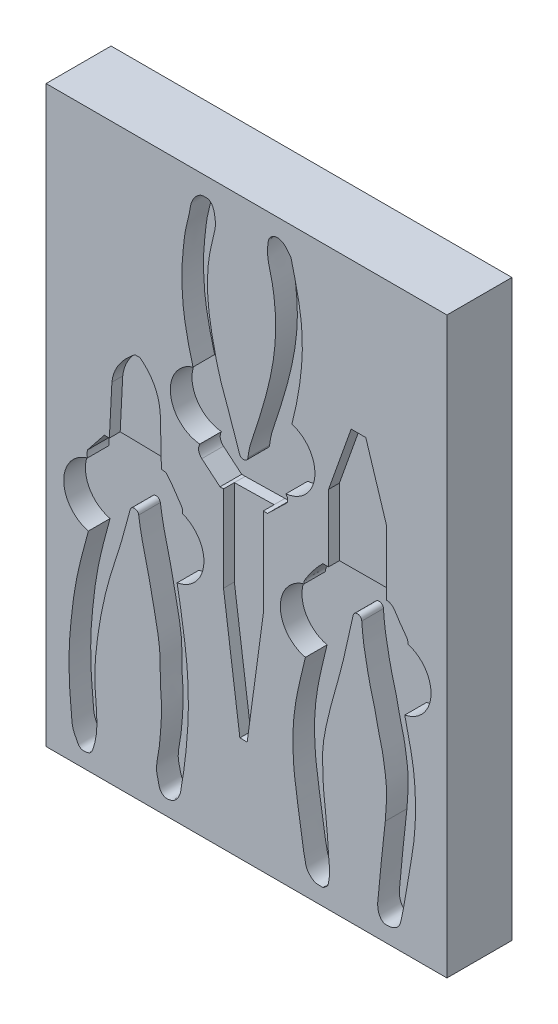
ISO-10303-21;
HEADER;
FILE_DESCRIPTION(('STEP AP214'),'2;1');
FILE_NAME('part.step','',(''),(''),'','','');
FILE_SCHEMA(('AUTOMOTIVE_DESIGN { 1 0 10303 214 1 1 1 1 }'));
ENDSEC;
DATA;
#1=APPLICATION_CONTEXT('core data for automotive mechanical design processes');
#2=APPLICATION_PROTOCOL_DEFINITION('international standard','automotive_design',2000,#1);
#3=PRODUCT_CONTEXT('',#1,'mechanical');
#4=PRODUCT('Part','Part','',(#3));
#5=PRODUCT_RELATED_PRODUCT_CATEGORY('part','',(#4));
#6=PRODUCT_DEFINITION_FORMATION('','',#4);
#7=PRODUCT_DEFINITION_CONTEXT('part definition',#1,'design');
#8=PRODUCT_DEFINITION('design','',#6,#7);
#9=PRODUCT_DEFINITION_SHAPE('','',#8);
#10=(LENGTH_UNIT() NAMED_UNIT(*) SI_UNIT(.MILLI.,.METRE.));
#11=(NAMED_UNIT(*) PLANE_ANGLE_UNIT() SI_UNIT($,.RADIAN.));
#12=(NAMED_UNIT(*) SI_UNIT($,.STERADIAN.) SOLID_ANGLE_UNIT());
#13=UNCERTAINTY_MEASURE_WITH_UNIT(LENGTH_MEASURE(1.E-05),#10,'distance_accuracy_value','');
#14=(GEOMETRIC_REPRESENTATION_CONTEXT(3) GLOBAL_UNCERTAINTY_ASSIGNED_CONTEXT((#13)) GLOBAL_UNIT_ASSIGNED_CONTEXT((#10,
#11,#12)) REPRESENTATION_CONTEXT('',''));
#15=CARTESIAN_POINT('',(0.,0.,0.));
#16=DIRECTION('',(0.,0.,1.));
#17=DIRECTION('',(1.,0.,0.));
#18=AXIS2_PLACEMENT_3D('',#15,#16,#17);
#19=CARTESIAN_POINT('',(-92.5,-132.5,30.));
#20=DIRECTION('',(1.,0.,0.));
#21=DIRECTION('',(0.,0.,-1.));
#22=AXIS2_PLACEMENT_3D('',#19,#20,#21);
#23=PLANE('',#22);
#24=DIRECTION('',(0.,-1.,0.));
#25=VECTOR('',#24,1.);
#26=CARTESIAN_POINT('',(-92.5,-132.5,0.));
#27=LINE('',#26,#25);
#28=CARTESIAN_POINT('',(-92.5,132.5,0.));
#29=VERTEX_POINT('',#28);
#30=CARTESIAN_POINT('',(-92.5,-132.5,0.));
#31=VERTEX_POINT('',#30);
#32=EDGE_CURVE('E784',#29,#31,#27,.T.);
#33=ORIENTED_EDGE('',*,*,#32,.T.);
#34=DIRECTION('',(0.,0.,-1.));
#35=VECTOR('',#34,1.);
#36=CARTESIAN_POINT('',(-92.5,-132.5,30.));
#37=LINE('',#36,#35);
#38=CARTESIAN_POINT('',(-92.5,-132.5,30.));
#39=VERTEX_POINT('',#38);
#40=EDGE_CURVE('E778',#39,#31,#37,.T.);
#41=ORIENTED_EDGE('',*,*,#40,.F.);
#42=DIRECTION('',(0.,-1.,0.));
#43=VECTOR('',#42,1.);
#44=CARTESIAN_POINT('',(-92.5,-132.5,30.));
#45=LINE('',#44,#43);
#46=CARTESIAN_POINT('',(-92.5,132.5,30.));
#47=VERTEX_POINT('',#46);
#48=EDGE_CURVE('E797',#47,#39,#45,.T.);
#49=ORIENTED_EDGE('',*,*,#48,.F.);
#50=DIRECTION('',(0.,0.,-1.));
#51=VECTOR('',#50,1.);
#52=CARTESIAN_POINT('',(-92.5,132.5,30.));
#53=LINE('',#52,#51);
#54=EDGE_CURVE('E801',#47,#29,#53,.T.);
#55=ORIENTED_EDGE('',*,*,#54,.T.);
#56=EDGE_LOOP('',(#33,#41,#49,#55));
#57=FACE_BOUND('',#56,.T.);
#58=ADVANCED_FACE('F38',(#57),#23,.F.);
#59=CARTESIAN_POINT('',(92.5,-132.5,30.));
#60=DIRECTION('',(0.,1.,0.));
#61=DIRECTION('',(-1.,0.,0.));
#62=AXIS2_PLACEMENT_3D('',#59,#60,#61);
#63=PLANE('',#62);
#64=DIRECTION('',(1.,0.,0.));
#65=VECTOR('',#64,1.);
#66=CARTESIAN_POINT('',(92.5,-132.5,0.));
#67=LINE('',#66,#65);
#68=CARTESIAN_POINT('',(92.5,-132.5,0.));
#69=VERTEX_POINT('',#68);
#70=EDGE_CURVE('E773',#31,#69,#67,.T.);
#71=ORIENTED_EDGE('',*,*,#70,.T.);
#72=DIRECTION('',(0.,0.,-1.));
#73=VECTOR('',#72,1.);
#74=CARTESIAN_POINT('',(92.5,-132.5,30.));
#75=LINE('',#74,#73);
#76=CARTESIAN_POINT('',(92.5,-132.5,30.));
#77=VERTEX_POINT('',#76);
#78=EDGE_CURVE('E775',#77,#69,#75,.T.);
#79=ORIENTED_EDGE('',*,*,#78,.F.);
#80=DIRECTION('',(1.,0.,0.));
#81=VECTOR('',#80,1.);
#82=CARTESIAN_POINT('',(92.5,-132.5,30.));
#83=LINE('',#82,#81);
#84=EDGE_CURVE('E1206',#39,#77,#83,.T.);
#85=ORIENTED_EDGE('',*,*,#84,.F.);
#86=ORIENTED_EDGE('',*,*,#40,.T.);
#87=EDGE_LOOP('',(#71,#79,#85,#86));
#88=FACE_BOUND('',#87,.T.);
#89=ADVANCED_FACE('F763',(#88),#63,.F.);
#90=CARTESIAN_POINT('',(92.5,-132.5,30.));
#91=DIRECTION('',(-1.,0.,0.));
#92=DIRECTION('',(0.,0.,1.));
#93=AXIS2_PLACEMENT_3D('',#90,#91,#92);
#94=PLANE('',#93);
#95=DIRECTION('',(0.,1.,0.));
#96=VECTOR('',#95,1.);
#97=CARTESIAN_POINT('',(92.5,-132.5,0.));
#98=LINE('',#97,#96);
#99=CARTESIAN_POINT('',(92.5,132.5,0.));
#100=VERTEX_POINT('',#99);
#101=EDGE_CURVE('E783',#69,#100,#98,.T.);
#102=ORIENTED_EDGE('',*,*,#101,.T.);
#103=DIRECTION('',(0.,0.,-1.));
#104=VECTOR('',#103,1.);
#105=CARTESIAN_POINT('',(92.5,132.5,30.));
#106=LINE('',#105,#104);
#107=CARTESIAN_POINT('',(92.5,132.5,30.));
#108=VERTEX_POINT('',#107);
#109=EDGE_CURVE('E790',#108,#100,#106,.T.);
#110=ORIENTED_EDGE('',*,*,#109,.F.);
#111=DIRECTION('',(0.,1.,0.));
#112=VECTOR('',#111,1.);
#113=CARTESIAN_POINT('',(92.5,-132.5,30.));
#114=LINE('',#113,#112);
#115=EDGE_CURVE('E788',#77,#108,#114,.T.);
#116=ORIENTED_EDGE('',*,*,#115,.F.);
#117=ORIENTED_EDGE('',*,*,#78,.T.);
#118=EDGE_LOOP('',(#102,#110,#116,#117));
#119=FACE_BOUND('',#118,.T.);
#120=ADVANCED_FACE('F760',(#119),#94,.F.);
#121=CARTESIAN_POINT('',(92.5,132.5,30.));
#122=DIRECTION('',(0.,-1.,0.));
#123=DIRECTION('',(1.,0.,0.));
#124=AXIS2_PLACEMENT_3D('',#121,#122,#123);
#125=PLANE('',#124);
#126=DIRECTION('',(-1.,0.,0.));
#127=VECTOR('',#126,1.);
#128=CARTESIAN_POINT('',(92.5,132.5,0.));
#129=LINE('',#128,#127);
#130=EDGE_CURVE('E793',#100,#29,#129,.T.);
#131=ORIENTED_EDGE('',*,*,#130,.T.);
#132=ORIENTED_EDGE('',*,*,#54,.F.);
#133=DIRECTION('',(-1.,0.,0.));
#134=VECTOR('',#133,1.);
#135=CARTESIAN_POINT('',(92.5,132.5,30.));
#136=LINE('',#135,#134);
#137=EDGE_CURVE('E805',#108,#47,#136,.T.);
#138=ORIENTED_EDGE('',*,*,#137,.F.);
#139=ORIENTED_EDGE('',*,*,#109,.T.);
#140=EDGE_LOOP('',(#131,#132,#138,#139));
#141=FACE_BOUND('',#140,.T.);
#142=ADVANCED_FACE('F752',(#141),#125,.F.);
#143=CARTESIAN_POINT('',(0.,0.,30.));
#144=DIRECTION('',(0.,0.,1.));
#145=DIRECTION('',(1.,0.,0.));
#146=AXIS2_PLACEMENT_3D('',#143,#144,#145);
#147=PLANE('',#146);
#148=DIRECTION('',(0.71734658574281,0.69671649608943,0.));
#149=VECTOR('',#148,1.);
#150=CARTESIAN_POINT('',(-1.1801952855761,1.21514140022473,30.));
#151=LINE('',#150,#149);
#152=CARTESIAN_POINT('',(9.69808842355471,11.7805777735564,30.));
#153=VERTEX_POINT('',#152);
#154=CARTESIAN_POINT('',(18.8567109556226,20.6758085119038,30.));
#155=VERTEX_POINT('',#154);
#156=EDGE_CURVE('E11',#153,#155,#151,.T.);
#157=ORIENTED_EDGE('',*,*,#156,.F.);
#158=DIRECTION('',(1.,0.,0.));
#159=VECTOR('',#158,1.);
#160=CARTESIAN_POINT('',(-1.23395002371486E-13,11.7805777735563,30.));
#161=LINE('',#160,#159);
#162=CARTESIAN_POINT('',(7.73265775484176,11.7805777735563,30.));
#163=VERTEX_POINT('',#162);
#164=EDGE_CURVE('E46',#163,#153,#161,.T.);
#165=ORIENTED_EDGE('',*,*,#164,.F.);
#166=DIRECTION('',(0.,1.,0.));
#167=VECTOR('',#166,1.);
#168=CARTESIAN_POINT('',(7.73265775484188,0.,30.));
#169=LINE('',#168,#167);
#170=CARTESIAN_POINT('',(7.73265775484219,-29.4280822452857,30.));
#171=VERTEX_POINT('',#170);
#172=EDGE_CURVE('E1038',#171,#163,#169,.T.);
#173=ORIENTED_EDGE('',*,*,#172,.F.);
#174=DIRECTION('',(0.133944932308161,0.990988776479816,0.));
#175=VECTOR('',#174,1.);
#176=CARTESIAN_POINT('',(11.5001468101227,-1.55439337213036,30.));
#177=LINE('',#176,#175);
#178=CARTESIAN_POINT('',(0.315279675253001,-84.3053986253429,30.));
#179=VERTEX_POINT('',#178);
#180=EDGE_CURVE('E1035',#179,#171,#177,.T.);
#181=ORIENTED_EDGE('',*,*,#180,.F.);
#182=DIRECTION('',(1.,0.,0.));
#183=VECTOR('',#182,1.);
#184=CARTESIAN_POINT('',(8.83052178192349E-13,-84.3053986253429,30.));
#185=LINE('',#184,#183);
#186=CARTESIAN_POINT('',(-3.06064450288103,-84.3053986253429,30.));
#187=VERTEX_POINT('',#186);
#188=EDGE_CURVE('E1032',#187,#179,#185,.T.);
#189=ORIENTED_EDGE('',*,*,#188,.F.);
#190=DIRECTION('',(0.133419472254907,-0.991059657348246,0.));
#191=VECTOR('',#190,1.);
#192=CARTESIAN_POINT('',(-14.153583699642,-1.90539858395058,30.));
#193=LINE('',#192,#191);
#194=CARTESIAN_POINT('',(-10.6027510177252,-28.2815111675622,30.));
#195=VERTEX_POINT('',#194);
#196=EDGE_CURVE('E1029',#195,#187,#193,.T.);
#197=ORIENTED_EDGE('',*,*,#196,.F.);
#198=DIRECTION('',(0.,-1.,0.));
#199=VECTOR('',#198,1.);
#200=CARTESIAN_POINT('',(-10.6027510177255,-1.11057921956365E-13,30.));
#201=LINE('',#200,#199);
#202=CARTESIAN_POINT('',(-10.6027510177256,11.450089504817,30.));
#203=VERTEX_POINT('',#202);
#204=EDGE_CURVE('E1026',#203,#195,#201,.T.);
#205=ORIENTED_EDGE('',*,*,#204,.F.);
#206=DIRECTION('',(1.,0.,0.));
#207=VECTOR('',#206,1.);
#208=CARTESIAN_POINT('',(-1.19933321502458E-13,11.4500895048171,30.));
#209=LINE('',#208,#207);
#210=CARTESIAN_POINT('',(-12.2227010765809,11.450089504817,30.));
#211=VERTEX_POINT('',#210);
#212=EDGE_CURVE('E1023',#211,#203,#209,.T.);
#213=ORIENTED_EDGE('',*,*,#212,.F.);
#214=DIRECTION('',(0.766117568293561,-0.642700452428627,0.));
#215=VECTOR('',#214,1.);
#216=CARTESIAN_POINT('',(0.58908587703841,0.702207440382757,30.));
#217=LINE('',#216,#215);
#218=CARTESIAN_POINT('',(-20.6265105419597,18.5000937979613,30.000000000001));
#219=VERTEX_POINT('',#218);
#220=EDGE_CURVE('E1017',#219,#211,#217,.T.);
#221=ORIENTED_EDGE('',*,*,#220,.F.);
#222=CARTESIAN_POINT('',(-3.24554676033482,29.1530324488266,30.0000000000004));
#223=CARTESIAN_POINT('',(-3.36777139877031,29.5435852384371,30.0000000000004));
#224=CARTESIAN_POINT('',(-3.98108050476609,31.4142051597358,30.0000000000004));
#225=CARTESIAN_POINT('',(-5.42771858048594,35.2859013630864,30.0000000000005));
#226=CARTESIAN_POINT('',(-7.02732984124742,40.5183821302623,30.0000000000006));
#227=CARTESIAN_POINT('',(-9.85239326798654,47.9590174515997,30.0000000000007));
#228=CARTESIAN_POINT('',(-12.660444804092,55.7813069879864,30.0000000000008));
#229=CARTESIAN_POINT('',(-14.9036669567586,65.4553679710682,30.0000000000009));
#230=CARTESIAN_POINT('',(-16.5192108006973,73.1673753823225,30.000000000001));
#231=CARTESIAN_POINT('',(-17.7138502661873,81.4682922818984,30.0000000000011));
#232=CARTESIAN_POINT('',(-18.1208975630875,88.4675787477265,30.0000000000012));
#233=CARTESIAN_POINT('',(-17.9046086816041,96.1385825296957,30.0000000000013));
#234=CARTESIAN_POINT('',(-16.914738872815,103.796288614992,30.0000000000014));
#235=CARTESIAN_POINT('',(-15.159641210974,110.006512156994,30.0000000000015));
#236=CARTESIAN_POINT('',(-14.2919487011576,114.445423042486,30.0000000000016));
#237=CARTESIAN_POINT('',(-14.3965367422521,117.162438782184,30.0000000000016));
#238=CARTESIAN_POINT('',(-14.8123987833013,119.936398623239,30.0000000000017));
#239=CARTESIAN_POINT('',(-15.7939705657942,122.495589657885,30.0000000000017));
#240=CARTESIAN_POINT('',(-17.2688620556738,123.730528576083,30.0000000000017));
#241=CARTESIAN_POINT('',(-18.9188500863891,123.878776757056,30.0000000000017));
#242=CARTESIAN_POINT('',(-20.7596517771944,123.901630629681,30.0000000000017));
#243=CARTESIAN_POINT('',(-22.9628602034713,122.512527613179,30.0000000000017));
#244=CARTESIAN_POINT('',(-24.7572072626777,120.249540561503,30.0000000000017));
#245=CARTESIAN_POINT('',(-25.8295879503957,117.571862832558,30.0000000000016));
#246=CARTESIAN_POINT('',(-26.1347979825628,114.82953551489,30.0000000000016));
#247=CARTESIAN_POINT('',(-26.7259617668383,112.229244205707,30.0000000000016));
#248=CARTESIAN_POINT('',(-27.3740327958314,109.220776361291,30.0000000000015));
#249=CARTESIAN_POINT('',(-28.3185740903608,105.85618696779,30.0000000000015));
#250=CARTESIAN_POINT('',(-28.8109199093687,101.466962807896,30.0000000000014));
#251=CARTESIAN_POINT('',(-29.4546978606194,95.6698374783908,30.0000000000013));
#252=CARTESIAN_POINT('',(-30.0045019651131,89.0285816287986,30.0000000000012));
#253=CARTESIAN_POINT('',(-29.7563241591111,82.139816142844,30.0000000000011));
#254=CARTESIAN_POINT('',(-29.304391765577,74.5954153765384,30.000000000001));
#255=CARTESIAN_POINT('',(-27.6793846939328,64.783774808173,30.0000000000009));
#256=CARTESIAN_POINT('',(-24.8375575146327,52.8895528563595,30.0000000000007));
#257=CARTESIAN_POINT('',(-21.5217459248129,42.9379672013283,30.0000000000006));
#258=CARTESIAN_POINT('',(-19.2292373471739,36.0088329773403,30.0000000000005));
#259=CARTESIAN_POINT('',(-19.1369995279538,31.7084030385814,30.0000000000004));
#260=CARTESIAN_POINT('',(-19.7639132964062,28.1492339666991,30.0000000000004));
#261=CARTESIAN_POINT('',(-20.8508342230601,25.1735741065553,30.0000000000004));
#262=CARTESIAN_POINT('',(-21.9633470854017,23.2296181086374,30.0000000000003));
#263=CARTESIAN_POINT('',(-22.3267639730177,20.7746913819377,30.0000000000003));
#264=CARTESIAN_POINT('',(-21.4361756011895,19.2505744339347,30.0000000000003));
#265=CARTESIAN_POINT('',(-20.6265105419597,18.5000937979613,30.0000000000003));
#266=B_SPLINE_CURVE_WITH_KNOTS('',3,(#222,#223,#224,#225,#226,#227,#228,#229,#230,#231,#232,
#233,#234,#235,#236,#237,#238,#239,#240,#241,#242,#243,#244,#245,#246,#247,#248,#249,#250,#251,
#252,#253,#254,#255,#256,#257,#258,#259,#260,#261,#262,#263,#264,#265),.UNSPECIFIED.,.F.,.F.,(4,
1,1,1,1,1,1,1,1,1,1,1,1,1,1,1,1,1,1,1,1,1,1,1,1,1,1,1,1,1,1,1,1,1,1,1,1,1,1,1,1,4),
(0.0666927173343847,0.0721112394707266,0.0927519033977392,0.121627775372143,0.144672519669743,
0.198434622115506,0.231751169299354,0.27642440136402,0.303019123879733,0.343035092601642,
0.369314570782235,0.404855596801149,0.445144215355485,0.455026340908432,0.464647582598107,
0.481051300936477,0.492169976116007,0.50047082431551,0.504660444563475,0.513931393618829,
0.524327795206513,0.537758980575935,0.551907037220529,0.561905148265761,0.574300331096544,
0.587283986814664,0.602777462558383,0.62060115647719,0.645778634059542,0.680302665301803,
0.708898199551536,0.737215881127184,0.780596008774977,0.840739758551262,0.89926068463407,
0.920214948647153,0.936982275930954,0.955760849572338,0.967889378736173,0.978912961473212,
0.985237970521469,1.),.UNSPECIFIED.);
#267=CARTESIAN_POINT('',(-21.5738377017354,23.8477774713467,30.));
#268=VERTEX_POINT('',#267);
#269=EDGE_CURVE('E1012',#268,#219,#266,.T.);
#270=ORIENTED_EDGE('',*,*,#269,.F.);
#271=CARTESIAN_POINT('',(-20.155572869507,38.7805777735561,30.));
#272=DIRECTION('',(0.,0.,1.));
#273=DIRECTION('',(1.,0.,0.));
#274=AXIS2_PLACEMENT_3D('',#271,#272,#273);
#275=CIRCLE('',#274,15.);
#276=CARTESIAN_POINT('',(-24.6892689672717,53.079025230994,30.));
#277=VERTEX_POINT('',#276);
#278=EDGE_CURVE('E1006',#277,#268,#275,.T.);
#279=ORIENTED_EDGE('',*,*,#278,.F.);
#280=CARTESIAN_POINT('',(-3.24554676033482,29.1530324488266,30.0000000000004));
#281=CARTESIAN_POINT('',(-3.36777139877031,29.5435852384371,30.0000000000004));
#282=CARTESIAN_POINT('',(-3.98108050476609,31.4142051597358,30.0000000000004));
#283=CARTESIAN_POINT('',(-5.42771858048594,35.2859013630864,30.0000000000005));
#284=CARTESIAN_POINT('',(-7.02732984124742,40.5183821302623,30.0000000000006));
#285=CARTESIAN_POINT('',(-9.85239326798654,47.9590174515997,30.0000000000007));
#286=CARTESIAN_POINT('',(-12.660444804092,55.7813069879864,30.0000000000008));
#287=CARTESIAN_POINT('',(-14.9036669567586,65.4553679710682,30.0000000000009));
#288=CARTESIAN_POINT('',(-16.5192108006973,73.1673753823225,30.000000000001));
#289=CARTESIAN_POINT('',(-17.7138502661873,81.4682922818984,30.0000000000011));
#290=CARTESIAN_POINT('',(-18.1208975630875,88.4675787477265,30.0000000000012));
#291=CARTESIAN_POINT('',(-17.9046086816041,96.1385825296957,30.0000000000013));
#292=CARTESIAN_POINT('',(-16.914738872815,103.796288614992,30.0000000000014));
#293=CARTESIAN_POINT('',(-15.159641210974,110.006512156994,30.0000000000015));
#294=CARTESIAN_POINT('',(-14.2919487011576,114.445423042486,30.0000000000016));
#295=CARTESIAN_POINT('',(-14.3965367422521,117.162438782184,30.0000000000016));
#296=CARTESIAN_POINT('',(-14.8123987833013,119.936398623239,30.0000000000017));
#297=CARTESIAN_POINT('',(-15.7939705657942,122.495589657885,30.0000000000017));
#298=CARTESIAN_POINT('',(-17.2688620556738,123.730528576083,30.0000000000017));
#299=CARTESIAN_POINT('',(-18.9188500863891,123.878776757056,30.0000000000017));
#300=CARTESIAN_POINT('',(-20.7596517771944,123.901630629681,30.0000000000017));
#301=CARTESIAN_POINT('',(-22.9628602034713,122.512527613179,30.0000000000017));
#302=CARTESIAN_POINT('',(-24.7572072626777,120.249540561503,30.0000000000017));
#303=CARTESIAN_POINT('',(-25.8295879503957,117.571862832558,30.0000000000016));
#304=CARTESIAN_POINT('',(-26.1347979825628,114.82953551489,30.0000000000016));
#305=CARTESIAN_POINT('',(-26.7259617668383,112.229244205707,30.0000000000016));
#306=CARTESIAN_POINT('',(-27.3740327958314,109.220776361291,30.0000000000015));
#307=CARTESIAN_POINT('',(-28.3185740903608,105.85618696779,30.0000000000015));
#308=CARTESIAN_POINT('',(-28.8109199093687,101.466962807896,30.0000000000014));
#309=CARTESIAN_POINT('',(-29.4546978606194,95.6698374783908,30.0000000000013));
#310=CARTESIAN_POINT('',(-30.0045019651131,89.0285816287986,30.0000000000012));
#311=CARTESIAN_POINT('',(-29.7563241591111,82.139816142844,30.0000000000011));
#312=CARTESIAN_POINT('',(-29.304391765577,74.5954153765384,30.000000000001));
#313=CARTESIAN_POINT('',(-27.6793846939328,64.783774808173,30.0000000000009));
#314=CARTESIAN_POINT('',(-24.8375575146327,52.8895528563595,30.0000000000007));
#315=CARTESIAN_POINT('',(-21.5217459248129,42.9379672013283,30.0000000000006));
#316=CARTESIAN_POINT('',(-19.2292373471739,36.0088329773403,30.0000000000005));
#317=CARTESIAN_POINT('',(-19.1369995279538,31.7084030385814,30.0000000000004));
#318=CARTESIAN_POINT('',(-19.7639132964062,28.1492339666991,30.0000000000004));
#319=CARTESIAN_POINT('',(-20.8508342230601,25.1735741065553,30.0000000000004));
#320=CARTESIAN_POINT('',(-21.9633470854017,23.2296181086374,30.0000000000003));
#321=CARTESIAN_POINT('',(-22.3267639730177,20.7746913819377,30.0000000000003));
#322=CARTESIAN_POINT('',(-21.4361756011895,19.2505744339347,30.0000000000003));
#323=CARTESIAN_POINT('',(-20.6265105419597,18.5000937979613,30.0000000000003));
#324=B_SPLINE_CURVE_WITH_KNOTS('',3,(#280,#281,#282,#283,#284,#285,#286,#287,#288,#289,#290,
#291,#292,#293,#294,#295,#296,#297,#298,#299,#300,#301,#302,#303,#304,#305,#306,#307,#308,#309,
#310,#311,#312,#313,#314,#315,#316,#317,#318,#319,#320,#321,#322,#323),.UNSPECIFIED.,.F.,.F.,(4,
1,1,1,1,1,1,1,1,1,1,1,1,1,1,1,1,1,1,1,1,1,1,1,1,1,1,1,1,1,1,1,1,1,1,1,1,1,1,1,1,4),
(0.0666927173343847,0.0721112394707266,0.0927519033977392,0.121627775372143,0.144672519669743,
0.198434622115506,0.231751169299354,0.27642440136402,0.303019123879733,0.343035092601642,
0.369314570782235,0.404855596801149,0.445144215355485,0.455026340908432,0.464647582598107,
0.481051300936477,0.492169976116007,0.50047082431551,0.504660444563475,0.513931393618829,
0.524327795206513,0.537758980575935,0.551907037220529,0.561905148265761,0.574300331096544,
0.587283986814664,0.602777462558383,0.62060115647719,0.645778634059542,0.680302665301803,
0.708898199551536,0.737215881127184,0.780596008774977,0.840739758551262,0.89926068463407,
0.920214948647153,0.936982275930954,0.955760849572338,0.967889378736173,0.978912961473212,
0.985237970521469,1.),.UNSPECIFIED.);
#325=CARTESIAN_POINT('',(-3.24554676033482,29.1530324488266,30.));
#326=VERTEX_POINT('',#325);
#327=EDGE_CURVE('E1001',#326,#277,#324,.T.);
#328=ORIENTED_EDGE('',*,*,#327,.F.);
#329=CARTESIAN_POINT('',(-1.33683308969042,29.7503699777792,30.));
#330=DIRECTION('',(0.,0.,1.));
#331=DIRECTION('',(1.,0.,0.));
#332=AXIS2_PLACEMENT_3D('',#329,#330,#331);
#333=CIRCLE('',#332,2.);
#334=CARTESIAN_POINT('',(0.64692799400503,29.4960238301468,30.));
#335=VERTEX_POINT('',#334);
#336=EDGE_CURVE('E992',#335,#326,#333,.F.);
#337=ORIENTED_EDGE('',*,*,#336,.F.);
#338=CARTESIAN_POINT('',(20.4943922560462,119.578554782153,30.0000000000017));
#339=CARTESIAN_POINT('',(19.2688201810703,121.068201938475,30.0000000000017));
#340=CARTESIAN_POINT('',(17.4333952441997,124.074887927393,30.0000000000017));
#341=CARTESIAN_POINT('',(12.5742693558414,124.580928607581,30.0000000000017));
#342=CARTESIAN_POINT('',(10.1497776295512,122.077063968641,30.0000000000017));
#343=CARTESIAN_POINT('',(9.85020214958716,119.355097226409,30.0000000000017));
#344=CARTESIAN_POINT('',(9.62505103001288,116.835203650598,30.0000000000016));
#345=CARTESIAN_POINT('',(9.79127276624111,113.839465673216,30.0000000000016));
#346=CARTESIAN_POINT('',(10.6167734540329,110.314857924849,30.0000000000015));
#347=CARTESIAN_POINT('',(11.512543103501,106.688841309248,30.0000000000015));
#348=CARTESIAN_POINT('',(12.4090136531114,102.493882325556,30.0000000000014));
#349=CARTESIAN_POINT('',(12.8668716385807,98.5485251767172,30.0000000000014));
#350=CARTESIAN_POINT('',(13.3524010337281,94.1177574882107,30.0000000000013));
#351=CARTESIAN_POINT('',(13.5139707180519,89.3168652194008,30.0000000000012));
#352=CARTESIAN_POINT('',(13.4085517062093,83.1358854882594,30.0000000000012));
#353=CARTESIAN_POINT('',(12.7133842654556,76.0867360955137,30.0000000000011));
#354=CARTESIAN_POINT('',(11.0693862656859,66.6262533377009,30.0000000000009));
#355=CARTESIAN_POINT('',(8.60246402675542,56.8527680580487,30.0000000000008));
#356=CARTESIAN_POINT('',(5.7878392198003,47.6117333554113,30.0000000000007));
#357=CARTESIAN_POINT('',(3.38768750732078,40.2884594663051,30.0000000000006));
#358=CARTESIAN_POINT('',(1.40044948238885,34.597507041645,30.0000000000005));
#359=CARTESIAN_POINT('',(0.813050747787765,30.7916906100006,30.0000000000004));
#360=CARTESIAN_POINT('',(0.646927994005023,29.4960238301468,30.0000000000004));
#361=B_SPLINE_CURVE_WITH_KNOTS('',3,(#338,#339,#340,#341,#342,#343,#344,#345,#346,#347,#348,
#349,#350,#351,#352,#353,#354,#355,#356,#357,#358,#359,#360),.UNSPECIFIED.,.F.,.F.,(4,1,1,1,1,1,
1,1,1,1,1,1,1,1,1,1,1,1,1,1,4),(0.,0.0494547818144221,0.0771613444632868,0.107433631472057,
0.122865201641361,0.143705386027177,0.169550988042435,0.19589094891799,0.232278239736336,
0.261148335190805,0.300925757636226,0.329534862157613,0.370371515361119,0.418537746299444,
0.480962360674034,0.543734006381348,0.653720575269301,0.727747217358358,0.780389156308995,
0.842788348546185,0.874758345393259),.UNSPECIFIED.);
#362=CARTESIAN_POINT('',(20.4943922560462,119.578554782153,30.000000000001));
#363=VERTEX_POINT('',#362);
#364=EDGE_CURVE('E976',#363,#335,#361,.T.);
#365=ORIENTED_EDGE('',*,*,#364,.F.);
#366=CARTESIAN_POINT('',(18.8567109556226,22.8461793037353,30.0000000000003));
#367=CARTESIAN_POINT('',(17.50952699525,24.666670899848,30.0000000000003));
#368=CARTESIAN_POINT('',(16.5548215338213,28.1644923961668,30.0000000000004));
#369=CARTESIAN_POINT('',(15.7327109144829,33.0851092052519,30.0000000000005));
#370=CARTESIAN_POINT('',(16.1523048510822,38.044342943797,30.0000000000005));
#371=CARTESIAN_POINT('',(19.9465999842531,48.3629086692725,30.0000000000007));
#372=CARTESIAN_POINT('',(23.3944211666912,62.4612161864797,30.0000000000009));
#373=CARTESIAN_POINT('',(25.9369305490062,80.0085800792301,30.0000000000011));
#374=CARTESIAN_POINT('',(25.8014469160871,98.5709765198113,30.0000000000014));
#375=CARTESIAN_POINT('',(22.4247518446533,111.735840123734,30.0000000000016));
#376=CARTESIAN_POINT('',(20.4943922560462,119.578554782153,30.0000000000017));
#377=B_SPLINE_CURVE_WITH_KNOTS('',3,(#366,#367,#368,#369,#370,#371,#372,#373,#374,#375,#376),
.UNSPECIFIED.,.F.,.F.,(4,1,1,1,1,1,1,1,4),(0.,0.0678823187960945,0.108026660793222,
0.151230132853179,0.216928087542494,0.440346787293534,0.590776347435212,0.754259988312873,1.),.UNSPECIFIED.);
#378=CARTESIAN_POINT('',(20.9640419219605,53.1273416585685,30.));
#379=VERTEX_POINT('',#378);
#380=EDGE_CURVE('E971',#379,#363,#377,.T.);
#381=ORIENTED_EDGE('',*,*,#380,.F.);
#382=CARTESIAN_POINT('',(16.585644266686,38.7805777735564,30.));
#383=DIRECTION('',(0.,0.,1.));
#384=DIRECTION('',(1.,0.,0.));
#385=AXIS2_PLACEMENT_3D('',#382,#383,#384);
#386=CIRCLE('',#385,15.);
#387=CARTESIAN_POINT('',(18.1963592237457,23.8673086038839,30.));
#388=VERTEX_POINT('',#387);
#389=EDGE_CURVE('E968',#388,#379,#386,.T.);
#390=ORIENTED_EDGE('',*,*,#389,.F.);
#391=CARTESIAN_POINT('',(18.8567109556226,22.8461793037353,30.0000000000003));
#392=CARTESIAN_POINT('',(17.50952699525,24.666670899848,30.0000000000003));
#393=CARTESIAN_POINT('',(16.5548215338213,28.1644923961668,30.0000000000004));
#394=CARTESIAN_POINT('',(15.7327109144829,33.0851092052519,30.0000000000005));
#395=CARTESIAN_POINT('',(16.1523048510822,38.044342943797,30.0000000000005));
#396=CARTESIAN_POINT('',(19.9465999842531,48.3629086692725,30.0000000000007));
#397=CARTESIAN_POINT('',(23.3944211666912,62.4612161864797,30.0000000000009));
#398=CARTESIAN_POINT('',(25.9369305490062,80.0085800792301,30.0000000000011));
#399=CARTESIAN_POINT('',(25.8014469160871,98.5709765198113,30.0000000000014));
#400=CARTESIAN_POINT('',(22.4247518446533,111.735840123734,30.0000000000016));
#401=CARTESIAN_POINT('',(20.4943922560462,119.578554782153,30.0000000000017));
#402=B_SPLINE_CURVE_WITH_KNOTS('',3,(#391,#392,#393,#394,#395,#396,#397,#398,#399,#400,#401),
.UNSPECIFIED.,.F.,.F.,(4,1,1,1,1,1,1,1,4),(0.,0.0678823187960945,0.108026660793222,
0.151230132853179,0.216928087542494,0.440346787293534,0.590776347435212,0.754259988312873,1.),.UNSPECIFIED.);
#403=CARTESIAN_POINT('',(18.8567109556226,22.8461793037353,30.));
#404=VERTEX_POINT('',#403);
#405=EDGE_CURVE('E984',#404,#388,#402,.T.);
#406=ORIENTED_EDGE('',*,*,#405,.F.);
#407=DIRECTION('',(0.,1.,0.));
#408=VECTOR('',#407,1.);
#409=CARTESIAN_POINT('',(18.8567109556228,1.97513563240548E-13,30.));
#410=LINE('',#409,#408);
#411=EDGE_CURVE('E998',#155,#404,#410,.T.);
#412=ORIENTED_EDGE('',*,*,#411,.F.);
#413=EDGE_LOOP('',(#157,#165,#173,#181,#189,#197,#205,#213,#221,#270,#279,#328,#337,#365,#381,
#390,#406,#412));
#414=FACE_BOUND('',#413,.T.);
#415=DIRECTION('',(-0.300535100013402,0.953770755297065,0.));
#416=VECTOR('',#415,1.);
#417=CARTESIAN_POINT('',(68.6551916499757,21.6333901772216,30.));
#418=LINE('',#417,#416);
#419=CARTESIAN_POINT('',(64.5020885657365,34.8135753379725,30.));
#420=VERTEX_POINT('',#419);
#421=CARTESIAN_POINT('',(55.0547004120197,64.7955725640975,30.));
#422=VERTEX_POINT('',#421);
#423=EDGE_CURVE('E965',#420,#422,#418,.T.);
#424=ORIENTED_EDGE('',*,*,#423,.F.);
#425=DIRECTION('',(0.,1.,0.));
#426=VECTOR('',#425,1.);
#427=CARTESIAN_POINT('',(64.5020885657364,-2.25207838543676E-13,30.));
#428=LINE('',#427,#426);
#429=CARTESIAN_POINT('',(64.5020885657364,4.60284674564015,30.));
#430=VERTEX_POINT('',#429);
#431=EDGE_CURVE('E932',#430,#420,#428,.T.);
#432=ORIENTED_EDGE('',*,*,#431,.F.);
#433=CARTESIAN_POINT('',(64.5020885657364,4.60284674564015,29.9999999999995));
#434=CARTESIAN_POINT('',(67.7087405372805,4.61560057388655,29.9999999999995));
#435=CARTESIAN_POINT('',(69.5570041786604,0.0213751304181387,29.9999999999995));
#436=CARTESIAN_POINT('',(72.7494720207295,-3.89158890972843,29.9999999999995));
#437=CARTESIAN_POINT('',(74.3699385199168,-6.22736912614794,29.9999999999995));
#438=CARTESIAN_POINT('',(74.8181817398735,-8.36339081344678,29.9999999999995));
#439=CARTESIAN_POINT('',(73.5553101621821,-10.3625313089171,29.9999999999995));
#440=CARTESIAN_POINT('',(72.2069988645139,-12.5263142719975,29.9999999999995));
#441=CARTESIAN_POINT('',(70.9359155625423,-16.1450852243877,29.9999999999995));
#442=CARTESIAN_POINT('',(69.8959794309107,-19.8816264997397,29.9999999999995));
#443=CARTESIAN_POINT('',(70.3342969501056,-24.3327888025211,29.9999999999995));
#444=CARTESIAN_POINT('',(71.380378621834,-28.7028183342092,29.9999999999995));
#445=CARTESIAN_POINT('',(72.6191904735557,-35.58455742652,29.9999999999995));
#446=CARTESIAN_POINT('',(74.9709514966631,-45.1876223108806,29.9999999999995));
#447=CARTESIAN_POINT('',(77.3155814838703,-56.7105965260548,29.9999999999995));
#448=CARTESIAN_POINT('',(78.0698526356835,-67.5921404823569,29.9999999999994));
#449=CARTESIAN_POINT('',(78.0215917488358,-77.6903849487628,29.9999999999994));
#450=CARTESIAN_POINT('',(77.14289178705,-87.8057672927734,29.9999999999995));
#451=CARTESIAN_POINT('',(74.4334679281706,-102.221103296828,29.9999999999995));
#452=CARTESIAN_POINT('',(72.900097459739,-113.206076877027,29.9999999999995));
#453=CARTESIAN_POINT('',(71.2555476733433,-120.384891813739,29.9999999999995));
#454=B_SPLINE_CURVE_WITH_KNOTS('',3,(#433,#434,#435,#436,#437,#438,#439,#440,#441,#442,#443,
#444,#445,#446,#447,#448,#449,#450,#451,#452,#453),.UNSPECIFIED.,.F.,.F.,(4,1,1,1,1,1,1,1,1,1,1,
1,1,1,1,1,1,1,4),(0.,0.0657344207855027,0.0956229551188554,0.117945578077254,0.130262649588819,
0.142338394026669,0.169682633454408,0.189239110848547,0.229570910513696,0.256902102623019,
0.290240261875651,0.332346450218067,0.416488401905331,0.516135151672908,0.600455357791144,
0.665103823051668,0.746721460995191,0.83194070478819,1.),.UNSPECIFIED.);
#455=CARTESIAN_POINT('',(74.6381892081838,-8.07724289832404,30.));
#456=VERTEX_POINT('',#455);
#457=EDGE_CURVE('E910',#456,#430,#454,.F.);
#458=ORIENTED_EDGE('',*,*,#457,.F.);
#459=CARTESIAN_POINT('',(70.1727477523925,-22.3971532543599,30.));
#460=DIRECTION('',(0.,0.,1.));
#461=DIRECTION('',(1.,0.,0.));
#462=AXIS2_PLACEMENT_3D('',#459,#460,#461);
#463=CIRCLE('',#462,15.);
#464=CARTESIAN_POINT('',(73.0444988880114,-37.1196885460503,30.));
#465=VERTEX_POINT('',#464);
#466=EDGE_CURVE('E894',#465,#456,#463,.T.);
#467=ORIENTED_EDGE('',*,*,#466,.F.);
#468=CARTESIAN_POINT('',(64.5020885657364,4.60284674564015,29.9999999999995));
#469=CARTESIAN_POINT('',(67.7087405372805,4.61560057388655,29.9999999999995));
#470=CARTESIAN_POINT('',(69.5570041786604,0.0213751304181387,29.9999999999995));
#471=CARTESIAN_POINT('',(72.7494720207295,-3.89158890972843,29.9999999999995));
#472=CARTESIAN_POINT('',(74.3699385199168,-6.22736912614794,29.9999999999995));
#473=CARTESIAN_POINT('',(74.8181817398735,-8.36339081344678,29.9999999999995));
#474=CARTESIAN_POINT('',(73.5553101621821,-10.3625313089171,29.9999999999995));
#475=CARTESIAN_POINT('',(72.2069988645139,-12.5263142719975,29.9999999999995));
#476=CARTESIAN_POINT('',(70.9359155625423,-16.1450852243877,29.9999999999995));
#477=CARTESIAN_POINT('',(69.8959794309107,-19.8816264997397,29.9999999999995));
#478=CARTESIAN_POINT('',(70.3342969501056,-24.3327888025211,29.9999999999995));
#479=CARTESIAN_POINT('',(71.380378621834,-28.7028183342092,29.9999999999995));
#480=CARTESIAN_POINT('',(72.6191904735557,-35.58455742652,29.9999999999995));
#481=CARTESIAN_POINT('',(74.9709514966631,-45.1876223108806,29.9999999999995));
#482=CARTESIAN_POINT('',(77.3155814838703,-56.7105965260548,29.9999999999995));
#483=CARTESIAN_POINT('',(78.0698526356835,-67.5921404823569,29.9999999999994));
#484=CARTESIAN_POINT('',(78.0215917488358,-77.6903849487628,29.9999999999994));
#485=CARTESIAN_POINT('',(77.14289178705,-87.8057672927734,29.9999999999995));
#486=CARTESIAN_POINT('',(74.4334679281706,-102.221103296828,29.9999999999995));
#487=CARTESIAN_POINT('',(72.900097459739,-113.206076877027,29.9999999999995));
#488=CARTESIAN_POINT('',(71.2555476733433,-120.384891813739,29.9999999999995));
#489=B_SPLINE_CURVE_WITH_KNOTS('',3,(#468,#469,#470,#471,#472,#473,#474,#475,#476,#477,#478,
#479,#480,#481,#482,#483,#484,#485,#486,#487,#488),.UNSPECIFIED.,.F.,.F.,(4,1,1,1,1,1,1,1,1,1,1,
1,1,1,1,1,1,1,4),(0.,0.0657344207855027,0.0956229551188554,0.117945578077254,0.130262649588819,
0.142338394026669,0.169682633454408,0.189239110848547,0.229570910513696,0.256902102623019,
0.290240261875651,0.332346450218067,0.416488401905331,0.516135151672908,0.600455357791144,
0.665103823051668,0.746721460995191,0.83194070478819,1.),.UNSPECIFIED.);
#490=CARTESIAN_POINT('',(71.2555476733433,-120.384891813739,29.9999999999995));
#491=VERTEX_POINT('',#490);
#492=EDGE_CURVE('E897',#491,#465,#489,.F.);
#493=ORIENTED_EDGE('',*,*,#492,.F.);
#494=CARTESIAN_POINT('',(71.2555476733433,-120.384891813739,29.9999999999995));
#495=CARTESIAN_POINT('',(70.6793089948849,-123.550950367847,29.9999999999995));
#496=CARTESIAN_POINT('',(67.6744444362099,-125.330742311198,29.9999999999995));
#497=CARTESIAN_POINT('',(62.9205461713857,-125.337483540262,29.9999999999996));
#498=CARTESIAN_POINT('',(60.8602255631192,-122.54322429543,29.9999999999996));
#499=CARTESIAN_POINT('',(60.3625455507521,-119.023570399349,29.9999999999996));
#500=CARTESIAN_POINT('',(61.0055444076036,-114.247832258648,29.9999999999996));
#501=CARTESIAN_POINT('',(61.5735324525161,-108.491916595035,29.9999999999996));
#502=CARTESIAN_POINT('',(62.3934700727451,-98.0979298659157,29.9999999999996));
#503=CARTESIAN_POINT('',(63.5615369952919,-89.9786328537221,29.9999999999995));
#504=CARTESIAN_POINT('',(64.0381066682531,-84.0862367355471,29.9999999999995));
#505=B_SPLINE_CURVE_WITH_KNOTS('',3,(#494,#495,#496,#497,#498,#499,#500,#501,#502,#503,#504),
.UNSPECIFIED.,.F.,.F.,(4,1,1,1,1,1,1,1,4),(0.,0.145165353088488,0.198688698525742,
0.251789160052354,0.326547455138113,0.400122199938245,0.528133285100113,0.659838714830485,1.),.UNSPECIFIED.);
#506=CARTESIAN_POINT('',(64.0381066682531,-84.0862367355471,29.9999999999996));
#507=VERTEX_POINT('',#506);
#508=EDGE_CURVE('E902',#507,#491,#505,.F.);
#509=ORIENTED_EDGE('',*,*,#508,.F.);
#510=CARTESIAN_POINT('',(64.0381066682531,-84.0862367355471,29.9999999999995));
#511=CARTESIAN_POINT('',(64.4883054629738,-78.6634557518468,29.9999999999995));
#512=CARTESIAN_POINT('',(65.0963526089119,-71.5119498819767,29.9999999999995));
#513=CARTESIAN_POINT('',(63.6159128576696,-62.4970049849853,29.9999999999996));
#514=CARTESIAN_POINT('',(62.892137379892,-56.9145744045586,29.9999999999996));
#515=CARTESIAN_POINT('',(60.9239293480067,-50.0949187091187,29.9999999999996));
#516=CARTESIAN_POINT('',(59.3184264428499,-41.1102642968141,29.9999999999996));
#517=CARTESIAN_POINT('',(56.3640389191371,-31.5174862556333,29.9999999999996));
#518=CARTESIAN_POINT('',(54.4378034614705,-19.4353655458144,29.9999999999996));
#519=CARTESIAN_POINT('',(54.1007616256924,-18.9617702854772,29.9999999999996));
#520=CARTESIAN_POINT('',(53.2279586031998,-10.5294513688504,29.9999999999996));
#521=CARTESIAN_POINT('',(53.1939524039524,-9.49977649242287,29.9999999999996));
#522=B_SPLINE_CURVE_WITH_KNOTS('',3,(#510,#511,#512,#513,#514,#515,#516,#517,#518,#519,#520,
#521),.UNSPECIFIED.,.F.,.F.,(4,1,1,1,1,1,1,1,1,4),(0.127697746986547,0.317111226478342,
0.37139112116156,0.443085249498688,0.511076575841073,0.616787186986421,0.753467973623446,
0.879858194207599,0.964426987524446,1.),.UNSPECIFIED.);
#523=CARTESIAN_POINT('',(53.1939524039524,-9.49977649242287,29.9999999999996));
#524=VERTEX_POINT('',#523);
#525=EDGE_CURVE('E918',#524,#507,#522,.F.);
#526=ORIENTED_EDGE('',*,*,#525,.F.);
#527=CARTESIAN_POINT('',(51.1950422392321,-9.56579280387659,30.));
#528=DIRECTION('',(0.,0.,1.));
#529=DIRECTION('',(1.,0.,0.));
#530=AXIS2_PLACEMENT_3D('',#527,#528,#529);
#531=CIRCLE('',#530,2.);
#532=CARTESIAN_POINT('',(49.231648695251,-9.18489151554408,30.));
#533=VERTEX_POINT('',#532);
#534=EDGE_CURVE('E926',#533,#524,#531,.F.);
#535=ORIENTED_EDGE('',*,*,#534,.F.);
#536=CARTESIAN_POINT('',(49.231648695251,-9.18489151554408,29.9999999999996));
#537=CARTESIAN_POINT('',(48.6956440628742,-11.9477806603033,29.9999999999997));
#538=CARTESIAN_POINT('',(47.3662263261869,-17.092012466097,29.9999999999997));
#539=CARTESIAN_POINT('',(45.6008111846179,-25.5425923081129,29.9999999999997));
#540=CARTESIAN_POINT('',(43.4367113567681,-34.6205082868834,29.9999999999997));
#541=CARTESIAN_POINT('',(40.0417344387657,-46.1530847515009,29.9999999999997));
#542=CARTESIAN_POINT('',(37.3312106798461,-56.5561087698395,29.9999999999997));
#543=CARTESIAN_POINT('',(35.4900763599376,-65.8934504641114,29.9999999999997));
#544=CARTESIAN_POINT('',(34.9812440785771,-71.8389483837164,29.9999999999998));
#545=CARTESIAN_POINT('',(35.2712216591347,-77.5659513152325,29.9999999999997));
#546=CARTESIAN_POINT('',(35.3338192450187,-83.8249881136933,29.9999999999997));
#547=CARTESIAN_POINT('',(36.2016176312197,-92.0342433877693,29.9999999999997));
#548=CARTESIAN_POINT('',(37.4671265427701,-102.35927064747,29.9999999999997));
#549=CARTESIAN_POINT('',(37.779866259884,-111.269013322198,29.9999999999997));
#550=CARTESIAN_POINT('',(38.5904724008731,-117.830026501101,29.9999999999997));
#551=CARTESIAN_POINT('',(37.9632729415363,-120.84764532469,29.9999999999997));
#552=CARTESIAN_POINT('',(37.6130896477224,-123.243989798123,29.9999999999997));
#553=CARTESIAN_POINT('',(36.3188702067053,-124.114085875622,29.9999999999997));
#554=CARTESIAN_POINT('',(35.4280253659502,-125.028835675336,29.9999999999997));
#555=CARTESIAN_POINT('',(34.3188096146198,-124.879451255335,29.9999999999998));
#556=CARTESIAN_POINT('',(33.1817485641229,-124.965947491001,29.9999999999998));
#557=CARTESIAN_POINT('',(31.4881872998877,-124.766267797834,29.9999999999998));
#558=CARTESIAN_POINT('',(29.3652166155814,-123.320070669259,29.9999999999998));
#559=CARTESIAN_POINT('',(27.6917882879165,-121.267251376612,29.9999999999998));
#560=CARTESIAN_POINT('',(27.1050965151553,-118.572855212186,29.9999999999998));
#561=CARTESIAN_POINT('',(26.5363188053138,-116.009353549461,29.9999999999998));
#562=CARTESIAN_POINT('',(26.0518654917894,-112.645228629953,29.9999999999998));
#563=CARTESIAN_POINT('',(25.4486783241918,-108.684459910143,29.9999999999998));
#564=CARTESIAN_POINT('',(24.6842031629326,-104.239192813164,29.9999999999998));
#565=CARTESIAN_POINT('',(23.848123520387,-99.0652929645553,29.9999999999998));
#566=CARTESIAN_POINT('',(23.0569972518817,-92.6197938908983,29.9999999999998));
#567=CARTESIAN_POINT('',(21.9463754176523,-85.8407437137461,29.9999999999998));
#568=CARTESIAN_POINT('',(21.448804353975,-77.6589042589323,29.9999999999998));
#569=CARTESIAN_POINT('',(21.3054408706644,-69.4516200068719,29.9999999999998));
#570=CARTESIAN_POINT('',(22.3063294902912,-57.7040704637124,29.9999999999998));
#571=CARTESIAN_POINT('',(25.1029039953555,-45.6294880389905,29.9999999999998));
#572=CARTESIAN_POINT('',(27.8217063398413,-34.2785346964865,29.9999999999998));
#573=CARTESIAN_POINT('',(29.6609225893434,-27.100224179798,29.9999999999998));
#574=CARTESIAN_POINT('',(30.717840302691,-22.4763847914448,29.9999999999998));
#575=CARTESIAN_POINT('',(30.905106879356,-18.430318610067,29.9999999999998));
#576=CARTESIAN_POINT('',(29.8163460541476,-15.0134140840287,29.9999999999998));
#577=CARTESIAN_POINT('',(28.5368600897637,-11.7354977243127,29.9999999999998));
#578=CARTESIAN_POINT('',(26.962119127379,-9.56111292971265,29.9999999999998));
#579=CARTESIAN_POINT('',(26.3045316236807,-7.05670142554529,29.9999999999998));
#580=CARTESIAN_POINT('',(27.4205621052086,-5.34749459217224,29.9999999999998));
#581=CARTESIAN_POINT('',(30.0237049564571,-1.35065769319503,29.9999999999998));
#582=CARTESIAN_POINT('',(32.7631790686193,2.06256364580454,29.9999999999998));
#583=CARTESIAN_POINT('',(35.2299684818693,4.49989068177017,29.9999999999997));
#584=B_SPLINE_CURVE_WITH_KNOTS('',3,(#536,#537,#538,#539,#540,#541,#542,#543,#544,#545,#546,
#547,#548,#549,#550,#551,#552,#553,#554,#555,#556,#557,#558,#559,#560,#561,#562,#563,#564,#565,
#566,#567,#568,#569,#570,#571,#572,#573,#574,#575,#576,#577,#578,#579,#580,#581,#582,#583),
.UNSPECIFIED.,.F.,.F.,(4,1,1,1,1,1,1,1,1,1,1,1,1,1,1,1,1,1,1,1,1,1,1,1,1,1,1,1,1,1,1,1,1,1,1,1,
1,1,1,1,1,1,1,1,1,4),(0.0399755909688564,0.0713070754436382,0.0992250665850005,
0.136194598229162,0.175306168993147,0.23323337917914,0.255959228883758,0.28135673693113,
0.299480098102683,0.319845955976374,0.351100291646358,0.391447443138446,0.435595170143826,
0.451025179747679,0.464050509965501,0.470512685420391,0.476394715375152,0.480932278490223,
0.48362881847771,0.488248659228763,0.493852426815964,0.502141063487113,0.516248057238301,
0.52199309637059,0.532673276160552,0.545582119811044,0.559835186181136,0.577350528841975,
0.595860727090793,0.618253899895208,0.649744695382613,0.672360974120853,0.709566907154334,
0.741168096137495,0.803525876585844,0.847391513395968,0.871365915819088,0.886107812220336,
0.900290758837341,0.91581910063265,0.925679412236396,0.939304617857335,0.945950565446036,
0.952609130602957,0.96079100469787,1.),.UNSPECIFIED.);
#585=CARTESIAN_POINT('',(27.1801331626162,-36.999526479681,30.));
#586=VERTEX_POINT('',#585);
#587=EDGE_CURVE('E935',#586,#533,#584,.F.);
#588=ORIENTED_EDGE('',*,*,#587,.F.);
#589=CARTESIAN_POINT('',(30.6109779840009,-22.3971532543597,30.));
#590=DIRECTION('',(0.,0.,1.));
#591=DIRECTION('',(1.,0.,0.));
#592=AXIS2_PLACEMENT_3D('',#589,#590,#591);
#593=CIRCLE('',#592,15.);
#594=CARTESIAN_POINT('',(26.5808052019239,-7.94870325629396,30.));
#595=VERTEX_POINT('',#594);
#596=EDGE_CURVE('E940',#595,#586,#593,.T.);
#597=ORIENTED_EDGE('',*,*,#596,.F.);
#598=CARTESIAN_POINT('',(49.231648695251,-9.18489151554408,29.9999999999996));
#599=CARTESIAN_POINT('',(48.6956440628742,-11.9477806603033,29.9999999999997));
#600=CARTESIAN_POINT('',(47.3662263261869,-17.092012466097,29.9999999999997));
#601=CARTESIAN_POINT('',(45.6008111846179,-25.5425923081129,29.9999999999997));
#602=CARTESIAN_POINT('',(43.4367113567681,-34.6205082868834,29.9999999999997));
#603=CARTESIAN_POINT('',(40.0417344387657,-46.1530847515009,29.9999999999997));
#604=CARTESIAN_POINT('',(37.3312106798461,-56.5561087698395,29.9999999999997));
#605=CARTESIAN_POINT('',(35.4900763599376,-65.8934504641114,29.9999999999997));
#606=CARTESIAN_POINT('',(34.9812440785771,-71.8389483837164,29.9999999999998));
#607=CARTESIAN_POINT('',(35.2712216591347,-77.5659513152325,29.9999999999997));
#608=CARTESIAN_POINT('',(35.3338192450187,-83.8249881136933,29.9999999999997));
#609=CARTESIAN_POINT('',(36.2016176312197,-92.0342433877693,29.9999999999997));
#610=CARTESIAN_POINT('',(37.4671265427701,-102.35927064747,29.9999999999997));
#611=CARTESIAN_POINT('',(37.779866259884,-111.269013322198,29.9999999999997));
#612=CARTESIAN_POINT('',(38.5904724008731,-117.830026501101,29.9999999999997));
#613=CARTESIAN_POINT('',(37.9632729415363,-120.84764532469,29.9999999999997));
#614=CARTESIAN_POINT('',(37.6130896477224,-123.243989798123,29.9999999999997));
#615=CARTESIAN_POINT('',(36.3188702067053,-124.114085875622,29.9999999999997));
#616=CARTESIAN_POINT('',(35.4280253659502,-125.028835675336,29.9999999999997));
#617=CARTESIAN_POINT('',(34.3188096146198,-124.879451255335,29.9999999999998));
#618=CARTESIAN_POINT('',(33.1817485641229,-124.965947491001,29.9999999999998));
#619=CARTESIAN_POINT('',(31.4881872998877,-124.766267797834,29.9999999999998));
#620=CARTESIAN_POINT('',(29.3652166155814,-123.320070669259,29.9999999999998));
#621=CARTESIAN_POINT('',(27.6917882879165,-121.267251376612,29.9999999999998));
#622=CARTESIAN_POINT('',(27.1050965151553,-118.572855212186,29.9999999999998));
#623=CARTESIAN_POINT('',(26.5363188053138,-116.009353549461,29.9999999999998));
#624=CARTESIAN_POINT('',(26.0518654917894,-112.645228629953,29.9999999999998));
#625=CARTESIAN_POINT('',(25.4486783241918,-108.684459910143,29.9999999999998));
#626=CARTESIAN_POINT('',(24.6842031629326,-104.239192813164,29.9999999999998));
#627=CARTESIAN_POINT('',(23.848123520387,-99.0652929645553,29.9999999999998));
#628=CARTESIAN_POINT('',(23.0569972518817,-92.6197938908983,29.9999999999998));
#629=CARTESIAN_POINT('',(21.9463754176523,-85.8407437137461,29.9999999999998));
#630=CARTESIAN_POINT('',(21.448804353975,-77.6589042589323,29.9999999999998));
#631=CARTESIAN_POINT('',(21.3054408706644,-69.4516200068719,29.9999999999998));
#632=CARTESIAN_POINT('',(22.3063294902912,-57.7040704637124,29.9999999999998));
#633=CARTESIAN_POINT('',(25.1029039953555,-45.6294880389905,29.9999999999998));
#634=CARTESIAN_POINT('',(27.8217063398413,-34.2785346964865,29.9999999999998));
#635=CARTESIAN_POINT('',(29.6609225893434,-27.100224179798,29.9999999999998));
#636=CARTESIAN_POINT('',(30.717840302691,-22.4763847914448,29.9999999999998));
#637=CARTESIAN_POINT('',(30.905106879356,-18.430318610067,29.9999999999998));
#638=CARTESIAN_POINT('',(29.8163460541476,-15.0134140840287,29.9999999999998));
#639=CARTESIAN_POINT('',(28.5368600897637,-11.7354977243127,29.9999999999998));
#640=CARTESIAN_POINT('',(26.962119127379,-9.56111292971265,29.9999999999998));
#641=CARTESIAN_POINT('',(26.3045316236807,-7.05670142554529,29.9999999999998));
#642=CARTESIAN_POINT('',(27.4205621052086,-5.34749459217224,29.9999999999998));
#643=CARTESIAN_POINT('',(30.0237049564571,-1.35065769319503,29.9999999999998));
#644=CARTESIAN_POINT('',(32.7631790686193,2.06256364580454,29.9999999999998));
#645=CARTESIAN_POINT('',(35.2299684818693,4.49989068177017,29.9999999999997));
#646=B_SPLINE_CURVE_WITH_KNOTS('',3,(#598,#599,#600,#601,#602,#603,#604,#605,#606,#607,#608,
#609,#610,#611,#612,#613,#614,#615,#616,#617,#618,#619,#620,#621,#622,#623,#624,#625,#626,#627,
#628,#629,#630,#631,#632,#633,#634,#635,#636,#637,#638,#639,#640,#641,#642,#643,#644,#645),
.UNSPECIFIED.,.F.,.F.,(4,1,1,1,1,1,1,1,1,1,1,1,1,1,1,1,1,1,1,1,1,1,1,1,1,1,1,1,1,1,1,1,1,1,1,1,
1,1,1,1,1,1,1,1,1,4),(0.0399755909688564,0.0713070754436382,0.0992250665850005,
0.136194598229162,0.175306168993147,0.23323337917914,0.255959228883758,0.28135673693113,
0.299480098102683,0.319845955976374,0.351100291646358,0.391447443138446,0.435595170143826,
0.451025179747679,0.464050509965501,0.470512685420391,0.476394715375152,0.480932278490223,
0.48362881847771,0.488248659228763,0.493852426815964,0.502141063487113,0.516248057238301,
0.52199309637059,0.532673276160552,0.545582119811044,0.559835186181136,0.577350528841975,
0.595860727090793,0.618253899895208,0.649744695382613,0.672360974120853,0.709566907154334,
0.741168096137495,0.803525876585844,0.847391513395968,0.871365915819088,0.886107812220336,
0.900290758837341,0.91581910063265,0.925679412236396,0.939304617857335,0.945950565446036,
0.952609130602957,0.96079100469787,1.),.UNSPECIFIED.);
#647=CARTESIAN_POINT('',(35.2299684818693,4.49989068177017,29.9999999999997));
#648=VERTEX_POINT('',#647);
#649=EDGE_CURVE('E946',#648,#595,#646,.F.);
#650=ORIENTED_EDGE('',*,*,#649,.F.);
#651=DIRECTION('',(-1.,0.,0.));
#652=VECTOR('',#651,1.);
#653=CARTESIAN_POINT('',(0.,4.49989068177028,30.));
#654=LINE('',#653,#652);
#655=CARTESIAN_POINT('',(37.8815920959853,4.49989068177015,30.));
#656=VERTEX_POINT('',#655);
#657=EDGE_CURVE('E951',#656,#648,#654,.T.);
#658=ORIENTED_EDGE('',*,*,#657,.F.);
#659=DIRECTION('',(0.,-1.,0.));
#660=VECTOR('',#659,1.);
#661=CARTESIAN_POINT('',(37.8815920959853,-1.322628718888E-13,30.));
#662=LINE('',#661,#660);
#663=CARTESIAN_POINT('',(37.8815920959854,35.5002321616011,30.));
#664=VERTEX_POINT('',#663);
#665=EDGE_CURVE('E398',#664,#656,#662,.T.);
#666=ORIENTED_EDGE('',*,*,#665,.F.);
#667=DIRECTION('',(-0.335366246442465,-0.942087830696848,0.));
#668=VECTOR('',#667,1.);
#669=CARTESIAN_POINT('',(22.4049280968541,-7.97574959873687,30.));
#670=LINE('',#669,#668);
#671=CARTESIAN_POINT('',(48.3102039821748,64.7955725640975,30.));
#672=VERTEX_POINT('',#671);
#673=EDGE_CURVE('E959',#672,#664,#670,.T.);
#674=ORIENTED_EDGE('',*,*,#673,.F.);
#675=DIRECTION('',(-1.,0.,0.));
#676=VECTOR('',#675,1.);
#677=CARTESIAN_POINT('',(2.26232532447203E-13,64.7955725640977,30.));
#678=LINE('',#677,#676);
#679=EDGE_CURVE('E962',#422,#672,#678,.T.);
#680=ORIENTED_EDGE('',*,*,#679,.F.);
#681=EDGE_LOOP('',(#424,#432,#458,#467,#493,#509,#526,#535,#588,#597,#650,#658,#666,#674,#680));
#682=FACE_BOUND('',#681,.T.);
#683=DIRECTION('',(-0.0225035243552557,0.999746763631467,0.));
#684=VECTOR('',#683,1.);
#685=CARTESIAN_POINT('',(-39.1425935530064,-0.881069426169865,30.));
#686=LINE('',#685,#684);
#687=CARTESIAN_POINT('',(-39.2740653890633,4.95972868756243,30.));
#688=VERTEX_POINT('',#687);
#689=CARTESIAN_POINT('',(-39.7143447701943,24.5196820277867,30.0000000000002));
#690=VERTEX_POINT('',#689);
#691=EDGE_CURVE('E888',#688,#690,#686,.T.);
#692=ORIENTED_EDGE('',*,*,#691,.F.);
#693=DIRECTION('',(-0.991694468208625,0.128616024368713,0.));
#694=VECTOR('',#693,1.);
#695=CARTESIAN_POINT('',(-0.0170723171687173,-0.131636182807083,30.));
#696=LINE('',#695,#694);
#697=CARTESIAN_POINT('',(-37.0471276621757,4.67091001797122,30.));
#698=VERTEX_POINT('',#697);
#699=EDGE_CURVE('E841',#698,#688,#696,.T.);
#700=ORIENTED_EDGE('',*,*,#699,.F.);
#701=CARTESIAN_POINT('',(-37.0471276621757,4.67091001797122,30.));
#702=CARTESIAN_POINT('',(-34.4695559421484,1.5826177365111,30.));
#703=CARTESIAN_POINT('',(-32.1693315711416,-1.89645633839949,30.));
#704=CARTESIAN_POINT('',(-29.1828843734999,-6.42456800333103,30.));
#705=CARTESIAN_POINT('',(-29.8576794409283,-9.34362539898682,29.9999999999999));
#706=CARTESIAN_POINT('',(-32.3505274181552,-12.1460268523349,29.9999999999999));
#707=CARTESIAN_POINT('',(-33.8506134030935,-15.98685397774,29.9999999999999));
#708=CARTESIAN_POINT('',(-34.564526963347,-19.6779032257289,29.9999999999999));
#709=CARTESIAN_POINT('',(-34.8267579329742,-24.8493081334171,29.9999999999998));
#710=CARTESIAN_POINT('',(-32.0848381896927,-35.1943511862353,29.9999999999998));
#711=CARTESIAN_POINT('',(-29.7250644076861,-50.2366546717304,29.9999999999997));
#712=CARTESIAN_POINT('',(-26.8300020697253,-69.7212371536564,29.9999999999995));
#713=CARTESIAN_POINT('',(-26.569966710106,-92.9968158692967,29.9999999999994));
#714=CARTESIAN_POINT('',(-28.7401184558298,-110.300598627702,29.9999999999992));
#715=CARTESIAN_POINT('',(-30.5191314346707,-120.183145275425,29.9999999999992));
#716=B_SPLINE_CURVE_WITH_KNOTS('',3,(#701,#702,#703,#704,#705,#706,#707,#708,#709,#710,#711,
#712,#713,#714,#715),.UNSPECIFIED.,.F.,.F.,(4,1,1,1,1,1,1,1,1,1,1,1,4),(0.,0.0899269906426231,
0.103200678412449,0.121465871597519,0.153431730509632,0.190278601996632,0.215166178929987,
0.240812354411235,0.309768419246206,0.461106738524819,0.595674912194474,0.76668931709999,1.),.UNSPECIFIED.);
#717=CARTESIAN_POINT('',(-29.5859716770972,-7.92025765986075,30.));
#718=VERTEX_POINT('',#717);
#719=EDGE_CURVE('E827',#718,#698,#716,.F.);
#720=ORIENTED_EDGE('',*,*,#719,.F.);
#721=CARTESIAN_POINT('',(-34.6481070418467,-22.0402713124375,30.));
#722=DIRECTION('',(0.,0.,1.));
#723=DIRECTION('',(1.,0.,0.));
#724=AXIS2_PLACEMENT_3D('',#721,#722,#723);
#725=CIRCLE('',#724,15.);
#726=CARTESIAN_POINT('',(-32.0203156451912,-36.8083013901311,30.));
#727=VERTEX_POINT('',#726);
#728=EDGE_CURVE('E810',#727,#718,#725,.T.);
#729=ORIENTED_EDGE('',*,*,#728,.F.);
#730=CARTESIAN_POINT('',(-37.0471276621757,4.67091001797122,30.));
#731=CARTESIAN_POINT('',(-34.4695559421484,1.5826177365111,30.));
#732=CARTESIAN_POINT('',(-32.1693315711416,-1.89645633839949,30.));
#733=CARTESIAN_POINT('',(-29.1828843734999,-6.42456800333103,30.));
#734=CARTESIAN_POINT('',(-29.8576794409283,-9.34362539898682,29.9999999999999));
#735=CARTESIAN_POINT('',(-32.3505274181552,-12.1460268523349,29.9999999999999));
#736=CARTESIAN_POINT('',(-33.8506134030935,-15.98685397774,29.9999999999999));
#737=CARTESIAN_POINT('',(-34.564526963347,-19.6779032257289,29.9999999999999));
#738=CARTESIAN_POINT('',(-34.8267579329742,-24.8493081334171,29.9999999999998));
#739=CARTESIAN_POINT('',(-32.0848381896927,-35.1943511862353,29.9999999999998));
#740=CARTESIAN_POINT('',(-29.7250644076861,-50.2366546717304,29.9999999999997));
#741=CARTESIAN_POINT('',(-26.8300020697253,-69.7212371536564,29.9999999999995));
#742=CARTESIAN_POINT('',(-26.569966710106,-92.9968158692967,29.9999999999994));
#743=CARTESIAN_POINT('',(-28.7401184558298,-110.300598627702,29.9999999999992));
#744=CARTESIAN_POINT('',(-30.5191314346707,-120.183145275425,29.9999999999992));
#745=B_SPLINE_CURVE_WITH_KNOTS('',3,(#730,#731,#732,#733,#734,#735,#736,#737,#738,#739,#740,
#741,#742,#743,#744),.UNSPECIFIED.,.F.,.F.,(4,1,1,1,1,1,1,1,1,1,1,1,4),(0.,0.0899269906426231,
0.103200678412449,0.121465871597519,0.153431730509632,0.190278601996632,0.215166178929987,
0.240812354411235,0.309768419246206,0.461106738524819,0.595674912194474,0.76668931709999,1.),.UNSPECIFIED.);
#746=CARTESIAN_POINT('',(-30.5191314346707,-120.183145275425,29.9999999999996));
#747=VERTEX_POINT('',#746);
#748=EDGE_CURVE('E813',#747,#727,#745,.F.);
#749=ORIENTED_EDGE('',*,*,#748,.F.);
#750=CARTESIAN_POINT('',(-30.5191314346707,-120.183145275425,29.9999999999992));
#751=CARTESIAN_POINT('',(-31.0609935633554,-121.645544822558,29.9999999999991));
#752=CARTESIAN_POINT('',(-32.2653522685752,-124.127728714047,29.9999999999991));
#753=CARTESIAN_POINT('',(-35.1589078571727,-125.343542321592,29.9999999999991));
#754=CARTESIAN_POINT('',(-37.4487508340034,-125.538661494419,29.9999999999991));
#755=CARTESIAN_POINT('',(-39.8118359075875,-124.211765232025,29.9999999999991));
#756=CARTESIAN_POINT('',(-40.7098642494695,-120.595960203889,29.9999999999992));
#757=CARTESIAN_POINT('',(-41.69174347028,-116.946147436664,29.9999999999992));
#758=CARTESIAN_POINT('',(-41.293334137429,-112.096828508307,29.9999999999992));
#759=CARTESIAN_POINT('',(-40.0808222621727,-106.509053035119,29.9999999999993));
#760=CARTESIAN_POINT('',(-39.5913246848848,-98.8687269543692,29.9999999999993));
#761=CARTESIAN_POINT('',(-38.8819730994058,-90.5102682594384,29.9999999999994));
#762=CARTESIAN_POINT('',(-40.0983755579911,-80.3380841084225,29.9999999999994));
#763=CARTESIAN_POINT('',(-39.3931205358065,-68.1760190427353,29.9999999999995));
#764=CARTESIAN_POINT('',(-42.1432100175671,-55.1794178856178,29.9999999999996));
#765=CARTESIAN_POINT('',(-44.5783127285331,-42.3190681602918,29.9999999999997));
#766=CARTESIAN_POINT('',(-47.6972161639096,-30.5980675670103,29.9999999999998));
#767=CARTESIAN_POINT('',(-49.2021007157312,-22.4863246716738,29.9999999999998));
#768=CARTESIAN_POINT('',(-49.7602218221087,-18.5896424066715,29.9999999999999));
#769=B_SPLINE_CURVE_WITH_KNOTS('',3,(#750,#751,#752,#753,#754,#755,#756,#757,#758,#759,#760,
#761,#762,#763,#764,#765,#766,#767,#768),.UNSPECIFIED.,.F.,.F.,(4,1,1,1,1,1,1,1,1,1,1,1,1,1,1,1,
4),(0.,0.0345604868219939,0.0540576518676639,0.0644683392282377,0.0833328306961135,
0.105795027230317,0.140989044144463,0.164717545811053,0.208938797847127,0.263787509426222,
0.328630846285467,0.388382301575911,0.482797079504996,0.588359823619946,0.671565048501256,
0.763907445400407,0.84833473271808),.UNSPECIFIED.);
#770=CARTESIAN_POINT('',(-49.7602218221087,-18.5896424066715,30.));
#771=VERTEX_POINT('',#770);
#772=EDGE_CURVE('E819',#771,#747,#769,.F.);
#773=ORIENTED_EDGE('',*,*,#772,.F.);
#774=CARTESIAN_POINT('',(-51.7400173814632,-18.8732081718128,30.));
#775=DIRECTION('',(0.,0.,1.));
#776=DIRECTION('',(1.,0.,0.));
#777=AXIS2_PLACEMENT_3D('',#774,#775,#776);
#778=CIRCLE('',#777,2.00000000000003);
#779=CARTESIAN_POINT('',(-53.6752580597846,-18.3683878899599,30.));
#780=VERTEX_POINT('',#779);
#781=EDGE_CURVE('E835',#780,#771,#778,.F.);
#782=ORIENTED_EDGE('',*,*,#781,.F.);
#783=CARTESIAN_POINT('',(-53.6752580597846,-18.3683878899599,29.9999999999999));
#784=CARTESIAN_POINT('',(-54.2274383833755,-20.4851844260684,29.9999999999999));
#785=CARTESIAN_POINT('',(-55.8412203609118,-26.0947619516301,29.9999999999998));
#786=CARTESIAN_POINT('',(-58.0974846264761,-34.9467524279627,29.9999999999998));
#787=CARTESIAN_POINT('',(-62.1247133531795,-46.5064547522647,29.9999999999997));
#788=CARTESIAN_POINT('',(-66.1779971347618,-61.0140204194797,29.9999999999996));
#789=CARTESIAN_POINT('',(-69.125434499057,-78.0593482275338,29.9999999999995));
#790=CARTESIAN_POINT('',(-70.6469470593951,-95.6774872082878,29.9999999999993));
#791=CARTESIAN_POINT('',(-68.5518475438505,-109.671608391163,29.9999999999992));
#792=CARTESIAN_POINT('',(-69.4370463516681,-117.870343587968,29.9999999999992));
#793=CARTESIAN_POINT('',(-70.9896003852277,-123.494941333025,29.9999999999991));
#794=CARTESIAN_POINT('',(-72.256722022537,-125.332071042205,29.9999999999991));
#795=CARTESIAN_POINT('',(-77.0597841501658,-125.766682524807,29.9999999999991));
#796=CARTESIAN_POINT('',(-78.4242829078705,-122.400358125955,29.9999999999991));
#797=CARTESIAN_POINT('',(-80.5688842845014,-118.926662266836,29.9999999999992));
#798=CARTESIAN_POINT('',(-80.7541903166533,-112.854831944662,29.9999999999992));
#799=CARTESIAN_POINT('',(-81.5961360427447,-105.510616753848,29.9999999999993));
#800=CARTESIAN_POINT('',(-81.8477376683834,-97.2398745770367,29.9999999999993));
#801=CARTESIAN_POINT('',(-82.0041547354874,-87.0938667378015,29.9999999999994));
#802=CARTESIAN_POINT('',(-80.9450246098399,-75.8445525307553,29.9999999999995));
#803=CARTESIAN_POINT('',(-79.3492902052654,-61.8289416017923,29.9999999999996));
#804=CARTESIAN_POINT('',(-75.980716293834,-47.4191804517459,29.9999999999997));
#805=CARTESIAN_POINT('',(-72.3689730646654,-34.4785772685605,29.9999999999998));
#806=CARTESIAN_POINT('',(-70.0293377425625,-25.5417768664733,29.9999999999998));
#807=CARTESIAN_POINT('',(-68.8352338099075,-19.9543164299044,29.9999999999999));
#808=CARTESIAN_POINT('',(-70.1288436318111,-16.1457701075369,29.9999999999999));
#809=CARTESIAN_POINT('',(-70.5793318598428,-12.3503927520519,29.9999999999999));
#810=CARTESIAN_POINT('',(-72.3991581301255,-9.77038704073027,29.9999999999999));
#811=CARTESIAN_POINT('',(-73.7442047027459,-7.08212017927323,29.9999999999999));
#812=CARTESIAN_POINT('',(-73.4903965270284,-5.42332335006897,30.));
#813=CARTESIAN_POINT('',(-73.461909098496,-4.46431719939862,30.));
#814=B_SPLINE_CURVE_WITH_KNOTS('',3,(#783,#784,#785,#786,#787,#788,#789,#790,#791,#792,#793,
#794,#795,#796,#797,#798,#799,#800,#801,#802,#803,#804,#805,#806,#807,#808,#809,#810,#811,#812,
#813),.UNSPECIFIED.,.F.,.F.,(4,1,1,1,1,1,1,1,1,1,1,1,1,1,1,1,1,1,1,1,1,1,1,1,1,1,1,1,4),
(0.0810280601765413,0.106672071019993,0.14946604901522,0.188046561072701,0.250096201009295,
0.325958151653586,0.38991182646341,0.459083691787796,0.482403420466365,0.497912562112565,
0.508619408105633,0.515569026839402,0.527235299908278,0.541796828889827,0.566367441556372,
0.594733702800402,0.629745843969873,0.662872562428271,0.713748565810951,0.76199078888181,
0.828130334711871,0.887058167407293,0.918984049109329,0.937487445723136,0.952094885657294,
0.965348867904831,0.981602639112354,0.988450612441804,1.),.UNSPECIFIED.);
#815=CARTESIAN_POINT('',(-72.9752088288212,-36.5932895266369,30.));
#816=VERTEX_POINT('',#815);
#817=EDGE_CURVE('E844',#816,#780,#814,.F.);
#818=ORIENTED_EDGE('',*,*,#817,.F.);
#819=CARTESIAN_POINT('',(-69.3406991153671,-22.0402713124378,30.));
#820=DIRECTION('',(0.,0.,1.));
#821=DIRECTION('',(1.,0.,0.));
#822=AXIS2_PLACEMENT_3D('',#819,#820,#821);
#823=CIRCLE('',#822,15.);
#824=CARTESIAN_POINT('',(-73.380835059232,-7.59460408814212,30.));
#825=VERTEX_POINT('',#824);
#826=EDGE_CURVE('E849',#825,#816,#823,.T.);
#827=ORIENTED_EDGE('',*,*,#826,.F.);
#828=CARTESIAN_POINT('',(-53.6752580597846,-18.3683878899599,29.9999999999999));
#829=CARTESIAN_POINT('',(-54.2274383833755,-20.4851844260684,29.9999999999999));
#830=CARTESIAN_POINT('',(-55.8412203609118,-26.0947619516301,29.9999999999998));
#831=CARTESIAN_POINT('',(-58.0974846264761,-34.9467524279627,29.9999999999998));
#832=CARTESIAN_POINT('',(-62.1247133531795,-46.5064547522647,29.9999999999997));
#833=CARTESIAN_POINT('',(-66.1779971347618,-61.0140204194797,29.9999999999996));
#834=CARTESIAN_POINT('',(-69.125434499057,-78.0593482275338,29.9999999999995));
#835=CARTESIAN_POINT('',(-70.6469470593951,-95.6774872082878,29.9999999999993));
#836=CARTESIAN_POINT('',(-68.5518475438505,-109.671608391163,29.9999999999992));
#837=CARTESIAN_POINT('',(-69.4370463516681,-117.870343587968,29.9999999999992));
#838=CARTESIAN_POINT('',(-70.9896003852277,-123.494941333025,29.9999999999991));
#839=CARTESIAN_POINT('',(-72.256722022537,-125.332071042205,29.9999999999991));
#840=CARTESIAN_POINT('',(-77.0597841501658,-125.766682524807,29.9999999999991));
#841=CARTESIAN_POINT('',(-78.4242829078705,-122.400358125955,29.9999999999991));
#842=CARTESIAN_POINT('',(-80.5688842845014,-118.926662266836,29.9999999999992));
#843=CARTESIAN_POINT('',(-80.7541903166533,-112.854831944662,29.9999999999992));
#844=CARTESIAN_POINT('',(-81.5961360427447,-105.510616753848,29.9999999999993));
#845=CARTESIAN_POINT('',(-81.8477376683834,-97.2398745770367,29.9999999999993));
#846=CARTESIAN_POINT('',(-82.0041547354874,-87.0938667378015,29.9999999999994));
#847=CARTESIAN_POINT('',(-80.9450246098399,-75.8445525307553,29.9999999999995));
#848=CARTESIAN_POINT('',(-79.3492902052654,-61.8289416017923,29.9999999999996));
#849=CARTESIAN_POINT('',(-75.980716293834,-47.4191804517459,29.9999999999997));
#850=CARTESIAN_POINT('',(-72.3689730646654,-34.4785772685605,29.9999999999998));
#851=CARTESIAN_POINT('',(-70.0293377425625,-25.5417768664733,29.9999999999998));
#852=CARTESIAN_POINT('',(-68.8352338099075,-19.9543164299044,29.9999999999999));
#853=CARTESIAN_POINT('',(-70.1288436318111,-16.1457701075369,29.9999999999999));
#854=CARTESIAN_POINT('',(-70.5793318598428,-12.3503927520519,29.9999999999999));
#855=CARTESIAN_POINT('',(-72.3991581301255,-9.77038704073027,29.9999999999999));
#856=CARTESIAN_POINT('',(-73.7442047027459,-7.08212017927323,29.9999999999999));
#857=CARTESIAN_POINT('',(-73.4903965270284,-5.42332335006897,30.));
#858=CARTESIAN_POINT('',(-73.461909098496,-4.46431719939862,30.));
#859=B_SPLINE_CURVE_WITH_KNOTS('',3,(#828,#829,#830,#831,#832,#833,#834,#835,#836,#837,#838,
#839,#840,#841,#842,#843,#844,#845,#846,#847,#848,#849,#850,#851,#852,#853,#854,#855,#856,#857,
#858),.UNSPECIFIED.,.F.,.F.,(4,1,1,1,1,1,1,1,1,1,1,1,1,1,1,1,1,1,1,1,1,1,1,1,1,1,1,1,4),
(0.0810280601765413,0.106672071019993,0.14946604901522,0.188046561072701,0.250096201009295,
0.325958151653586,0.38991182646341,0.459083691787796,0.482403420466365,0.497912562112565,
0.508619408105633,0.515569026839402,0.527235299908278,0.541796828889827,0.566367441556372,
0.594733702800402,0.629745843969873,0.662872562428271,0.713748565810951,0.76199078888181,
0.828130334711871,0.887058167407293,0.918984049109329,0.937487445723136,0.952094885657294,
0.965348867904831,0.981602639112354,0.988450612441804,1.),.UNSPECIFIED.);
#860=CARTESIAN_POINT('',(-73.461909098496,-4.46431719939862,29.9999999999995));
#861=VERTEX_POINT('',#860);
#862=EDGE_CURVE('E855',#861,#825,#859,.F.);
#863=ORIENTED_EDGE('',*,*,#862,.F.);
#864=DIRECTION('',(-0.621949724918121,-0.783057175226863,0.));
#865=VECTOR('',#864,1.);
#866=CARTESIAN_POINT('',(-42.8710445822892,34.0506864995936,30.));
#867=LINE('',#866,#865);
#868=CARTESIAN_POINT('',(-65.6272614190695,5.39978730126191,30.));
#869=VERTEX_POINT('',#868);
#870=EDGE_CURVE('E860',#869,#861,#867,.T.);
#871=ORIENTED_EDGE('',*,*,#870,.F.);
#872=DIRECTION('',(-1.,0.,0.));
#873=VECTOR('',#872,1.);
#874=CARTESIAN_POINT('',(0.,5.3997873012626,30.));
#875=LINE('',#874,#873);
#876=CARTESIAN_POINT('',(-63.2891556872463,5.39978730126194,30.));
#877=VERTEX_POINT('',#876);
#878=EDGE_CURVE('E866',#877,#869,#875,.T.);
#879=ORIENTED_EDGE('',*,*,#878,.F.);
#880=DIRECTION('',(-0.0511378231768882,-0.998691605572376,0.));
#881=VECTOR('',#880,1.);
#882=CARTESIAN_POINT('',(-63.3994217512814,3.24635593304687,30.));
#883=LINE('',#882,#881);
#884=CARTESIAN_POINT('',(-62.1155288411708,28.3200292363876,30.));
#885=VERTEX_POINT('',#884);
#886=EDGE_CURVE('E869',#885,#877,#883,.T.);
#887=ORIENTED_EDGE('',*,*,#886,.F.);
#888=CARTESIAN_POINT('',(-62.1155288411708,28.3200292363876,30.0000000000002));
#889=CARTESIAN_POINT('',(-61.4478837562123,35.0501725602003,30.0000000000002));
#890=CARTESIAN_POINT('',(-56.6326931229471,40.7065623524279,30.0000000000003));
#891=CARTESIAN_POINT('',(-51.436422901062,44.6049192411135,30.0000000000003));
#892=B_SPLINE_CURVE_WITH_KNOTS('',3,(#888,#889,#890,#891),.UNSPECIFIED.,.F.,.F.,(4,4),(0.,1.),.UNSPECIFIED.);
#893=CARTESIAN_POINT('',(-51.436422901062,44.6049192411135,30.0000000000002));
#894=VERTEX_POINT('',#893);
#895=EDGE_CURVE('E872',#894,#885,#892,.F.);
#896=ORIENTED_EDGE('',*,*,#895,.F.);
#897=DIRECTION('',(-1.,0.,0.));
#898=VECTOR('',#897,1.);
#899=CARTESIAN_POINT('',(-4.67211729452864E-13,44.604919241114,30.));
#900=LINE('',#899,#898);
#901=CARTESIAN_POINT('',(-49.1880754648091,44.6049192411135,30.));
#902=VERTEX_POINT('',#901);
#903=EDGE_CURVE('E877',#902,#894,#900,.T.);
#904=ORIENTED_EDGE('',*,*,#903,.F.);
#905=CARTESIAN_POINT('',(-49.1880754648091,44.6049192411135,30.0000000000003));
#906=CARTESIAN_POINT('',(-44.953945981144,41.5550802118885,30.0000000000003));
#907=CARTESIAN_POINT('',(-40.3911642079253,34.68292384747,30.0000000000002));
#908=CARTESIAN_POINT('',(-39.7689366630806,26.9449940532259,30.0000000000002));
#909=CARTESIAN_POINT('',(-39.7143447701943,24.5196820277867,30.0000000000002));
#910=B_SPLINE_CURVE_WITH_KNOTS('',3,(#905,#906,#907,#908,#909),.UNSPECIFIED.,.F.,.F.,(4,1,4),
(0.,0.68195547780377,1.),.UNSPECIFIED.);
#911=EDGE_CURVE('E883',#690,#902,#910,.F.);
#912=ORIENTED_EDGE('',*,*,#911,.F.);
#913=EDGE_LOOP('',(#692,#700,#720,#729,#749,#773,#782,#818,#827,#863,#871,#879,#887,#896,#904,#912));
#914=FACE_BOUND('',#913,.T.);
#915=ORIENTED_EDGE('',*,*,#48,.T.);
#916=ORIENTED_EDGE('',*,*,#84,.T.);
#917=ORIENTED_EDGE('',*,*,#115,.T.);
#918=ORIENTED_EDGE('',*,*,#137,.T.);
#919=EDGE_LOOP('',(#915,#916,#917,#918));
#920=FACE_BOUND('',#919,.T.);
#921=ADVANCED_FACE('F748',(#414,#682,#914,#920),#147,.T.);
#922=CARTESIAN_POINT('',(0.,0.,0.));
#923=DIRECTION('',(0.,0.,1.));
#924=DIRECTION('',(1.,0.,0.));
#925=AXIS2_PLACEMENT_3D('',#922,#923,#924);
#926=PLANE('',#925);
#927=ORIENTED_EDGE('',*,*,#32,.F.);
#928=ORIENTED_EDGE('',*,*,#130,.F.);
#929=ORIENTED_EDGE('',*,*,#101,.F.);
#930=ORIENTED_EDGE('',*,*,#70,.F.);
#931=EDGE_LOOP('',(#927,#928,#929,#930));
#932=FACE_BOUND('',#931,.T.);
#933=ADVANCED_FACE('F751',(#932),#926,.F.);
#934=CARTESIAN_POINT('',(-37.0471276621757,4.67091001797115,40.000000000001));
#935=CARTESIAN_POINT('',(-34.4695559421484,1.58261773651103,40.000000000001));
#936=CARTESIAN_POINT('',(-32.1693315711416,-1.89645633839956,40.000000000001));
#937=CARTESIAN_POINT('',(-29.1828843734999,-6.42456800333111,40.0000000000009));
#938=CARTESIAN_POINT('',(-29.8576794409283,-9.34362539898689,40.0000000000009));
#939=CARTESIAN_POINT('',(-32.3505274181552,-12.146026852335,40.0000000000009));
#940=CARTESIAN_POINT('',(-33.8506134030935,-15.98685397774,40.0000000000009));
#941=CARTESIAN_POINT('',(-34.564526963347,-19.677903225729,40.0000000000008));
#942=CARTESIAN_POINT('',(-34.8267579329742,-24.8493081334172,40.0000000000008));
#943=CARTESIAN_POINT('',(-32.0848381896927,-35.1943511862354,40.0000000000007));
#944=CARTESIAN_POINT('',(-29.7250644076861,-50.2366546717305,40.0000000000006));
#945=CARTESIAN_POINT('',(-26.8300020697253,-69.7212371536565,40.0000000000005));
#946=CARTESIAN_POINT('',(-26.569966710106,-92.9968158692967,40.0000000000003));
#947=CARTESIAN_POINT('',(-28.7401184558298,-110.300598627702,40.0000000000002));
#948=CARTESIAN_POINT('',(-30.5191314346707,-120.183145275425,40.0000000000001));
#949=B_SPLINE_CURVE_WITH_KNOTS('',3,(#934,#935,#936,#937,#938,#939,#940,#941,#942,#943,#944,
#945,#946,#947,#948),.UNSPECIFIED.,.F.,.F.,(4,1,1,1,1,1,1,1,1,1,1,1,4),(0.,0.0899269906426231,
0.103200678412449,0.121465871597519,0.153431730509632,0.190278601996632,0.215166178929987,
0.240812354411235,0.309768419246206,0.461106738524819,0.595674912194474,0.76668931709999,1.),.UNSPECIFIED.);
#950=DIRECTION('',(0.,0.,-1.));
#951=VECTOR('',#950,1.);
#952=SURFACE_OF_LINEAR_EXTRUSION('',#949,#951);
#953=ORIENTED_EDGE('',*,*,#719,.T.);
#954=DIRECTION('',(0.,0.,-1.));
#955=VECTOR('',#954,1.);
#956=CARTESIAN_POINT('',(-37.0471276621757,4.67091001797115,40.000000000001));
#957=LINE('',#956,#955);
#958=CARTESIAN_POINT('',(-37.0471276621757,4.67091001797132,20.000000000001));
#959=VERTEX_POINT('',#958);
#960=EDGE_CURVE('E1215',#698,#959,#957,.T.);
#961=ORIENTED_EDGE('',*,*,#960,.T.);
#962=CARTESIAN_POINT('',(-37.0471276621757,4.67091001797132,20.000000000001));
#963=CARTESIAN_POINT('',(-34.4695559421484,1.58261773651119,20.000000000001));
#964=CARTESIAN_POINT('',(-32.1693315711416,-1.89645633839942,20.0000000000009));
#965=CARTESIAN_POINT('',(-29.1828843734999,-6.42456800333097,20.0000000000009));
#966=CARTESIAN_POINT('',(-29.8576794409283,-9.34362539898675,20.0000000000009));
#967=CARTESIAN_POINT('',(-32.3505274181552,-12.1460268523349,20.0000000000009));
#968=CARTESIAN_POINT('',(-33.8506134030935,-15.9868539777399,20.0000000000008));
#969=CARTESIAN_POINT('',(-34.564526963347,-19.6779032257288,20.0000000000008));
#970=CARTESIAN_POINT('',(-34.8267579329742,-24.8493081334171,20.0000000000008));
#971=CARTESIAN_POINT('',(-32.0848381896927,-35.1943511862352,20.0000000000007));
#972=CARTESIAN_POINT('',(-29.7250644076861,-50.2366546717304,20.0000000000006));
#973=CARTESIAN_POINT('',(-26.8300020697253,-69.7212371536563,20.0000000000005));
#974=CARTESIAN_POINT('',(-26.569966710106,-92.9968158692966,20.0000000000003));
#975=CARTESIAN_POINT('',(-28.7401184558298,-110.300598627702,20.0000000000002));
#976=CARTESIAN_POINT('',(-30.5191314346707,-120.183145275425,20.0000000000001));
#977=B_SPLINE_CURVE_WITH_KNOTS('',3,(#962,#963,#964,#965,#966,#967,#968,#969,#970,#971,#972,
#973,#974,#975,#976),.UNSPECIFIED.,.F.,.F.,(4,1,1,1,1,1,1,1,1,1,1,1,4),(0.,0.0899269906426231,
0.103200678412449,0.121465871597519,0.153431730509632,0.190278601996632,0.215166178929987,
0.240812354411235,0.309768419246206,0.461106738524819,0.595674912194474,0.76668931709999,1.),.UNSPECIFIED.);
#978=CARTESIAN_POINT('',(-29.5859716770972,-7.92025765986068,20.0000000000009));
#979=VERTEX_POINT('',#978);
#980=EDGE_CURVE('E717',#959,#979,#977,.T.);
#981=ORIENTED_EDGE('',*,*,#980,.T.);
#982=DIRECTION('',(0.,0.,-1.));
#983=VECTOR('',#982,1.);
#984=CARTESIAN_POINT('',(-29.5859716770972,-7.92025765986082,40.0000000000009));
#985=LINE('',#984,#983);
#986=EDGE_CURVE('E622',#979,#718,#985,.F.);
#987=ORIENTED_EDGE('',*,*,#986,.T.);
#988=EDGE_LOOP('',(#953,#961,#981,#987));
#989=FACE_BOUND('',#988,.T.);
#990=ADVANCED_FACE('F756',(#989),#952,.F.);
#991=CARTESIAN_POINT('',(-53.6752580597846,-18.3683878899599,40.0000000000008));
#992=CARTESIAN_POINT('',(-54.2274383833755,-20.4851844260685,40.0000000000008));
#993=CARTESIAN_POINT('',(-55.8412203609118,-26.0947619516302,40.0000000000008));
#994=CARTESIAN_POINT('',(-58.0974846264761,-34.9467524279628,40.0000000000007));
#995=CARTESIAN_POINT('',(-62.1247133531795,-46.5064547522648,40.0000000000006));
#996=CARTESIAN_POINT('',(-66.1779971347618,-61.0140204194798,40.0000000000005));
#997=CARTESIAN_POINT('',(-69.125434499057,-78.0593482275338,40.0000000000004));
#998=CARTESIAN_POINT('',(-70.6469470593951,-95.6774872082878,40.0000000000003));
#999=CARTESIAN_POINT('',(-68.5518475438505,-109.671608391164,40.0000000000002));
#1000=CARTESIAN_POINT('',(-69.4370463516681,-117.870343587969,40.0000000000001));
#1001=CARTESIAN_POINT('',(-70.9896003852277,-123.494941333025,40.0000000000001));
#1002=CARTESIAN_POINT('',(-72.256722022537,-125.332071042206,40.0000000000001));
#1003=CARTESIAN_POINT('',(-77.0597841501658,-125.766682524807,40.0000000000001));
#1004=CARTESIAN_POINT('',(-78.4242829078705,-122.400358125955,40.0000000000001));
#1005=CARTESIAN_POINT('',(-80.5688842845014,-118.926662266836,40.0000000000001));
#1006=CARTESIAN_POINT('',(-80.7541903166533,-112.854831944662,40.0000000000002));
#1007=CARTESIAN_POINT('',(-81.5961360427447,-105.510616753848,40.0000000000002));
#1008=CARTESIAN_POINT('',(-81.8477376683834,-97.2398745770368,40.0000000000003));
#1009=CARTESIAN_POINT('',(-82.0041547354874,-87.0938667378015,40.0000000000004));
#1010=CARTESIAN_POINT('',(-80.9450246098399,-75.8445525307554,40.0000000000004));
#1011=CARTESIAN_POINT('',(-79.3492902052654,-61.8289416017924,40.0000000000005));
#1012=CARTESIAN_POINT('',(-75.980716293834,-47.4191804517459,40.0000000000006));
#1013=CARTESIAN_POINT('',(-72.3689730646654,-34.4785772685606,40.0000000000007));
#1014=CARTESIAN_POINT('',(-70.0293377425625,-25.5417768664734,40.0000000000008));
#1015=CARTESIAN_POINT('',(-68.8352338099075,-19.9543164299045,40.0000000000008));
#1016=CARTESIAN_POINT('',(-70.1288436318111,-16.145770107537,40.0000000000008));
#1017=CARTESIAN_POINT('',(-70.5793318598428,-12.3503927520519,40.0000000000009));
#1018=CARTESIAN_POINT('',(-72.3991581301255,-9.77038704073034,40.0000000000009));
#1019=CARTESIAN_POINT('',(-73.7442047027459,-7.0821201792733,40.0000000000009));
#1020=CARTESIAN_POINT('',(-73.4903965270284,-5.42332335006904,40.0000000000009));
#1021=CARTESIAN_POINT('',(-73.461909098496,-4.46431719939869,40.0000000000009));
#1022=B_SPLINE_CURVE_WITH_KNOTS('',3,(#991,#992,#993,#994,#995,#996,#997,#998,#999,#1000,#1001,
#1002,#1003,#1004,#1005,#1006,#1007,#1008,#1009,#1010,#1011,#1012,#1013,#1014,#1015,#1016,#1017,
#1018,#1019,#1020,#1021),.UNSPECIFIED.,.F.,.F.,(4,1,1,1,1,1,1,1,1,1,1,1,1,1,1,1,1,1,1,1,1,1,1,1,
1,1,1,1,4),(0.0810280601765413,0.106672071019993,0.14946604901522,0.188046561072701,
0.250096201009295,0.325958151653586,0.38991182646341,0.459083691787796,0.482403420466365,
0.497912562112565,0.508619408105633,0.515569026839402,0.527235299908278,0.541796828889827,
0.566367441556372,0.594733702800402,0.629745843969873,0.662872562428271,0.713748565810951,
0.76199078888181,0.828130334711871,0.887058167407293,0.918984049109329,0.937487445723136,
0.952094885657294,0.965348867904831,0.981602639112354,0.988450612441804,1.),.UNSPECIFIED.);
#1023=DIRECTION('',(0.,0.,-1.));
#1024=VECTOR('',#1023,1.);
#1025=SURFACE_OF_LINEAR_EXTRUSION('',#1022,#1024);
#1026=ORIENTED_EDGE('',*,*,#817,.T.);
#1027=DIRECTION('',(0.,0.,-1.));
#1028=VECTOR('',#1027,1.);
#1029=CARTESIAN_POINT('',(-53.6752580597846,-18.3683878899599,40.0000000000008));
#1030=LINE('',#1029,#1028);
#1031=CARTESIAN_POINT('',(-53.6752580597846,-18.3683878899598,20.0000000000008));
#1032=VERTEX_POINT('',#1031);
#1033=EDGE_CURVE('E1250',#780,#1032,#1030,.T.);
#1034=ORIENTED_EDGE('',*,*,#1033,.T.);
#1035=CARTESIAN_POINT('',(-53.6752580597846,-18.3683878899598,20.0000000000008));
#1036=CARTESIAN_POINT('',(-54.2274383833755,-20.4851844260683,20.0000000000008));
#1037=CARTESIAN_POINT('',(-55.8412203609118,-26.09476195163,20.0000000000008));
#1038=CARTESIAN_POINT('',(-58.0974846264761,-34.9467524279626,20.0000000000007));
#1039=CARTESIAN_POINT('',(-62.1247133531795,-46.5064547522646,20.0000000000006));
#1040=CARTESIAN_POINT('',(-66.1779971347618,-61.0140204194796,20.0000000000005));
#1041=CARTESIAN_POINT('',(-69.125434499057,-78.0593482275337,20.0000000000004));
#1042=CARTESIAN_POINT('',(-70.6469470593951,-95.6774872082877,20.0000000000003));
#1043=CARTESIAN_POINT('',(-68.5518475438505,-109.671608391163,20.0000000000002));
#1044=CARTESIAN_POINT('',(-69.4370463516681,-117.870343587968,20.0000000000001));
#1045=CARTESIAN_POINT('',(-70.9896003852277,-123.494941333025,20.0000000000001));
#1046=CARTESIAN_POINT('',(-72.256722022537,-125.332071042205,20.0000000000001));
#1047=CARTESIAN_POINT('',(-77.0597841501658,-125.766682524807,20.0000000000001));
#1048=CARTESIAN_POINT('',(-78.4242829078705,-122.400358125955,20.0000000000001));
#1049=CARTESIAN_POINT('',(-80.5688842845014,-118.926662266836,20.0000000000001));
#1050=CARTESIAN_POINT('',(-80.7541903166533,-112.854831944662,20.0000000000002));
#1051=CARTESIAN_POINT('',(-81.5961360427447,-105.510616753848,20.0000000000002));
#1052=CARTESIAN_POINT('',(-81.8477376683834,-97.2398745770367,20.0000000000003));
#1053=CARTESIAN_POINT('',(-82.0041547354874,-87.0938667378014,20.0000000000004));
#1054=CARTESIAN_POINT('',(-80.9450246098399,-75.8445525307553,20.0000000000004));
#1055=CARTESIAN_POINT('',(-79.3492902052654,-61.8289416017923,20.0000000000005));
#1056=CARTESIAN_POINT('',(-75.980716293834,-47.4191804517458,20.0000000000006));
#1057=CARTESIAN_POINT('',(-72.3689730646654,-34.4785772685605,20.0000000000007));
#1058=CARTESIAN_POINT('',(-70.0293377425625,-25.5417768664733,20.0000000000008));
#1059=CARTESIAN_POINT('',(-68.8352338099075,-19.9543164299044,20.0000000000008));
#1060=CARTESIAN_POINT('',(-70.1288436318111,-16.1457701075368,20.0000000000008));
#1061=CARTESIAN_POINT('',(-70.5793318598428,-12.3503927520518,20.0000000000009));
#1062=CARTESIAN_POINT('',(-72.3991581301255,-9.7703870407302,20.0000000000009));
#1063=CARTESIAN_POINT('',(-73.7442047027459,-7.08212017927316,20.0000000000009));
#1064=CARTESIAN_POINT('',(-73.4903965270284,-5.4233233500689,20.0000000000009));
#1065=CARTESIAN_POINT('',(-73.461909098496,-4.46431719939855,20.0000000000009));
#1066=B_SPLINE_CURVE_WITH_KNOTS('',3,(#1035,#1036,#1037,#1038,#1039,#1040,#1041,#1042,#1043,
#1044,#1045,#1046,#1047,#1048,#1049,#1050,#1051,#1052,#1053,#1054,#1055,#1056,#1057,#1058,#1059,
#1060,#1061,#1062,#1063,#1064,#1065),.UNSPECIFIED.,.F.,.F.,(4,1,1,1,1,1,1,1,1,1,1,1,1,1,1,1,1,1,
1,1,1,1,1,1,1,1,1,1,4),(0.0810280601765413,0.106672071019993,0.14946604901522,0.188046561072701,
0.250096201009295,0.325958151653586,0.38991182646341,0.459083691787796,0.482403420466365,
0.497912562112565,0.508619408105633,0.515569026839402,0.527235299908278,0.541796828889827,
0.566367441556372,0.594733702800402,0.629745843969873,0.662872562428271,0.713748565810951,
0.76199078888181,0.828130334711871,0.887058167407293,0.918984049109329,0.937487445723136,
0.952094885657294,0.965348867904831,0.981602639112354,0.988450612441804,1.),.UNSPECIFIED.);
#1067=CARTESIAN_POINT('',(-72.9752088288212,-36.5932895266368,20.0000000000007));
#1068=VERTEX_POINT('',#1067);
#1069=EDGE_CURVE('E696',#1032,#1068,#1066,.T.);
#1070=ORIENTED_EDGE('',*,*,#1069,.T.);
#1071=DIRECTION('',(0.,0.,-1.));
#1072=VECTOR('',#1071,1.);
#1073=CARTESIAN_POINT('',(-72.9752088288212,-36.5932895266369,40.0000000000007));
#1074=LINE('',#1073,#1072);
#1075=EDGE_CURVE('E633',#1068,#816,#1074,.F.);
#1076=ORIENTED_EDGE('',*,*,#1075,.T.);
#1077=EDGE_LOOP('',(#1026,#1034,#1070,#1076));
#1078=FACE_BOUND('',#1077,.T.);
#1079=ADVANCED_FACE('F1766',(#1078),#1025,.F.);
#1080=CARTESIAN_POINT('',(-39.8166535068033,-76.9312187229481,20.0000000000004));
#1081=DIRECTION('',(0.,0.,1.));
#1082=DIRECTION('',(0.,-1.,0.));
#1083=AXIS2_PLACEMENT_3D('',#1080,#1081,#1082);
#1084=PLANE('',#1083);
#1085=CARTESIAN_POINT('',(-34.6481070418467,-22.0402713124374,20.0000000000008));
#1086=DIRECTION('',(0.,0.,1.));
#1087=DIRECTION('',(0.,-1.,0.));
#1088=AXIS2_PLACEMENT_3D('',#1085,#1086,#1087);
#1089=CIRCLE('',#1088,15.);
#1090=CARTESIAN_POINT('',(-32.0203156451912,-36.808301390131,20.0000000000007));
#1091=VERTEX_POINT('',#1090);
#1092=EDGE_CURVE('E563',#1091,#979,#1089,.T.);
#1093=ORIENTED_EDGE('',*,*,#1092,.T.);
#1094=ORIENTED_EDGE('',*,*,#980,.F.);
#1095=DIRECTION('',(0.991694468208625,-0.128616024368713,0.));
#1096=VECTOR('',#1095,1.);
#1097=CARTESIAN_POINT('',(-37.0471276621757,4.67091001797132,20.000000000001));
#1098=LINE('',#1097,#1096);
#1099=CARTESIAN_POINT('',(-39.2740653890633,4.95972868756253,20.000000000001));
#1100=VERTEX_POINT('',#1099);
#1101=EDGE_CURVE('E712',#1100,#959,#1098,.T.);
#1102=ORIENTED_EDGE('',*,*,#1101,.F.);
#1103=DIRECTION('',(0.999832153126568,-0.0183211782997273,0.));
#1104=VECTOR('',#1103,1.);
#1105=CARTESIAN_POINT('',(-39.2740653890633,4.95972868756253,20.000000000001));
#1106=LINE('',#1105,#1104);
#1107=CARTESIAN_POINT('',(-63.2891556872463,5.39978730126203,20.000000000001));
#1108=VERTEX_POINT('',#1107);
#1109=EDGE_CURVE('E656',#1108,#1100,#1106,.T.);
#1110=ORIENTED_EDGE('',*,*,#1109,.F.);
#1111=DIRECTION('',(1.,0.,0.));
#1112=VECTOR('',#1111,1.);
#1113=CARTESIAN_POINT('',(-63.2891556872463,5.39978730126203,20.000000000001));
#1114=LINE('',#1113,#1112);
#1115=CARTESIAN_POINT('',(-65.6272614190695,5.399787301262,20.000000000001));
#1116=VERTEX_POINT('',#1115);
#1117=EDGE_CURVE('E709',#1116,#1108,#1114,.T.);
#1118=ORIENTED_EDGE('',*,*,#1117,.F.);
#1119=DIRECTION('',(0.621949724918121,0.783057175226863,0.));
#1120=VECTOR('',#1119,1.);
#1121=CARTESIAN_POINT('',(-65.6272614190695,5.399787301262,20.000000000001));
#1122=LINE('',#1121,#1120);
#1123=CARTESIAN_POINT('',(-73.461909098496,-4.46431719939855,20.0000000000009));
#1124=VERTEX_POINT('',#1123);
#1125=EDGE_CURVE('E702',#1124,#1116,#1122,.T.);
#1126=ORIENTED_EDGE('',*,*,#1125,.F.);
#1127=CARTESIAN_POINT('',(-73.380835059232,-7.59460408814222,20.0000000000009));
#1128=VERTEX_POINT('',#1127);
#1129=EDGE_CURVE('E695',#1128,#1124,#1066,.T.);
#1130=ORIENTED_EDGE('',*,*,#1129,.F.);
#1131=CARTESIAN_POINT('',(-69.3406991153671,-22.0402713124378,20.0000000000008));
#1132=DIRECTION('',(0.,0.,1.));
#1133=DIRECTION('',(0.,-1.,0.));
#1134=AXIS2_PLACEMENT_3D('',#1131,#1132,#1133);
#1135=CIRCLE('',#1134,15.);
#1136=EDGE_CURVE('E626',#1128,#1068,#1135,.T.);
#1137=ORIENTED_EDGE('',*,*,#1136,.T.);
#1138=ORIENTED_EDGE('',*,*,#1069,.F.);
#1139=CARTESIAN_POINT('',(-51.7400173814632,-18.8732081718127,20.0000000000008));
#1140=DIRECTION('',(0.,0.,1.));
#1141=DIRECTION('',(0.,1.,0.));
#1142=AXIS2_PLACEMENT_3D('',#1139,#1140,#1141);
#1143=CIRCLE('',#1142,2.00000000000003);
#1144=CARTESIAN_POINT('',(-49.7602218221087,-18.5896424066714,20.0000000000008));
#1145=VERTEX_POINT('',#1144);
#1146=EDGE_CURVE('E688',#1145,#1032,#1143,.T.);
#1147=ORIENTED_EDGE('',*,*,#1146,.F.);
#1148=CARTESIAN_POINT('',(-30.5191314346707,-120.183145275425,20.0000000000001));
#1149=CARTESIAN_POINT('',(-31.0609935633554,-121.645544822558,20.0000000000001));
#1150=CARTESIAN_POINT('',(-32.2653522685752,-124.127728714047,20.0000000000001));
#1151=CARTESIAN_POINT('',(-35.1589078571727,-125.343542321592,20.0000000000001));
#1152=CARTESIAN_POINT('',(-37.4487508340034,-125.538661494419,20.0000000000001));
#1153=CARTESIAN_POINT('',(-39.8118359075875,-124.211765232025,20.0000000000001));
#1154=CARTESIAN_POINT('',(-40.7098642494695,-120.595960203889,20.0000000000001));
#1155=CARTESIAN_POINT('',(-41.69174347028,-116.946147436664,20.0000000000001));
#1156=CARTESIAN_POINT('',(-41.293334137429,-112.096828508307,20.0000000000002));
#1157=CARTESIAN_POINT('',(-40.0808222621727,-106.509053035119,20.0000000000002));
#1158=CARTESIAN_POINT('',(-39.5913246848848,-98.8687269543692,20.0000000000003));
#1159=CARTESIAN_POINT('',(-38.8819730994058,-90.5102682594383,20.0000000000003));
#1160=CARTESIAN_POINT('',(-40.0983755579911,-80.3380841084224,20.0000000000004));
#1161=CARTESIAN_POINT('',(-39.3931205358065,-68.1760190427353,20.0000000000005));
#1162=CARTESIAN_POINT('',(-42.1432100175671,-55.1794178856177,20.0000000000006));
#1163=CARTESIAN_POINT('',(-44.5783127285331,-42.3190681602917,20.0000000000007));
#1164=CARTESIAN_POINT('',(-47.6972161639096,-30.5980675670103,20.0000000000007));
#1165=CARTESIAN_POINT('',(-49.2021007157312,-22.4863246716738,20.0000000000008));
#1166=CARTESIAN_POINT('',(-49.7602218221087,-18.5896424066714,20.0000000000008));
#1167=B_SPLINE_CURVE_WITH_KNOTS('',3,(#1148,#1149,#1150,#1151,#1152,#1153,#1154,#1155,#1156,
#1157,#1158,#1159,#1160,#1161,#1162,#1163,#1164,#1165,#1166),.UNSPECIFIED.,.F.,.F.,(4,1,1,1,1,1,
1,1,1,1,1,1,1,1,1,1,4),(0.,0.0345604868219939,0.0540576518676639,0.0644683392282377,
0.0833328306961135,0.105795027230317,0.140989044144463,0.164717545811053,0.208938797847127,
0.263787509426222,0.328630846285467,0.388382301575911,0.482797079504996,0.588359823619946,
0.671565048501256,0.763907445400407,0.84833473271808),.UNSPECIFIED.);
#1168=CARTESIAN_POINT('',(-30.5191314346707,-120.183145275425,20.0000000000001));
#1169=VERTEX_POINT('',#1168);
#1170=EDGE_CURVE('E679',#1169,#1145,#1167,.T.);
#1171=ORIENTED_EDGE('',*,*,#1170,.F.);
#1172=EDGE_CURVE('E716',#1091,#1169,#977,.T.);
#1173=ORIENTED_EDGE('',*,*,#1172,.F.);
#1174=EDGE_LOOP('',(#1093,#1094,#1102,#1110,#1118,#1126,#1130,#1137,#1138,#1147,#1171,#1173));
#1175=FACE_BOUND('',#1174,.T.);
#1176=ADVANCED_FACE('F744',(#1175),#1084,.T.);
#1177=CARTESIAN_POINT('',(-30.5191314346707,-120.183145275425,40.0000000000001));
#1178=CARTESIAN_POINT('',(-31.0609935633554,-121.645544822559,40.0000000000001));
#1179=CARTESIAN_POINT('',(-32.2653522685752,-124.127728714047,40.0000000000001));
#1180=CARTESIAN_POINT('',(-35.1589078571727,-125.343542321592,40.0000000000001));
#1181=CARTESIAN_POINT('',(-37.4487508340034,-125.538661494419,40.0000000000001));
#1182=CARTESIAN_POINT('',(-39.8118359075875,-124.211765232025,40.0000000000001));
#1183=CARTESIAN_POINT('',(-40.7098642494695,-120.595960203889,40.0000000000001));
#1184=CARTESIAN_POINT('',(-41.69174347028,-116.946147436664,40.0000000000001));
#1185=CARTESIAN_POINT('',(-41.293334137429,-112.096828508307,40.0000000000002));
#1186=CARTESIAN_POINT('',(-40.0808222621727,-106.509053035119,40.0000000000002));
#1187=CARTESIAN_POINT('',(-39.5913246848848,-98.8687269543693,40.0000000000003));
#1188=CARTESIAN_POINT('',(-38.8819730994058,-90.5102682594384,40.0000000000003));
#1189=CARTESIAN_POINT('',(-40.0983755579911,-80.3380841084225,40.0000000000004));
#1190=CARTESIAN_POINT('',(-39.3931205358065,-68.1760190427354,40.0000000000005));
#1191=CARTESIAN_POINT('',(-42.1432100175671,-55.1794178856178,40.0000000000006));
#1192=CARTESIAN_POINT('',(-44.5783127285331,-42.3190681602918,40.0000000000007));
#1193=CARTESIAN_POINT('',(-47.6972161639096,-30.5980675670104,40.0000000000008));
#1194=CARTESIAN_POINT('',(-49.2021007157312,-22.4863246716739,40.0000000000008));
#1195=CARTESIAN_POINT('',(-49.7602218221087,-18.5896424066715,40.0000000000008));
#1196=B_SPLINE_CURVE_WITH_KNOTS('',3,(#1177,#1178,#1179,#1180,#1181,#1182,#1183,#1184,#1185,
#1186,#1187,#1188,#1189,#1190,#1191,#1192,#1193,#1194,#1195),.UNSPECIFIED.,.F.,.F.,(4,1,1,1,1,1,
1,1,1,1,1,1,1,1,1,1,4),(0.,0.0345604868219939,0.0540576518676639,0.0644683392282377,
0.0833328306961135,0.105795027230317,0.140989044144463,0.164717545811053,0.208938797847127,
0.263787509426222,0.328630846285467,0.388382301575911,0.482797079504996,0.588359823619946,
0.671565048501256,0.763907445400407,0.84833473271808),.UNSPECIFIED.);
#1197=DIRECTION('',(0.,0.,-1.));
#1198=VECTOR('',#1197,1.);
#1199=SURFACE_OF_LINEAR_EXTRUSION('',#1196,#1198);
#1200=ORIENTED_EDGE('',*,*,#772,.T.);
#1201=DIRECTION('',(0.,0.,-1.));
#1202=VECTOR('',#1201,1.);
#1203=CARTESIAN_POINT('',(-30.5191314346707,-120.183145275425,40.0000000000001));
#1204=LINE('',#1203,#1202);
#1205=EDGE_CURVE('E1213',#747,#1169,#1204,.T.);
#1206=ORIENTED_EDGE('',*,*,#1205,.T.);
#1207=ORIENTED_EDGE('',*,*,#1170,.T.);
#1208=DIRECTION('',(0.,0.,-1.));
#1209=VECTOR('',#1208,1.);
#1210=CARTESIAN_POINT('',(-49.7602218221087,-18.5896424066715,40.0000000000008));
#1211=LINE('',#1210,#1209);
#1212=EDGE_CURVE('E723',#771,#1145,#1211,.T.);
#1213=ORIENTED_EDGE('',*,*,#1212,.F.);
#1214=EDGE_LOOP('',(#1200,#1206,#1207,#1213));
#1215=FACE_BOUND('',#1214,.T.);
#1216=ADVANCED_FACE('F739',(#1215),#1199,.F.);
#1217=ORIENTED_EDGE('',*,*,#748,.T.);
#1218=DIRECTION('',(0.,0.,-1.));
#1219=VECTOR('',#1218,1.);
#1220=CARTESIAN_POINT('',(-32.0203156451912,-36.8083013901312,40.0000000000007));
#1221=LINE('',#1220,#1219);
#1222=EDGE_CURVE('E619',#727,#1091,#1221,.T.);
#1223=ORIENTED_EDGE('',*,*,#1222,.T.);
#1224=ORIENTED_EDGE('',*,*,#1172,.T.);
#1225=ORIENTED_EDGE('',*,*,#1205,.F.);
#1226=EDGE_LOOP('',(#1217,#1223,#1224,#1225));
#1227=FACE_BOUND('',#1226,.T.);
#1228=ADVANCED_FACE('F743',(#1227),#952,.F.);
#1229=CARTESIAN_POINT('',(-37.0471276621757,4.67091001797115,40.000000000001));
#1230=DIRECTION('',(0.128616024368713,0.991694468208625,0.));
#1231=DIRECTION('',(0.991694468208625,-0.128616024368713,0.));
#1232=AXIS2_PLACEMENT_3D('',#1229,#1230,#1231);
#1233=PLANE('',#1232);
#1234=ORIENTED_EDGE('',*,*,#699,.T.);
#1235=DIRECTION('',(0.,0.,-1.));
#1236=VECTOR('',#1235,1.);
#1237=CARTESIAN_POINT('',(-39.2740653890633,4.95972868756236,40.000000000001));
#1238=LINE('',#1237,#1236);
#1239=CARTESIAN_POINT('',(-39.2740653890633,4.95972868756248,25.000000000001));
#1240=VERTEX_POINT('',#1239);
#1241=EDGE_CURVE('E1220',#688,#1240,#1238,.T.);
#1242=ORIENTED_EDGE('',*,*,#1241,.T.);
#1243=DIRECTION('',(0.,0.,1.));
#1244=VECTOR('',#1243,1.);
#1245=CARTESIAN_POINT('',(-39.2740653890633,4.95972868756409,-205.344985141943));
#1246=LINE('',#1245,#1244);
#1247=EDGE_CURVE('E644',#1100,#1240,#1246,.T.);
#1248=ORIENTED_EDGE('',*,*,#1247,.F.);
#1249=ORIENTED_EDGE('',*,*,#1101,.T.);
#1250=ORIENTED_EDGE('',*,*,#960,.F.);
#1251=EDGE_LOOP('',(#1234,#1242,#1248,#1249,#1250));
#1252=FACE_BOUND('',#1251,.T.);
#1253=ADVANCED_FACE('F1834',(#1252),#1233,.F.);
#1254=CARTESIAN_POINT('',(-39.2740653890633,4.95972868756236,40.000000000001));
#1255=DIRECTION('',(0.999746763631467,0.0225035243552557,0.));
#1256=DIRECTION('',(0.0225035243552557,-0.999746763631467,0.));
#1257=AXIS2_PLACEMENT_3D('',#1254,#1255,#1256);
#1258=PLANE('',#1257);
#1259=ORIENTED_EDGE('',*,*,#691,.T.);
#1260=DIRECTION('',(0.,0.,-1.));
#1261=VECTOR('',#1260,1.);
#1262=CARTESIAN_POINT('',(-39.7143447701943,24.5196820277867,40.0000000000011));
#1263=LINE('',#1262,#1261);
#1264=CARTESIAN_POINT('',(-39.7143447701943,24.5196820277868,25.0000000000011));
#1265=VERTEX_POINT('',#1264);
#1266=EDGE_CURVE('E1230',#690,#1265,#1263,.T.);
#1267=ORIENTED_EDGE('',*,*,#1266,.T.);
#1268=DIRECTION('',(-0.0225035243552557,0.999746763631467,0.));
#1269=VECTOR('',#1268,1.);
#1270=CARTESIAN_POINT('',(-39.7143447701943,24.5196820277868,25.0000000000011));
#1271=LINE('',#1270,#1269);
#1272=EDGE_CURVE('E655',#1240,#1265,#1271,.T.);
#1273=ORIENTED_EDGE('',*,*,#1272,.F.);
#1274=ORIENTED_EDGE('',*,*,#1241,.F.);
#1275=EDGE_LOOP('',(#1259,#1267,#1273,#1274));
#1276=FACE_BOUND('',#1275,.T.);
#1277=ADVANCED_FACE('F1824',(#1276),#1258,.F.);
#1278=CARTESIAN_POINT('',(-49.1880754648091,44.6049192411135,40.0000000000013));
#1279=CARTESIAN_POINT('',(-44.953945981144,41.5550802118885,40.0000000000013));
#1280=CARTESIAN_POINT('',(-40.3911642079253,34.68292384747,40.0000000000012));
#1281=CARTESIAN_POINT('',(-39.7689366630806,26.9449940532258,40.0000000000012));
#1282=CARTESIAN_POINT('',(-39.7143447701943,24.5196820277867,40.0000000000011));
#1283=B_SPLINE_CURVE_WITH_KNOTS('',3,(#1278,#1279,#1280,#1281,#1282),.UNSPECIFIED.,.F.,.F.,(4,1,
4),(0.,0.68195547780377,1.),.UNSPECIFIED.);
#1284=DIRECTION('',(0.,0.,-1.));
#1285=VECTOR('',#1284,1.);
#1286=SURFACE_OF_LINEAR_EXTRUSION('',#1283,#1285);
#1287=ORIENTED_EDGE('',*,*,#911,.T.);
#1288=DIRECTION('',(0.,0.,-1.));
#1289=VECTOR('',#1288,1.);
#1290=CARTESIAN_POINT('',(-49.1880754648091,44.6049192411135,40.0000000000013));
#1291=LINE('',#1290,#1289);
#1292=CARTESIAN_POINT('',(-49.1880754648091,44.6049192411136,25.0000000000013));
#1293=VERTEX_POINT('',#1292);
#1294=EDGE_CURVE('E1233',#902,#1293,#1291,.T.);
#1295=ORIENTED_EDGE('',*,*,#1294,.T.);
#1296=CARTESIAN_POINT('',(-49.1880754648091,44.6049192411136,25.0000000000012));
#1297=CARTESIAN_POINT('',(-44.953945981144,41.5550802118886,25.0000000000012));
#1298=CARTESIAN_POINT('',(-40.3911642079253,34.6829238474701,25.0000000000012));
#1299=CARTESIAN_POINT('',(-39.7689366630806,26.944994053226,25.0000000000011));
#1300=CARTESIAN_POINT('',(-39.7143447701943,24.5196820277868,25.0000000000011));
#1301=B_SPLINE_CURVE_WITH_KNOTS('',3,(#1296,#1297,#1298,#1299,#1300),.UNSPECIFIED.,.F.,.F.,(4,1,
4),(0.,0.68195547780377,1.),.UNSPECIFIED.);
#1302=EDGE_CURVE('E646',#1265,#1293,#1301,.F.);
#1303=ORIENTED_EDGE('',*,*,#1302,.F.);
#1304=ORIENTED_EDGE('',*,*,#1266,.F.);
#1305=EDGE_LOOP('',(#1287,#1295,#1303,#1304));
#1306=FACE_BOUND('',#1305,.T.);
#1307=ADVANCED_FACE('F1814',(#1306),#1286,.F.);
#1308=CARTESIAN_POINT('',(-49.1880754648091,44.6049192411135,40.0000000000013));
#1309=DIRECTION('',(0.,1.,0.));
#1310=DIRECTION('',(0.,0.,1.));
#1311=AXIS2_PLACEMENT_3D('',#1308,#1309,#1310);
#1312=PLANE('',#1311);
#1313=ORIENTED_EDGE('',*,*,#903,.T.);
#1314=DIRECTION('',(0.,0.,-1.));
#1315=VECTOR('',#1314,1.);
#1316=CARTESIAN_POINT('',(-51.436422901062,44.6049192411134,40.0000000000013));
#1317=LINE('',#1316,#1315);
#1318=CARTESIAN_POINT('',(-51.436422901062,44.6049192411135,25.0000000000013));
#1319=VERTEX_POINT('',#1318);
#1320=EDGE_CURVE('E1236',#894,#1319,#1317,.T.);
#1321=ORIENTED_EDGE('',*,*,#1320,.T.);
#1322=DIRECTION('',(1.,0.,0.));
#1323=VECTOR('',#1322,1.);
#1324=CARTESIAN_POINT('',(-49.1880754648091,44.6049192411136,25.0000000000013));
#1325=LINE('',#1324,#1323);
#1326=EDGE_CURVE('E637',#1319,#1293,#1325,.T.);
#1327=ORIENTED_EDGE('',*,*,#1326,.T.);
#1328=ORIENTED_EDGE('',*,*,#1294,.F.);
#1329=EDGE_LOOP('',(#1313,#1321,#1327,#1328));
#1330=FACE_BOUND('',#1329,.T.);
#1331=ADVANCED_FACE('F1804',(#1330),#1312,.F.);
#1332=CARTESIAN_POINT('',(-62.1155288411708,28.3200292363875,40.0000000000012));
#1333=CARTESIAN_POINT('',(-61.4478837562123,35.0501725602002,40.0000000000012));
#1334=CARTESIAN_POINT('',(-56.6326931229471,40.7065623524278,40.0000000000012));
#1335=CARTESIAN_POINT('',(-51.436422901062,44.6049192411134,40.0000000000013));
#1336=B_SPLINE_CURVE_WITH_KNOTS('',3,(#1332,#1333,#1334,#1335),.UNSPECIFIED.,.F.,.F.,(4,4),(0.,
1.),.UNSPECIFIED.);
#1337=DIRECTION('',(0.,0.,-1.));
#1338=VECTOR('',#1337,1.);
#1339=SURFACE_OF_LINEAR_EXTRUSION('',#1336,#1338);
#1340=ORIENTED_EDGE('',*,*,#895,.T.);
#1341=DIRECTION('',(0.,0.,-1.));
#1342=VECTOR('',#1341,1.);
#1343=CARTESIAN_POINT('',(-62.1155288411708,28.3200292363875,40.0000000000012));
#1344=LINE('',#1343,#1342);
#1345=CARTESIAN_POINT('',(-62.1155288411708,28.3200292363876,25.0000000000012));
#1346=VERTEX_POINT('',#1345);
#1347=EDGE_CURVE('E1239',#885,#1346,#1344,.T.);
#1348=ORIENTED_EDGE('',*,*,#1347,.T.);
#1349=CARTESIAN_POINT('',(-62.1155288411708,28.3200292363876,25.0000000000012));
#1350=CARTESIAN_POINT('',(-61.4478837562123,35.0501725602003,25.0000000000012));
#1351=CARTESIAN_POINT('',(-56.6326931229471,40.7065623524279,25.0000000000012));
#1352=CARTESIAN_POINT('',(-51.436422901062,44.6049192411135,25.0000000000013));
#1353=B_SPLINE_CURVE_WITH_KNOTS('',3,(#1349,#1350,#1351,#1352),.UNSPECIFIED.,.F.,.F.,(4,4),(0.,
1.),.UNSPECIFIED.);
#1354=EDGE_CURVE('E638',#1319,#1346,#1353,.F.);
#1355=ORIENTED_EDGE('',*,*,#1354,.F.);
#1356=ORIENTED_EDGE('',*,*,#1320,.F.);
#1357=EDGE_LOOP('',(#1340,#1348,#1355,#1356));
#1358=FACE_BOUND('',#1357,.T.);
#1359=ADVANCED_FACE('F1794',(#1358),#1339,.F.);
#1360=CARTESIAN_POINT('',(-63.2891556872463,5.39978730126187,40.000000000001));
#1361=DIRECTION('',(-0.998691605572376,0.0511378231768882,0.));
#1362=DIRECTION('',(0.0511378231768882,0.998691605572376,0.));
#1363=AXIS2_PLACEMENT_3D('',#1360,#1361,#1362);
#1364=PLANE('',#1363);
#1365=ORIENTED_EDGE('',*,*,#886,.T.);
#1366=DIRECTION('',(0.,0.,-1.));
#1367=VECTOR('',#1366,1.);
#1368=CARTESIAN_POINT('',(-63.2891556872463,5.39978730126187,40.000000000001));
#1369=LINE('',#1368,#1367);
#1370=CARTESIAN_POINT('',(-63.2891556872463,5.39978730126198,25.000000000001));
#1371=VERTEX_POINT('',#1370);
#1372=EDGE_CURVE('E1242',#877,#1371,#1369,.T.);
#1373=ORIENTED_EDGE('',*,*,#1372,.T.);
#1374=DIRECTION('',(-0.0511378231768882,-0.998691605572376,0.));
#1375=VECTOR('',#1374,1.);
#1376=CARTESIAN_POINT('',(-63.2891556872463,5.39978730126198,25.000000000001));
#1377=LINE('',#1376,#1375);
#1378=EDGE_CURVE('E645',#1346,#1371,#1377,.T.);
#1379=ORIENTED_EDGE('',*,*,#1378,.F.);
#1380=ORIENTED_EDGE('',*,*,#1347,.F.);
#1381=EDGE_LOOP('',(#1365,#1373,#1379,#1380));
#1382=FACE_BOUND('',#1381,.T.);
#1383=ADVANCED_FACE('F1784',(#1382),#1364,.F.);
#1384=CARTESIAN_POINT('',(-63.2891556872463,5.39978730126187,40.000000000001));
#1385=DIRECTION('',(0.,1.,0.));
#1386=DIRECTION('',(0.,0.,1.));
#1387=AXIS2_PLACEMENT_3D('',#1384,#1385,#1386);
#1388=PLANE('',#1387);
#1389=ORIENTED_EDGE('',*,*,#878,.T.);
#1390=DIRECTION('',(0.,0.,-1.));
#1391=VECTOR('',#1390,1.);
#1392=CARTESIAN_POINT('',(-65.6272614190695,5.39978730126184,40.000000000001));
#1393=LINE('',#1392,#1391);
#1394=EDGE_CURVE('E1245',#869,#1116,#1393,.T.);
#1395=ORIENTED_EDGE('',*,*,#1394,.T.);
#1396=ORIENTED_EDGE('',*,*,#1117,.T.);
#1397=DIRECTION('',(0.,0.,1.));
#1398=VECTOR('',#1397,1.);
#1399=CARTESIAN_POINT('',(-63.2891556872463,5.39978730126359,-205.344985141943));
#1400=LINE('',#1399,#1398);
#1401=EDGE_CURVE('E675',#1108,#1371,#1400,.T.);
#1402=ORIENTED_EDGE('',*,*,#1401,.T.);
#1403=ORIENTED_EDGE('',*,*,#1372,.F.);
#1404=EDGE_LOOP('',(#1389,#1395,#1396,#1402,#1403));
#1405=FACE_BOUND('',#1404,.T.);
#1406=ADVANCED_FACE('F1774',(#1405),#1388,.F.);
#1407=CARTESIAN_POINT('',(-65.6272614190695,5.39978730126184,40.000000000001));
#1408=DIRECTION('',(-0.783057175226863,0.621949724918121,0.));
#1409=DIRECTION('',(0.621949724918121,0.783057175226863,0.));
#1410=AXIS2_PLACEMENT_3D('',#1407,#1408,#1409);
#1411=PLANE('',#1410);
#1412=ORIENTED_EDGE('',*,*,#870,.T.);
#1413=DIRECTION('',(0.,0.,-1.));
#1414=VECTOR('',#1413,1.);
#1415=CARTESIAN_POINT('',(-73.461909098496,-4.46431719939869,40.0000000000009));
#1416=LINE('',#1415,#1414);
#1417=EDGE_CURVE('E1248',#861,#1124,#1416,.T.);
#1418=ORIENTED_EDGE('',*,*,#1417,.T.);
#1419=ORIENTED_EDGE('',*,*,#1125,.T.);
#1420=ORIENTED_EDGE('',*,*,#1394,.F.);
#1421=EDGE_LOOP('',(#1412,#1418,#1419,#1420));
#1422=FACE_BOUND('',#1421,.T.);
#1423=ADVANCED_FACE('F1764',(#1422),#1411,.F.);
#1424=ORIENTED_EDGE('',*,*,#862,.T.);
#1425=DIRECTION('',(0.,0.,-1.));
#1426=VECTOR('',#1425,1.);
#1427=CARTESIAN_POINT('',(-73.380835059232,-7.59460408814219,40.0000000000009));
#1428=LINE('',#1427,#1426);
#1429=EDGE_CURVE('E630',#825,#1128,#1428,.T.);
#1430=ORIENTED_EDGE('',*,*,#1429,.T.);
#1431=ORIENTED_EDGE('',*,*,#1129,.T.);
#1432=ORIENTED_EDGE('',*,*,#1417,.F.);
#1433=EDGE_LOOP('',(#1424,#1430,#1431,#1432));
#1434=FACE_BOUND('',#1433,.T.);
#1435=ADVANCED_FACE('F1756',(#1434),#1025,.F.);
#1436=CARTESIAN_POINT('',(-51.7400173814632,-18.8732081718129,40.0000000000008));
#1437=DIRECTION('',(0.,0.,-1.));
#1438=DIRECTION('',(0.,1.,0.));
#1439=AXIS2_PLACEMENT_3D('',#1436,#1437,#1438);
#1440=CYLINDRICAL_SURFACE('',#1439,2.00000000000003);
#1441=ORIENTED_EDGE('',*,*,#781,.T.);
#1442=ORIENTED_EDGE('',*,*,#1212,.T.);
#1443=ORIENTED_EDGE('',*,*,#1146,.T.);
#1444=ORIENTED_EDGE('',*,*,#1033,.F.);
#1445=EDGE_LOOP('',(#1441,#1442,#1443,#1444));
#1446=FACE_BOUND('',#1445,.T.);
#1447=ADVANCED_FACE('F746',(#1446),#1440,.T.);
#1448=CARTESIAN_POINT('',(-39.2740653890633,4.95972868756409,-205.344985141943));
#1449=DIRECTION('',(0.0183211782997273,0.999832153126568,0.));
#1450=DIRECTION('',(0.999832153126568,-0.0183211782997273,0.));
#1451=AXIS2_PLACEMENT_3D('',#1448,#1449,#1450);
#1452=PLANE('',#1451);
#1453=ORIENTED_EDGE('',*,*,#1109,.T.);
#1454=ORIENTED_EDGE('',*,*,#1247,.T.);
#1455=DIRECTION('',(0.999832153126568,-0.0183211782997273,0.));
#1456=VECTOR('',#1455,1.);
#1457=CARTESIAN_POINT('',(-39.2740653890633,4.95972868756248,25.000000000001));
#1458=LINE('',#1457,#1456);
#1459=EDGE_CURVE('E663',#1371,#1240,#1458,.T.);
#1460=ORIENTED_EDGE('',*,*,#1459,.F.);
#1461=ORIENTED_EDGE('',*,*,#1401,.F.);
#1462=EDGE_LOOP('',(#1453,#1454,#1460,#1461));
#1463=FACE_BOUND('',#1462,.T.);
#1464=ADVANCED_FACE('F1737',(#1463),#1452,.F.);
#1465=CARTESIAN_POINT('',(-39.8166535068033,-76.9312187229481,25.0000000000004));
#1466=DIRECTION('',(0.,0.,1.));
#1467=DIRECTION('',(0.,-1.,0.));
#1468=AXIS2_PLACEMENT_3D('',#1465,#1466,#1467);
#1469=PLANE('',#1468);
#1470=ORIENTED_EDGE('',*,*,#1272,.T.);
#1471=ORIENTED_EDGE('',*,*,#1302,.T.);
#1472=ORIENTED_EDGE('',*,*,#1326,.F.);
#1473=ORIENTED_EDGE('',*,*,#1354,.T.);
#1474=ORIENTED_EDGE('',*,*,#1378,.T.);
#1475=ORIENTED_EDGE('',*,*,#1459,.T.);
#1476=EDGE_LOOP('',(#1470,#1471,#1472,#1473,#1474,#1475));
#1477=FACE_BOUND('',#1476,.T.);
#1478=ADVANCED_FACE('F1728',(#1477),#1469,.T.);
#1479=CARTESIAN_POINT('',(-69.3406991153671,-22.0402713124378,20.0000000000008));
#1480=DIRECTION('',(0.,0.,1.));
#1481=DIRECTION('',(0.,-1.,0.));
#1482=AXIS2_PLACEMENT_3D('',#1479,#1480,#1481);
#1483=CYLINDRICAL_SURFACE('',#1482,15.);
#1484=ORIENTED_EDGE('',*,*,#826,.T.);
#1485=ORIENTED_EDGE('',*,*,#1075,.F.);
#1486=ORIENTED_EDGE('',*,*,#1136,.F.);
#1487=ORIENTED_EDGE('',*,*,#1429,.F.);
#1488=EDGE_LOOP('',(#1484,#1485,#1486,#1487));
#1489=FACE_BOUND('',#1488,.T.);
#1490=ADVANCED_FACE('F1720',(#1489),#1483,.F.);
#1491=CARTESIAN_POINT('',(-34.6481070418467,-22.0402713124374,20.0000000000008));
#1492=DIRECTION('',(0.,0.,1.));
#1493=DIRECTION('',(0.,-1.,0.));
#1494=AXIS2_PLACEMENT_3D('',#1491,#1492,#1493);
#1495=CYLINDRICAL_SURFACE('',#1494,15.);
#1496=ORIENTED_EDGE('',*,*,#728,.T.);
#1497=ORIENTED_EDGE('',*,*,#986,.F.);
#1498=ORIENTED_EDGE('',*,*,#1092,.F.);
#1499=ORIENTED_EDGE('',*,*,#1222,.F.);
#1500=EDGE_LOOP('',(#1496,#1497,#1498,#1499));
#1501=FACE_BOUND('',#1500,.T.);
#1502=ADVANCED_FACE('F1109',(#1501),#1495,.F.);
#1503=CARTESIAN_POINT('',(64.5020885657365,4.60284674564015,39.9999999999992));
#1504=CARTESIAN_POINT('',(67.7087405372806,4.61560057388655,39.9999999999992));
#1505=CARTESIAN_POINT('',(69.5570041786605,0.0213751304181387,39.9999999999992));
#1506=CARTESIAN_POINT('',(72.7494720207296,-3.89158890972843,39.9999999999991));
#1507=CARTESIAN_POINT('',(74.3699385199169,-6.22736912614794,39.9999999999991));
#1508=CARTESIAN_POINT('',(74.8181817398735,-8.36339081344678,39.9999999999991));
#1509=CARTESIAN_POINT('',(73.5553101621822,-10.3625313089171,39.9999999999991));
#1510=CARTESIAN_POINT('',(72.2069988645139,-12.5263142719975,39.9999999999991));
#1511=CARTESIAN_POINT('',(70.9359155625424,-16.1450852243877,39.9999999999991));
#1512=CARTESIAN_POINT('',(69.8959794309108,-19.8816264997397,39.9999999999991));
#1513=CARTESIAN_POINT('',(70.3342969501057,-24.3327888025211,39.9999999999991));
#1514=CARTESIAN_POINT('',(71.3803786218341,-28.7028183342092,39.9999999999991));
#1515=CARTESIAN_POINT('',(72.6191904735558,-35.58455742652,39.9999999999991));
#1516=CARTESIAN_POINT('',(74.9709514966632,-45.1876223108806,39.9999999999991));
#1517=CARTESIAN_POINT('',(77.3155814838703,-56.7105965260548,39.9999999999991));
#1518=CARTESIAN_POINT('',(78.0698526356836,-67.5921404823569,39.9999999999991));
#1519=CARTESIAN_POINT('',(78.0215917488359,-77.6903849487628,39.9999999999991));
#1520=CARTESIAN_POINT('',(77.14289178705,-87.8057672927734,39.9999999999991));
#1521=CARTESIAN_POINT('',(74.4334679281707,-102.221103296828,39.9999999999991));
#1522=CARTESIAN_POINT('',(72.9000974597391,-113.206076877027,39.9999999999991));
#1523=CARTESIAN_POINT('',(71.2555476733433,-120.384891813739,39.9999999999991));
#1524=B_SPLINE_CURVE_WITH_KNOTS('',3,(#1503,#1504,#1505,#1506,#1507,#1508,#1509,#1510,#1511,
#1512,#1513,#1514,#1515,#1516,#1517,#1518,#1519,#1520,#1521,#1522,#1523),.UNSPECIFIED.,.F.,.F.,
(4,1,1,1,1,1,1,1,1,1,1,1,1,1,1,1,1,1,4),(0.,0.0657344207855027,0.0956229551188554,
0.117945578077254,0.130262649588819,0.142338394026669,0.169682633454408,0.189239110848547,
0.229570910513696,0.256902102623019,0.290240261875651,0.332346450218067,0.416488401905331,
0.516135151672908,0.600455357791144,0.665103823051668,0.746721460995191,0.83194070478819,1.),.UNSPECIFIED.);
#1525=DIRECTION('',(0.,0.,-1.));
#1526=VECTOR('',#1525,1.);
#1527=SURFACE_OF_LINEAR_EXTRUSION('',#1524,#1526);
#1528=ORIENTED_EDGE('',*,*,#457,.T.);
#1529=DIRECTION('',(0.,0.,-1.));
#1530=VECTOR('',#1529,1.);
#1531=CARTESIAN_POINT('',(64.5020885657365,4.60284674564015,39.9999999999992));
#1532=LINE('',#1531,#1530);
#1533=CARTESIAN_POINT('',(64.5020885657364,4.60284674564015,24.9999999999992));
#1534=VERTEX_POINT('',#1533);
#1535=EDGE_CURVE('E1194',#430,#1534,#1532,.T.);
#1536=ORIENTED_EDGE('',*,*,#1535,.T.);
#1537=DIRECTION('',(0.,0.,-1.));
#1538=VECTOR('',#1537,1.);
#1539=CARTESIAN_POINT('',(64.5020885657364,4.60284674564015,24.9999999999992));
#1540=LINE('',#1539,#1538);
#1541=CARTESIAN_POINT('',(64.5020885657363,4.60284674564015,19.9999999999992));
#1542=VERTEX_POINT('',#1541);
#1543=EDGE_CURVE('E415',#1534,#1542,#1540,.T.);
#1544=ORIENTED_EDGE('',*,*,#1543,.T.);
#1545=CARTESIAN_POINT('',(64.5020885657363,4.60284674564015,19.9999999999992));
#1546=CARTESIAN_POINT('',(67.7087405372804,4.61560057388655,19.9999999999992));
#1547=CARTESIAN_POINT('',(69.5570041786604,0.0213751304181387,19.9999999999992));
#1548=CARTESIAN_POINT('',(72.7494720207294,-3.89158890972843,19.9999999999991));
#1549=CARTESIAN_POINT('',(74.3699385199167,-6.22736912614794,19.9999999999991));
#1550=CARTESIAN_POINT('',(74.8181817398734,-8.36339081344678,19.9999999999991));
#1551=CARTESIAN_POINT('',(73.555310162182,-10.3625313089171,19.9999999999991));
#1552=CARTESIAN_POINT('',(72.2069988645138,-12.5263142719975,19.9999999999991));
#1553=CARTESIAN_POINT('',(70.9359155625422,-16.1450852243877,19.9999999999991));
#1554=CARTESIAN_POINT('',(69.8959794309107,-19.8816264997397,19.9999999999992));
#1555=CARTESIAN_POINT('',(70.3342969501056,-24.3327888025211,19.9999999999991));
#1556=CARTESIAN_POINT('',(71.3803786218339,-28.7028183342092,19.9999999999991));
#1557=CARTESIAN_POINT('',(72.6191904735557,-35.58455742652,19.9999999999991));
#1558=CARTESIAN_POINT('',(74.970951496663,-45.1876223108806,19.9999999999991));
#1559=CARTESIAN_POINT('',(77.3155814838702,-56.7105965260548,19.9999999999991));
#1560=CARTESIAN_POINT('',(78.0698526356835,-67.5921404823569,19.9999999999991));
#1561=CARTESIAN_POINT('',(78.0215917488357,-77.6903849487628,19.9999999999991));
#1562=CARTESIAN_POINT('',(77.1428917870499,-87.8057672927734,19.9999999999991));
#1563=CARTESIAN_POINT('',(74.4334679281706,-102.221103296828,19.9999999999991));
#1564=CARTESIAN_POINT('',(72.900097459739,-113.206076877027,19.9999999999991));
#1565=CARTESIAN_POINT('',(71.2555476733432,-120.384891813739,19.9999999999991));
#1566=B_SPLINE_CURVE_WITH_KNOTS('',3,(#1545,#1546,#1547,#1548,#1549,#1550,#1551,#1552,#1553,
#1554,#1555,#1556,#1557,#1558,#1559,#1560,#1561,#1562,#1563,#1564,#1565),.UNSPECIFIED.,.F.,.F.,
(4,1,1,1,1,1,1,1,1,1,1,1,1,1,1,1,1,1,4),(0.,0.0657344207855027,0.0956229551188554,
0.117945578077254,0.130262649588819,0.142338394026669,0.169682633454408,0.189239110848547,
0.229570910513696,0.256902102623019,0.290240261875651,0.332346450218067,0.416488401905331,
0.516135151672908,0.600455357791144,0.665103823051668,0.746721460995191,0.83194070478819,1.),.UNSPECIFIED.);
#1567=CARTESIAN_POINT('',(74.6381892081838,-8.07724289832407,19.9999999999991));
#1568=VERTEX_POINT('',#1567);
#1569=EDGE_CURVE('E485',#1542,#1568,#1566,.T.);
#1570=ORIENTED_EDGE('',*,*,#1569,.T.);
#1571=DIRECTION('',(0.,0.,-1.));
#1572=VECTOR('',#1571,1.);
#1573=CARTESIAN_POINT('',(74.6381892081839,-8.07724289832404,39.9999999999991));
#1574=LINE('',#1573,#1572);
#1575=EDGE_CURVE('E1355',#1568,#456,#1574,.F.);
#1576=ORIENTED_EDGE('',*,*,#1575,.T.);
#1577=EDGE_LOOP('',(#1528,#1536,#1544,#1570,#1576));
#1578=FACE_BOUND('',#1577,.T.);
#1579=ADVANCED_FACE('F1354',(#1578),#1527,.F.);
#1580=CARTESIAN_POINT('',(49.2316486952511,-9.18489151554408,39.9999999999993));
#1581=CARTESIAN_POINT('',(48.6956440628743,-11.9477806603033,39.9999999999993));
#1582=CARTESIAN_POINT('',(47.366226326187,-17.092012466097,39.9999999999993));
#1583=CARTESIAN_POINT('',(45.6008111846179,-25.5425923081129,39.9999999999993));
#1584=CARTESIAN_POINT('',(43.4367113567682,-34.6205082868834,39.9999999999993));
#1585=CARTESIAN_POINT('',(40.0417344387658,-46.1530847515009,39.9999999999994));
#1586=CARTESIAN_POINT('',(37.3312106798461,-56.5561087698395,39.9999999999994));
#1587=CARTESIAN_POINT('',(35.4900763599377,-65.8934504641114,39.9999999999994));
#1588=CARTESIAN_POINT('',(34.9812440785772,-71.8389483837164,39.9999999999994));
#1589=CARTESIAN_POINT('',(35.2712216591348,-77.5659513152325,39.9999999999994));
#1590=CARTESIAN_POINT('',(35.3338192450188,-83.8249881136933,39.9999999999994));
#1591=CARTESIAN_POINT('',(36.2016176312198,-92.0342433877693,39.9999999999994));
#1592=CARTESIAN_POINT('',(37.4671265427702,-102.35927064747,39.9999999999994));
#1593=CARTESIAN_POINT('',(37.7798662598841,-111.269013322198,39.9999999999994));
#1594=CARTESIAN_POINT('',(38.5904724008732,-117.830026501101,39.9999999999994));
#1595=CARTESIAN_POINT('',(37.9632729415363,-120.84764532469,39.9999999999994));
#1596=CARTESIAN_POINT('',(37.6130896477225,-123.243989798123,39.9999999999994));
#1597=CARTESIAN_POINT('',(36.3188702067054,-124.114085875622,39.9999999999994));
#1598=CARTESIAN_POINT('',(35.4280253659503,-125.028835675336,39.9999999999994));
#1599=CARTESIAN_POINT('',(34.3188096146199,-124.879451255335,39.9999999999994));
#1600=CARTESIAN_POINT('',(33.1817485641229,-124.965947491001,39.9999999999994));
#1601=CARTESIAN_POINT('',(31.4881872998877,-124.766267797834,39.9999999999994));
#1602=CARTESIAN_POINT('',(29.3652166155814,-123.320070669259,39.9999999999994));
#1603=CARTESIAN_POINT('',(27.6917882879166,-121.267251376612,39.9999999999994));
#1604=CARTESIAN_POINT('',(27.1050965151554,-118.572855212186,39.9999999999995));
#1605=CARTESIAN_POINT('',(26.5363188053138,-116.009353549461,39.9999999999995));
#1606=CARTESIAN_POINT('',(26.0518654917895,-112.645228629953,39.9999999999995));
#1607=CARTESIAN_POINT('',(25.4486783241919,-108.684459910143,39.9999999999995));
#1608=CARTESIAN_POINT('',(24.6842031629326,-104.239192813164,39.9999999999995));
#1609=CARTESIAN_POINT('',(23.8481235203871,-99.0652929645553,39.9999999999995));
#1610=CARTESIAN_POINT('',(23.0569972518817,-92.6197938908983,39.9999999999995));
#1611=CARTESIAN_POINT('',(21.9463754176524,-85.8407437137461,39.9999999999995));
#1612=CARTESIAN_POINT('',(21.4488043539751,-77.6589042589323,39.9999999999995));
#1613=CARTESIAN_POINT('',(21.3054408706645,-69.4516200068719,39.9999999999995));
#1614=CARTESIAN_POINT('',(22.3063294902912,-57.7040704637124,39.9999999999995));
#1615=CARTESIAN_POINT('',(25.1029039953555,-45.6294880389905,39.9999999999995));
#1616=CARTESIAN_POINT('',(27.8217063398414,-34.2785346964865,39.9999999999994));
#1617=CARTESIAN_POINT('',(29.6609225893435,-27.100224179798,39.9999999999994));
#1618=CARTESIAN_POINT('',(30.7178403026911,-22.4763847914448,39.9999999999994));
#1619=CARTESIAN_POINT('',(30.905106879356,-18.430318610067,39.9999999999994));
#1620=CARTESIAN_POINT('',(29.8163460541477,-15.0134140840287,39.9999999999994));
#1621=CARTESIAN_POINT('',(28.5368600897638,-11.7354977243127,39.9999999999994));
#1622=CARTESIAN_POINT('',(26.9621191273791,-9.56111292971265,39.9999999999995));
#1623=CARTESIAN_POINT('',(26.3045316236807,-7.05670142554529,39.9999999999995));
#1624=CARTESIAN_POINT('',(27.4205621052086,-5.34749459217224,39.9999999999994));
#1625=CARTESIAN_POINT('',(30.0237049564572,-1.35065769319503,39.9999999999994));
#1626=CARTESIAN_POINT('',(32.7631790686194,2.06256364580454,39.9999999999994));
#1627=CARTESIAN_POINT('',(35.2299684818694,4.49989068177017,39.9999999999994));
#1628=B_SPLINE_CURVE_WITH_KNOTS('',3,(#1580,#1581,#1582,#1583,#1584,#1585,#1586,#1587,#1588,
#1589,#1590,#1591,#1592,#1593,#1594,#1595,#1596,#1597,#1598,#1599,#1600,#1601,#1602,#1603,#1604,
#1605,#1606,#1607,#1608,#1609,#1610,#1611,#1612,#1613,#1614,#1615,#1616,#1617,#1618,#1619,#1620,
#1621,#1622,#1623,#1624,#1625,#1626,#1627),.UNSPECIFIED.,.F.,.F.,(4,1,1,1,1,1,1,1,1,1,1,1,1,1,1,
1,1,1,1,1,1,1,1,1,1,1,1,1,1,1,1,1,1,1,1,1,1,1,1,1,1,1,1,1,1,4),(0.0399755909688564,
0.0713070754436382,0.0992250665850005,0.136194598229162,0.175306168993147,0.23323337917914,
0.255959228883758,0.28135673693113,0.299480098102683,0.319845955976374,0.351100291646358,
0.391447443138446,0.435595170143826,0.451025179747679,0.464050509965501,0.470512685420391,
0.476394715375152,0.480932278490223,0.48362881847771,0.488248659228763,0.493852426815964,
0.502141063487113,0.516248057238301,0.52199309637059,0.532673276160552,0.545582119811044,
0.559835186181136,0.577350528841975,0.595860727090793,0.618253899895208,0.649744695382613,
0.672360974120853,0.709566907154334,0.741168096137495,0.803525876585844,0.847391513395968,
0.871365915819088,0.886107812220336,0.900290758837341,0.91581910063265,0.925679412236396,
0.939304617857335,0.945950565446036,0.952609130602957,0.96079100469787,1.),.UNSPECIFIED.);
#1629=DIRECTION('',(0.,0.,-1.));
#1630=VECTOR('',#1629,1.);
#1631=SURFACE_OF_LINEAR_EXTRUSION('',#1628,#1630);
#1632=ORIENTED_EDGE('',*,*,#587,.T.);
#1633=DIRECTION('',(0.,0.,-1.));
#1634=VECTOR('',#1633,1.);
#1635=CARTESIAN_POINT('',(49.2316486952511,-9.18489151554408,39.9999999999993));
#1636=LINE('',#1635,#1634);
#1637=CARTESIAN_POINT('',(49.2316486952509,-9.18489151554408,19.9999999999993));
#1638=VERTEX_POINT('',#1637);
#1639=EDGE_CURVE('E1178',#533,#1638,#1636,.T.);
#1640=ORIENTED_EDGE('',*,*,#1639,.T.);
#1641=CARTESIAN_POINT('',(49.2316486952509,-9.18489151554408,19.9999999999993));
#1642=CARTESIAN_POINT('',(48.6956440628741,-11.9477806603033,19.9999999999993));
#1643=CARTESIAN_POINT('',(47.3662263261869,-17.092012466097,19.9999999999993));
#1644=CARTESIAN_POINT('',(45.6008111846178,-25.5425923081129,19.9999999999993));
#1645=CARTESIAN_POINT('',(43.4367113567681,-34.6205082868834,19.9999999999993));
#1646=CARTESIAN_POINT('',(40.0417344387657,-46.1530847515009,19.9999999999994));
#1647=CARTESIAN_POINT('',(37.331210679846,-56.5561087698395,19.9999999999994));
#1648=CARTESIAN_POINT('',(35.4900763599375,-65.8934504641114,19.9999999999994));
#1649=CARTESIAN_POINT('',(34.9812440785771,-71.8389483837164,19.9999999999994));
#1650=CARTESIAN_POINT('',(35.2712216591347,-77.5659513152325,19.9999999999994));
#1651=CARTESIAN_POINT('',(35.3338192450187,-83.8249881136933,19.9999999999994));
#1652=CARTESIAN_POINT('',(36.2016176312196,-92.0342433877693,19.9999999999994));
#1653=CARTESIAN_POINT('',(37.4671265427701,-102.35927064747,19.9999999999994));
#1654=CARTESIAN_POINT('',(37.7798662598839,-111.269013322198,19.9999999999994));
#1655=CARTESIAN_POINT('',(38.5904724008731,-117.830026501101,19.9999999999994));
#1656=CARTESIAN_POINT('',(37.9632729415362,-120.84764532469,19.9999999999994));
#1657=CARTESIAN_POINT('',(37.6130896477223,-123.243989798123,19.9999999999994));
#1658=CARTESIAN_POINT('',(36.3188702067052,-124.114085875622,19.9999999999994));
#1659=CARTESIAN_POINT('',(35.4280253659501,-125.028835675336,19.9999999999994));
#1660=CARTESIAN_POINT('',(34.3188096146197,-124.879451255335,19.9999999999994));
#1661=CARTESIAN_POINT('',(33.1817485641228,-124.965947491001,19.9999999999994));
#1662=CARTESIAN_POINT('',(31.4881872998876,-124.766267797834,19.9999999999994));
#1663=CARTESIAN_POINT('',(29.3652166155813,-123.320070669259,19.9999999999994));
#1664=CARTESIAN_POINT('',(27.6917882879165,-121.267251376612,19.9999999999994));
#1665=CARTESIAN_POINT('',(27.1050965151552,-118.572855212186,19.9999999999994));
#1666=CARTESIAN_POINT('',(26.5363188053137,-116.009353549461,19.9999999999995));
#1667=CARTESIAN_POINT('',(26.0518654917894,-112.645228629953,19.9999999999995));
#1668=CARTESIAN_POINT('',(25.4486783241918,-108.684459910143,19.9999999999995));
#1669=CARTESIAN_POINT('',(24.6842031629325,-104.239192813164,19.9999999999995));
#1670=CARTESIAN_POINT('',(23.8481235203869,-99.0652929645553,19.9999999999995));
#1671=CARTESIAN_POINT('',(23.0569972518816,-92.6197938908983,19.9999999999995));
#1672=CARTESIAN_POINT('',(21.9463754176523,-85.8407437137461,19.9999999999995));
#1673=CARTESIAN_POINT('',(21.4488043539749,-77.6589042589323,19.9999999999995));
#1674=CARTESIAN_POINT('',(21.3054408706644,-69.4516200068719,19.9999999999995));
#1675=CARTESIAN_POINT('',(22.3063294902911,-57.7040704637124,19.9999999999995));
#1676=CARTESIAN_POINT('',(25.1029039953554,-45.6294880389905,19.9999999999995));
#1677=CARTESIAN_POINT('',(27.8217063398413,-34.2785346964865,19.9999999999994));
#1678=CARTESIAN_POINT('',(29.6609225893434,-27.100224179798,19.9999999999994));
#1679=CARTESIAN_POINT('',(30.717840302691,-22.4763847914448,19.9999999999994));
#1680=CARTESIAN_POINT('',(30.9051068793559,-18.430318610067,19.9999999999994));
#1681=CARTESIAN_POINT('',(29.8163460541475,-15.0134140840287,19.9999999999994));
#1682=CARTESIAN_POINT('',(28.5368600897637,-11.7354977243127,19.9999999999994));
#1683=CARTESIAN_POINT('',(26.9621191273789,-9.56111292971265,19.9999999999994));
#1684=CARTESIAN_POINT('',(26.3045316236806,-7.05670142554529,19.9999999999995));
#1685=CARTESIAN_POINT('',(27.4205621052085,-5.34749459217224,19.9999999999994));
#1686=CARTESIAN_POINT('',(30.023704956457,-1.35065769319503,19.9999999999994));
#1687=CARTESIAN_POINT('',(32.7631790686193,2.06256364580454,19.9999999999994));
#1688=CARTESIAN_POINT('',(35.2299684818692,4.49989068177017,19.9999999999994));
#1689=B_SPLINE_CURVE_WITH_KNOTS('',3,(#1641,#1642,#1643,#1644,#1645,#1646,#1647,#1648,#1649,
#1650,#1651,#1652,#1653,#1654,#1655,#1656,#1657,#1658,#1659,#1660,#1661,#1662,#1663,#1664,#1665,
#1666,#1667,#1668,#1669,#1670,#1671,#1672,#1673,#1674,#1675,#1676,#1677,#1678,#1679,#1680,#1681,
#1682,#1683,#1684,#1685,#1686,#1687,#1688),.UNSPECIFIED.,.F.,.F.,(4,1,1,1,1,1,1,1,1,1,1,1,1,1,1,
1,1,1,1,1,1,1,1,1,1,1,1,1,1,1,1,1,1,1,1,1,1,1,1,1,1,1,1,1,1,4),(0.0399755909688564,
0.0713070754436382,0.0992250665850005,0.136194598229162,0.175306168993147,0.23323337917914,
0.255959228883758,0.28135673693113,0.299480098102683,0.319845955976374,0.351100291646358,
0.391447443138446,0.435595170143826,0.451025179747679,0.464050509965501,0.470512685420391,
0.476394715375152,0.480932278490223,0.48362881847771,0.488248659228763,0.493852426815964,
0.502141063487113,0.516248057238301,0.52199309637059,0.532673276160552,0.545582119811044,
0.559835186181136,0.577350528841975,0.595860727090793,0.618253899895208,0.649744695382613,
0.672360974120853,0.709566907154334,0.741168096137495,0.803525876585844,0.847391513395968,
0.871365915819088,0.886107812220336,0.900290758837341,0.91581910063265,0.925679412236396,
0.939304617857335,0.945950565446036,0.952609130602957,0.96079100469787,1.),.UNSPECIFIED.);
#1690=CARTESIAN_POINT('',(27.1801331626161,-36.9995264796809,19.9999999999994));
#1691=VERTEX_POINT('',#1690);
#1692=EDGE_CURVE('E473',#1638,#1691,#1689,.T.);
#1693=ORIENTED_EDGE('',*,*,#1692,.T.);
#1694=DIRECTION('',(0.,0.,-1.));
#1695=VECTOR('',#1694,1.);
#1696=CARTESIAN_POINT('',(27.1801331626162,-36.999526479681,39.9999999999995));
#1697=LINE('',#1696,#1695);
#1698=EDGE_CURVE('E438',#1691,#586,#1697,.F.);
#1699=ORIENTED_EDGE('',*,*,#1698,.T.);
#1700=EDGE_LOOP('',(#1632,#1640,#1693,#1699));
#1701=FACE_BOUND('',#1700,.T.);
#1702=ADVANCED_FACE('F1409',(#1701),#1631,.F.);
#1703=CARTESIAN_POINT('',(64.5020885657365,4.60284674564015,39.9999999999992));
#1704=DIRECTION('',(1.,0.,0.));
#1705=DIRECTION('',(0.,0.,-1.));
#1706=AXIS2_PLACEMENT_3D('',#1703,#1704,#1705);
#1707=PLANE('',#1706);
#1708=ORIENTED_EDGE('',*,*,#431,.T.);
#1709=DIRECTION('',(0.,0.,-1.));
#1710=VECTOR('',#1709,1.);
#1711=CARTESIAN_POINT('',(64.5020885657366,34.8135753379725,39.9999999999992));
#1712=LINE('',#1711,#1710);
#1713=CARTESIAN_POINT('',(64.5020885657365,34.8135753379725,24.9999999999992));
#1714=VERTEX_POINT('',#1713);
#1715=EDGE_CURVE('E1191',#420,#1714,#1712,.T.);
#1716=ORIENTED_EDGE('',*,*,#1715,.T.);
#1717=DIRECTION('',(0.,-1.,0.));
#1718=VECTOR('',#1717,1.);
#1719=CARTESIAN_POINT('',(64.5020885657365,34.8135753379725,24.9999999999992));
#1720=LINE('',#1719,#1718);
#1721=EDGE_CURVE('E416',#1714,#1534,#1720,.T.);
#1722=ORIENTED_EDGE('',*,*,#1721,.T.);
#1723=ORIENTED_EDGE('',*,*,#1535,.F.);
#1724=EDGE_LOOP('',(#1708,#1716,#1722,#1723));
#1725=FACE_BOUND('',#1724,.T.);
#1726=ADVANCED_FACE('F1360',(#1725),#1707,.F.);
#1727=CARTESIAN_POINT('',(64.5020885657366,34.8135753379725,39.9999999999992));
#1728=DIRECTION('',(0.953770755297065,0.300535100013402,0.));
#1729=DIRECTION('',(0.300535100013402,-0.953770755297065,0.));
#1730=AXIS2_PLACEMENT_3D('',#1727,#1728,#1729);
#1731=PLANE('',#1730);
#1732=ORIENTED_EDGE('',*,*,#423,.T.);
#1733=DIRECTION('',(0.,0.,-1.));
#1734=VECTOR('',#1733,1.);
#1735=CARTESIAN_POINT('',(55.0547004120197,64.7955725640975,39.9999999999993));
#1736=LINE('',#1735,#1734);
#1737=CARTESIAN_POINT('',(55.0547004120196,64.7955725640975,24.9999999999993));
#1738=VERTEX_POINT('',#1737);
#1739=EDGE_CURVE('E1188',#422,#1738,#1736,.T.);
#1740=ORIENTED_EDGE('',*,*,#1739,.T.);
#1741=DIRECTION('',(0.300535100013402,-0.953770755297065,0.));
#1742=VECTOR('',#1741,1.);
#1743=CARTESIAN_POINT('',(55.0547004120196,64.7955725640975,24.9999999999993));
#1744=LINE('',#1743,#1742);
#1745=EDGE_CURVE('E444',#1738,#1714,#1744,.T.);
#1746=ORIENTED_EDGE('',*,*,#1745,.T.);
#1747=ORIENTED_EDGE('',*,*,#1715,.F.);
#1748=EDGE_LOOP('',(#1732,#1740,#1746,#1747));
#1749=FACE_BOUND('',#1748,.T.);
#1750=ADVANCED_FACE('F1368',(#1749),#1731,.F.);
#1751=CARTESIAN_POINT('',(55.0547004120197,64.7955725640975,39.9999999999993));
#1752=DIRECTION('',(0.,1.,0.));
#1753=DIRECTION('',(0.,0.,1.));
#1754=AXIS2_PLACEMENT_3D('',#1751,#1752,#1753);
#1755=PLANE('',#1754);
#1756=ORIENTED_EDGE('',*,*,#679,.T.);
#1757=DIRECTION('',(0.,0.,-1.));
#1758=VECTOR('',#1757,1.);
#1759=CARTESIAN_POINT('',(48.3102039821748,64.7955725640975,39.9999999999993));
#1760=LINE('',#1759,#1758);
#1761=CARTESIAN_POINT('',(48.3102039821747,64.7955725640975,24.9999999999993));
#1762=VERTEX_POINT('',#1761);
#1763=EDGE_CURVE('E1185',#672,#1762,#1760,.T.);
#1764=ORIENTED_EDGE('',*,*,#1763,.T.);
#1765=DIRECTION('',(1.,0.,0.));
#1766=VECTOR('',#1765,1.);
#1767=CARTESIAN_POINT('',(48.3102039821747,64.7955725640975,24.9999999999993));
#1768=LINE('',#1767,#1766);
#1769=EDGE_CURVE('E435',#1762,#1738,#1768,.T.);
#1770=ORIENTED_EDGE('',*,*,#1769,.T.);
#1771=ORIENTED_EDGE('',*,*,#1739,.F.);
#1772=EDGE_LOOP('',(#1756,#1764,#1770,#1771));
#1773=FACE_BOUND('',#1772,.T.);
#1774=ADVANCED_FACE('F1370',(#1773),#1755,.F.);
#1775=CARTESIAN_POINT('',(48.3102039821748,64.7955725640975,39.9999999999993));
#1776=DIRECTION('',(-0.942087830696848,0.335366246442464,0.));
#1777=DIRECTION('',(0.335366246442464,0.942087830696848,0.));
#1778=AXIS2_PLACEMENT_3D('',#1775,#1776,#1777);
#1779=PLANE('',#1778);
#1780=ORIENTED_EDGE('',*,*,#673,.T.);
#1781=DIRECTION('',(0.,0.,-1.));
#1782=VECTOR('',#1781,1.);
#1783=CARTESIAN_POINT('',(37.8815920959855,35.5002321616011,39.9999999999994));
#1784=LINE('',#1783,#1782);
#1785=CARTESIAN_POINT('',(37.8815920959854,35.5002321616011,24.9999999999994));
#1786=VERTEX_POINT('',#1785);
#1787=EDGE_CURVE('E402',#664,#1786,#1784,.T.);
#1788=ORIENTED_EDGE('',*,*,#1787,.T.);
#1789=DIRECTION('',(0.335366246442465,0.942087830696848,0.));
#1790=VECTOR('',#1789,1.);
#1791=CARTESIAN_POINT('',(37.8815920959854,35.5002321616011,24.9999999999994));
#1792=LINE('',#1791,#1790);
#1793=EDGE_CURVE('E431',#1786,#1762,#1792,.T.);
#1794=ORIENTED_EDGE('',*,*,#1793,.T.);
#1795=ORIENTED_EDGE('',*,*,#1763,.F.);
#1796=EDGE_LOOP('',(#1780,#1788,#1794,#1795));
#1797=FACE_BOUND('',#1796,.T.);
#1798=ADVANCED_FACE('F1374',(#1797),#1779,.F.);
#1799=CARTESIAN_POINT('',(37.8815920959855,35.5002321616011,39.9999999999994));
#1800=DIRECTION('',(-1.,0.,0.));
#1801=DIRECTION('',(0.,0.,1.));
#1802=AXIS2_PLACEMENT_3D('',#1799,#1800,#1801);
#1803=PLANE('',#1802);
#1804=ORIENTED_EDGE('',*,*,#665,.T.);
#1805=DIRECTION('',(0.,0.,-1.));
#1806=VECTOR('',#1805,1.);
#1807=CARTESIAN_POINT('',(37.8815920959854,4.49989068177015,39.9999999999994));
#1808=LINE('',#1807,#1806);
#1809=CARTESIAN_POINT('',(37.8815920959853,4.49989068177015,24.9999999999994));
#1810=VERTEX_POINT('',#1809);
#1811=EDGE_CURVE('E390',#656,#1810,#1808,.T.);
#1812=ORIENTED_EDGE('',*,*,#1811,.T.);
#1813=DIRECTION('',(0.,1.,0.));
#1814=VECTOR('',#1813,1.);
#1815=CARTESIAN_POINT('',(37.8815920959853,4.49989068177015,24.9999999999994));
#1816=LINE('',#1815,#1814);
#1817=EDGE_CURVE('E395',#1810,#1786,#1816,.T.);
#1818=ORIENTED_EDGE('',*,*,#1817,.T.);
#1819=ORIENTED_EDGE('',*,*,#1787,.F.);
#1820=EDGE_LOOP('',(#1804,#1812,#1818,#1819));
#1821=FACE_BOUND('',#1820,.T.);
#1822=ADVANCED_FACE('F392',(#1821),#1803,.F.);
#1823=CARTESIAN_POINT('',(71.2555476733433,-120.384891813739,39.9999999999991));
#1824=CARTESIAN_POINT('',(70.679308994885,-123.550950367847,39.9999999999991));
#1825=CARTESIAN_POINT('',(67.6744444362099,-125.330742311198,39.9999999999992));
#1826=CARTESIAN_POINT('',(62.9205461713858,-125.337483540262,39.9999999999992));
#1827=CARTESIAN_POINT('',(60.8602255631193,-122.54322429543,39.9999999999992));
#1828=CARTESIAN_POINT('',(60.3625455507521,-119.023570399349,39.9999999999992));
#1829=CARTESIAN_POINT('',(61.0055444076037,-114.247832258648,39.9999999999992));
#1830=CARTESIAN_POINT('',(61.5735324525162,-108.491916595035,39.9999999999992));
#1831=CARTESIAN_POINT('',(62.3934700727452,-98.0979298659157,39.9999999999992));
#1832=CARTESIAN_POINT('',(63.561536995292,-89.9786328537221,39.9999999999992));
#1833=CARTESIAN_POINT('',(64.0381066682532,-84.0862367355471,39.9999999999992));
#1834=B_SPLINE_CURVE_WITH_KNOTS('',3,(#1823,#1824,#1825,#1826,#1827,#1828,#1829,#1830,#1831,
#1832,#1833),.UNSPECIFIED.,.F.,.F.,(4,1,1,1,1,1,1,1,4),(0.,0.145165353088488,0.198688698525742,
0.251789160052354,0.326547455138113,0.400122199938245,0.528133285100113,0.659838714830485,1.),.UNSPECIFIED.);
#1835=DIRECTION('',(0.,0.,-1.));
#1836=VECTOR('',#1835,1.);
#1837=SURFACE_OF_LINEAR_EXTRUSION('',#1834,#1836);
#1838=ORIENTED_EDGE('',*,*,#508,.T.);
#1839=DIRECTION('',(0.,0.,-1.));
#1840=VECTOR('',#1839,1.);
#1841=CARTESIAN_POINT('',(71.2555476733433,-120.384891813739,39.9999999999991));
#1842=LINE('',#1841,#1840);
#1843=CARTESIAN_POINT('',(71.2555476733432,-120.384891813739,19.9999999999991));
#1844=VERTEX_POINT('',#1843);
#1845=EDGE_CURVE('E1162',#491,#1844,#1842,.T.);
#1846=ORIENTED_EDGE('',*,*,#1845,.T.);
#1847=CARTESIAN_POINT('',(71.2555476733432,-120.384891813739,19.9999999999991));
#1848=CARTESIAN_POINT('',(70.6793089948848,-123.550950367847,19.9999999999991));
#1849=CARTESIAN_POINT('',(67.6744444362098,-125.330742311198,19.9999999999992));
#1850=CARTESIAN_POINT('',(62.9205461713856,-125.337483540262,19.9999999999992));
#1851=CARTESIAN_POINT('',(60.8602255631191,-122.54322429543,19.9999999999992));
#1852=CARTESIAN_POINT('',(60.362545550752,-119.023570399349,19.9999999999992));
#1853=CARTESIAN_POINT('',(61.0055444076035,-114.247832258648,19.9999999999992));
#1854=CARTESIAN_POINT('',(61.573532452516,-108.491916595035,19.9999999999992));
#1855=CARTESIAN_POINT('',(62.393470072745,-98.0979298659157,19.9999999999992));
#1856=CARTESIAN_POINT('',(63.5615369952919,-89.9786328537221,19.9999999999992));
#1857=CARTESIAN_POINT('',(64.038106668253,-84.0862367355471,19.9999999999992));
#1858=B_SPLINE_CURVE_WITH_KNOTS('',3,(#1847,#1848,#1849,#1850,#1851,#1852,#1853,#1854,#1855,
#1856,#1857),.UNSPECIFIED.,.F.,.F.,(4,1,1,1,1,1,1,1,4),(0.,0.145165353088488,0.198688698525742,
0.251789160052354,0.326547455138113,0.400122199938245,0.528133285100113,0.659838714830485,1.),.UNSPECIFIED.);
#1859=CARTESIAN_POINT('',(64.038106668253,-84.0862367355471,19.9999999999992));
#1860=VERTEX_POINT('',#1859);
#1861=EDGE_CURVE('E450',#1844,#1860,#1858,.T.);
#1862=ORIENTED_EDGE('',*,*,#1861,.T.);
#1863=DIRECTION('',(0.,0.,-1.));
#1864=VECTOR('',#1863,1.);
#1865=CARTESIAN_POINT('',(64.0381066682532,-84.0862367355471,39.9999999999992));
#1866=LINE('',#1865,#1864);
#1867=EDGE_CURVE('E491',#507,#1860,#1866,.T.);
#1868=ORIENTED_EDGE('',*,*,#1867,.F.);
#1869=EDGE_LOOP('',(#1838,#1846,#1862,#1868));
#1870=FACE_BOUND('',#1869,.T.);
#1871=ADVANCED_FACE('F507',(#1870),#1837,.F.);
#1872=ORIENTED_EDGE('',*,*,#492,.T.);
#1873=DIRECTION('',(0.,0.,-1.));
#1874=VECTOR('',#1873,1.);
#1875=CARTESIAN_POINT('',(73.0444988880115,-37.1196885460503,39.9999999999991));
#1876=LINE('',#1875,#1874);
#1877=CARTESIAN_POINT('',(73.0444988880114,-37.1196885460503,19.9999999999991));
#1878=VERTEX_POINT('',#1877);
#1879=EDGE_CURVE('E61',#465,#1878,#1876,.T.);
#1880=ORIENTED_EDGE('',*,*,#1879,.T.);
#1881=EDGE_CURVE('E484',#1878,#1844,#1566,.T.);
#1882=ORIENTED_EDGE('',*,*,#1881,.T.);
#1883=ORIENTED_EDGE('',*,*,#1845,.F.);
#1884=EDGE_LOOP('',(#1872,#1880,#1882,#1883));
#1885=FACE_BOUND('',#1884,.T.);
#1886=ADVANCED_FACE('F511',(#1885),#1527,.F.);
#1887=CARTESIAN_POINT('',(37.8815920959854,4.49989068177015,39.9999999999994));
#1888=DIRECTION('',(0.,1.,0.));
#1889=DIRECTION('',(0.,0.,1.));
#1890=AXIS2_PLACEMENT_3D('',#1887,#1888,#1889);
#1891=PLANE('',#1890);
#1892=ORIENTED_EDGE('',*,*,#657,.T.);
#1893=DIRECTION('',(0.,0.,-1.));
#1894=VECTOR('',#1893,1.);
#1895=CARTESIAN_POINT('',(35.2299684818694,4.49989068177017,39.9999999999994));
#1896=LINE('',#1895,#1894);
#1897=CARTESIAN_POINT('',(35.2299684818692,4.49989068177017,19.9999999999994));
#1898=VERTEX_POINT('',#1897);
#1899=EDGE_CURVE('E403',#648,#1898,#1896,.T.);
#1900=ORIENTED_EDGE('',*,*,#1899,.T.);
#1901=DIRECTION('',(1.,0.,0.));
#1902=VECTOR('',#1901,1.);
#1903=CARTESIAN_POINT('',(37.8815920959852,4.49989068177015,19.9999999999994));
#1904=LINE('',#1903,#1902);
#1905=CARTESIAN_POINT('',(37.8815920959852,4.49989068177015,19.9999999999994));
#1906=VERTEX_POINT('',#1905);
#1907=EDGE_CURVE('E411',#1898,#1906,#1904,.T.);
#1908=ORIENTED_EDGE('',*,*,#1907,.T.);
#1909=DIRECTION('',(0.,0.,-1.));
#1910=VECTOR('',#1909,1.);
#1911=CARTESIAN_POINT('',(37.8815920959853,4.49989068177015,24.9999999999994));
#1912=LINE('',#1911,#1910);
#1913=EDGE_CURVE('E407',#1810,#1906,#1912,.T.);
#1914=ORIENTED_EDGE('',*,*,#1913,.F.);
#1915=ORIENTED_EDGE('',*,*,#1811,.F.);
#1916=EDGE_LOOP('',(#1892,#1900,#1908,#1914,#1915));
#1917=FACE_BOUND('',#1916,.T.);
#1918=ADVANCED_FACE('F409',(#1917),#1891,.F.);
#1919=ORIENTED_EDGE('',*,*,#649,.T.);
#1920=DIRECTION('',(0.,0.,-1.));
#1921=VECTOR('',#1920,1.);
#1922=CARTESIAN_POINT('',(26.580805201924,-7.94870325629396,39.9999999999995));
#1923=LINE('',#1922,#1921);
#1924=CARTESIAN_POINT('',(26.580805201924,-7.94870325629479,19.9999999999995));
#1925=VERTEX_POINT('',#1924);
#1926=EDGE_CURVE('E1343',#595,#1925,#1923,.T.);
#1927=ORIENTED_EDGE('',*,*,#1926,.T.);
#1928=EDGE_CURVE('E472',#1925,#1898,#1689,.T.);
#1929=ORIENTED_EDGE('',*,*,#1928,.T.);
#1930=ORIENTED_EDGE('',*,*,#1899,.F.);
#1931=EDGE_LOOP('',(#1919,#1927,#1929,#1930));
#1932=FACE_BOUND('',#1931,.T.);
#1933=ADVANCED_FACE('F1340',(#1932),#1631,.F.);
#1934=CARTESIAN_POINT('',(51.1950422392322,-9.56579280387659,39.9999999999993));
#1935=DIRECTION('',(0.,0.,-1.));
#1936=DIRECTION('',(0.,1.,0.));
#1937=AXIS2_PLACEMENT_3D('',#1934,#1935,#1936);
#1938=CYLINDRICAL_SURFACE('',#1937,2.);
#1939=ORIENTED_EDGE('',*,*,#534,.T.);
#1940=DIRECTION('',(0.,0.,-1.));
#1941=VECTOR('',#1940,1.);
#1942=CARTESIAN_POINT('',(53.1939524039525,-9.49977649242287,39.9999999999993));
#1943=LINE('',#1942,#1941);
#1944=CARTESIAN_POINT('',(53.1939524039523,-9.49977649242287,19.9999999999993));
#1945=VERTEX_POINT('',#1944);
#1946=EDGE_CURVE('E1175',#524,#1945,#1943,.T.);
#1947=ORIENTED_EDGE('',*,*,#1946,.T.);
#1948=CARTESIAN_POINT('',(51.195042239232,-9.56579280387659,19.9999999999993));
#1949=DIRECTION('',(0.,0.,1.));
#1950=DIRECTION('',(0.,1.,0.));
#1951=AXIS2_PLACEMENT_3D('',#1948,#1949,#1950);
#1952=CIRCLE('',#1951,2.);
#1953=EDGE_CURVE('E465',#1945,#1638,#1952,.T.);
#1954=ORIENTED_EDGE('',*,*,#1953,.T.);
#1955=ORIENTED_EDGE('',*,*,#1639,.F.);
#1956=EDGE_LOOP('',(#1939,#1947,#1954,#1955));
#1957=FACE_BOUND('',#1956,.T.);
#1958=ADVANCED_FACE('F1407',(#1957),#1938,.T.);
#1959=CARTESIAN_POINT('',(64.0381066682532,-84.0862367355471,39.9999999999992));
#1960=CARTESIAN_POINT('',(64.4883054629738,-78.6634557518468,39.9999999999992));
#1961=CARTESIAN_POINT('',(65.096352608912,-71.5119498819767,39.9999999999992));
#1962=CARTESIAN_POINT('',(63.6159128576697,-62.4970049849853,39.9999999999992));
#1963=CARTESIAN_POINT('',(62.8921373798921,-56.9145744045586,39.9999999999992));
#1964=CARTESIAN_POINT('',(60.9239293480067,-50.0949187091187,39.9999999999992));
#1965=CARTESIAN_POINT('',(59.31842644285,-41.1102642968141,39.9999999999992));
#1966=CARTESIAN_POINT('',(56.3640389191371,-31.5174862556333,39.9999999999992));
#1967=CARTESIAN_POINT('',(54.4378034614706,-19.4353655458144,39.9999999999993));
#1968=CARTESIAN_POINT('',(54.1007616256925,-18.9617702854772,39.9999999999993));
#1969=CARTESIAN_POINT('',(53.2279586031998,-10.5294513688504,39.9999999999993));
#1970=CARTESIAN_POINT('',(53.1939524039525,-9.49977649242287,39.9999999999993));
#1971=B_SPLINE_CURVE_WITH_KNOTS('',3,(#1959,#1960,#1961,#1962,#1963,#1964,#1965,#1966,#1967,
#1968,#1969,#1970),.UNSPECIFIED.,.F.,.F.,(4,1,1,1,1,1,1,1,1,4),(0.127697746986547,
0.317111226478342,0.37139112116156,0.443085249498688,0.511076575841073,0.616787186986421,
0.753467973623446,0.879858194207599,0.964426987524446,1.),.UNSPECIFIED.);
#1972=DIRECTION('',(0.,0.,-1.));
#1973=VECTOR('',#1972,1.);
#1974=SURFACE_OF_LINEAR_EXTRUSION('',#1971,#1973);
#1975=ORIENTED_EDGE('',*,*,#525,.T.);
#1976=ORIENTED_EDGE('',*,*,#1867,.T.);
#1977=CARTESIAN_POINT('',(64.038106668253,-84.0862367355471,19.9999999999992));
#1978=CARTESIAN_POINT('',(64.4883054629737,-78.6634557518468,19.9999999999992));
#1979=CARTESIAN_POINT('',(65.0963526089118,-71.5119498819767,19.9999999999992));
#1980=CARTESIAN_POINT('',(63.6159128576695,-62.4970049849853,19.9999999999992));
#1981=CARTESIAN_POINT('',(62.8921373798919,-56.9145744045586,19.9999999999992));
#1982=CARTESIAN_POINT('',(60.9239293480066,-50.0949187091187,19.9999999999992));
#1983=CARTESIAN_POINT('',(59.3184264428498,-41.1102642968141,19.9999999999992));
#1984=CARTESIAN_POINT('',(56.364038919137,-31.5174862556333,19.9999999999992));
#1985=CARTESIAN_POINT('',(54.4378034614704,-19.4353655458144,19.9999999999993));
#1986=CARTESIAN_POINT('',(54.1007616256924,-18.9617702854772,19.9999999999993));
#1987=CARTESIAN_POINT('',(53.2279586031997,-10.5294513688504,19.9999999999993));
#1988=CARTESIAN_POINT('',(53.1939524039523,-9.49977649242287,19.9999999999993));
#1989=B_SPLINE_CURVE_WITH_KNOTS('',3,(#1977,#1978,#1979,#1980,#1981,#1982,#1983,#1984,#1985,
#1986,#1987,#1988),.UNSPECIFIED.,.F.,.F.,(4,1,1,1,1,1,1,1,1,4),(0.127697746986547,
0.317111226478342,0.37139112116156,0.443085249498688,0.511076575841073,0.616787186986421,
0.753467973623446,0.879858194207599,0.964426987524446,1.),.UNSPECIFIED.);
#1990=EDGE_CURVE('E456',#1860,#1945,#1989,.T.);
#1991=ORIENTED_EDGE('',*,*,#1990,.T.);
#1992=ORIENTED_EDGE('',*,*,#1946,.F.);
#1993=EDGE_LOOP('',(#1975,#1976,#1991,#1992));
#1994=FACE_BOUND('',#1993,.T.);
#1995=ADVANCED_FACE('F513',(#1994),#1974,.F.);
#1996=CARTESIAN_POINT('',(61.4127574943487,-110.011601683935,19.9999999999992));
#1997=DIRECTION('',(0.,0.,1.));
#1998=DIRECTION('',(0.,-1.,0.));
#1999=AXIS2_PLACEMENT_3D('',#1996,#1997,#1998);
#2000=PLANE('',#1999);
#2001=ORIENTED_EDGE('',*,*,#1569,.F.);
#2002=DIRECTION('',(-0.999992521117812,-0.0038675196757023,0.));
#2003=VECTOR('',#2002,1.);
#2004=CARTESIAN_POINT('',(64.5020885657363,4.60284674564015,19.9999999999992));
#2005=LINE('',#2004,#2003);
#2006=EDGE_CURVE('E426',#1542,#1906,#2005,.T.);
#2007=ORIENTED_EDGE('',*,*,#2006,.T.);
#2008=ORIENTED_EDGE('',*,*,#1907,.F.);
#2009=ORIENTED_EDGE('',*,*,#1928,.F.);
#2010=CARTESIAN_POINT('',(30.6109779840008,-22.3971532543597,19.9999999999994));
#2011=DIRECTION('',(0.,0.,1.));
#2012=DIRECTION('',(0.,-1.,0.));
#2013=AXIS2_PLACEMENT_3D('',#2010,#2011,#2012);
#2014=CIRCLE('',#2013,15.);
#2015=EDGE_CURVE('E1380',#1925,#1691,#2014,.T.);
#2016=ORIENTED_EDGE('',*,*,#2015,.T.);
#2017=ORIENTED_EDGE('',*,*,#1692,.F.);
#2018=ORIENTED_EDGE('',*,*,#1953,.F.);
#2019=ORIENTED_EDGE('',*,*,#1990,.F.);
#2020=ORIENTED_EDGE('',*,*,#1861,.F.);
#2021=ORIENTED_EDGE('',*,*,#1881,.F.);
#2022=CARTESIAN_POINT('',(70.1727477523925,-22.3971532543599,19.9999999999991));
#2023=DIRECTION('',(0.,0.,1.));
#2024=DIRECTION('',(0.,-1.,0.));
#2025=AXIS2_PLACEMENT_3D('',#2022,#2023,#2024);
#2026=CIRCLE('',#2025,15.);
#2027=EDGE_CURVE('E1351',#1878,#1568,#2026,.T.);
#2028=ORIENTED_EDGE('',*,*,#2027,.T.);
#2029=EDGE_LOOP('',(#2001,#2007,#2008,#2009,#2016,#2017,#2018,#2019,#2020,#2021,#2028));
#2030=FACE_BOUND('',#2029,.T.);
#2031=ADVANCED_FACE('F1348',(#2030),#2000,.T.);
#2032=CARTESIAN_POINT('',(64.5020885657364,4.60284674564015,24.9999999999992));
#2033=DIRECTION('',(0.0038675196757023,-0.999992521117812,0.));
#2034=DIRECTION('',(-0.999992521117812,-0.0038675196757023,0.));
#2035=AXIS2_PLACEMENT_3D('',#2032,#2033,#2034);
#2036=PLANE('',#2035);
#2037=ORIENTED_EDGE('',*,*,#2006,.F.);
#2038=ORIENTED_EDGE('',*,*,#1543,.F.);
#2039=DIRECTION('',(-0.999992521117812,-0.0038675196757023,0.));
#2040=VECTOR('',#2039,1.);
#2041=CARTESIAN_POINT('',(64.5020885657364,4.60284674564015,24.9999999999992));
#2042=LINE('',#2041,#2040);
#2043=EDGE_CURVE('E420',#1534,#1810,#2042,.T.);
#2044=ORIENTED_EDGE('',*,*,#2043,.T.);
#2045=ORIENTED_EDGE('',*,*,#1913,.T.);
#2046=EDGE_LOOP('',(#2037,#2038,#2044,#2045));
#2047=FACE_BOUND('',#2046,.T.);
#2048=ADVANCED_FACE('F421',(#2047),#2036,.T.);
#2049=CARTESIAN_POINT('',(15.8868604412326,-143.592498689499,24.9999999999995));
#2050=DIRECTION('',(0.,0.,-1.));
#2051=DIRECTION('',(0.,1.,0.));
#2052=AXIS2_PLACEMENT_3D('',#2049,#2050,#2051);
#2053=PLANE('',#2052);
#2054=ORIENTED_EDGE('',*,*,#2043,.F.);
#2055=ORIENTED_EDGE('',*,*,#1721,.F.);
#2056=ORIENTED_EDGE('',*,*,#1745,.F.);
#2057=ORIENTED_EDGE('',*,*,#1769,.F.);
#2058=ORIENTED_EDGE('',*,*,#1793,.F.);
#2059=ORIENTED_EDGE('',*,*,#1817,.F.);
#2060=EDGE_LOOP('',(#2054,#2055,#2056,#2057,#2058,#2059));
#2061=FACE_BOUND('',#2060,.T.);
#2062=ADVANCED_FACE('F428',(#2061),#2053,.F.);
#2063=CARTESIAN_POINT('',(30.6109779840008,-22.3971532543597,19.9999999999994));
#2064=DIRECTION('',(0.,0.,1.));
#2065=DIRECTION('',(0.,-1.,0.));
#2066=AXIS2_PLACEMENT_3D('',#2063,#2064,#2065);
#2067=CYLINDRICAL_SURFACE('',#2066,15.);
#2068=ORIENTED_EDGE('',*,*,#596,.T.);
#2069=ORIENTED_EDGE('',*,*,#1698,.F.);
#2070=ORIENTED_EDGE('',*,*,#2015,.F.);
#2071=ORIENTED_EDGE('',*,*,#1926,.F.);
#2072=EDGE_LOOP('',(#2068,#2069,#2070,#2071));
#2073=FACE_BOUND('',#2072,.T.);
#2074=ADVANCED_FACE('F1378',(#2073),#2067,.F.);
#2075=CARTESIAN_POINT('',(70.1727477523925,-22.3971532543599,19.9999999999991));
#2076=DIRECTION('',(0.,0.,1.));
#2077=DIRECTION('',(0.,-1.,0.));
#2078=AXIS2_PLACEMENT_3D('',#2075,#2076,#2077);
#2079=CYLINDRICAL_SURFACE('',#2078,15.);
#2080=ORIENTED_EDGE('',*,*,#466,.T.);
#2081=ORIENTED_EDGE('',*,*,#1575,.F.);
#2082=ORIENTED_EDGE('',*,*,#2027,.F.);
#2083=ORIENTED_EDGE('',*,*,#1879,.F.);
#2084=EDGE_LOOP('',(#2080,#2081,#2082,#2083));
#2085=FACE_BOUND('',#2084,.T.);
#2086=ADVANCED_FACE('F1396',(#2085),#2079,.F.);
#2087=CARTESIAN_POINT('',(18.8567109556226,22.8461793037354,20.0000000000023));
#2088=CARTESIAN_POINT('',(17.50952699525,24.6666708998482,20.0000000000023));
#2089=CARTESIAN_POINT('',(16.5548215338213,28.1644923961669,20.0000000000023));
#2090=CARTESIAN_POINT('',(15.7327109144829,33.0851092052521,20.0000000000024));
#2091=CARTESIAN_POINT('',(16.1523048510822,38.0443429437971,20.0000000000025));
#2092=CARTESIAN_POINT('',(19.9465999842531,48.3629086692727,20.0000000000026));
#2093=CARTESIAN_POINT('',(23.3944211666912,62.4612161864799,20.0000000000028));
#2094=CARTESIAN_POINT('',(25.9369305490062,80.0085800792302,20.0000000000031));
#2095=CARTESIAN_POINT('',(25.8014469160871,98.5709765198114,20.0000000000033));
#2096=CARTESIAN_POINT('',(22.4247518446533,111.735840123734,20.0000000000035));
#2097=CARTESIAN_POINT('',(20.4943922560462,119.578554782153,20.0000000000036));
#2098=B_SPLINE_CURVE_WITH_KNOTS('',3,(#2087,#2088,#2089,#2090,#2091,#2092,#2093,#2094,#2095,
#2096,#2097),.UNSPECIFIED.,.F.,.F.,(4,1,1,1,1,1,1,1,4),(0.,0.0678823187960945,0.108026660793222,
0.151230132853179,0.216928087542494,0.440346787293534,0.590776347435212,0.754259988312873,1.),.UNSPECIFIED.);
#2099=DIRECTION('',(0.,0.,1.));
#2100=VECTOR('',#2099,1.);
#2101=SURFACE_OF_LINEAR_EXTRUSION('',#2098,#2100);
#2102=ORIENTED_EDGE('',*,*,#405,.T.);
#2103=DIRECTION('',(0.,0.,1.));
#2104=VECTOR('',#2103,1.);
#2105=CARTESIAN_POINT('',(18.1963592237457,23.8673086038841,20.0000000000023));
#2106=LINE('',#2105,#2104);
#2107=CARTESIAN_POINT('',(18.1963592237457,23.8673086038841,20.0000000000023));
#2108=VERTEX_POINT('',#2107);
#2109=EDGE_CURVE('E53',#388,#2108,#2106,.F.);
#2110=ORIENTED_EDGE('',*,*,#2109,.T.);
#2111=CARTESIAN_POINT('',(18.8567109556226,22.8461793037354,20.0000000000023));
#2112=VERTEX_POINT('',#2111);
#2113=EDGE_CURVE('E544',#2112,#2108,#2098,.T.);
#2114=ORIENTED_EDGE('',*,*,#2113,.F.);
#2115=DIRECTION('',(0.,0.,1.));
#2116=VECTOR('',#2115,1.);
#2117=CARTESIAN_POINT('',(18.8567109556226,22.8461793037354,20.0000000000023));
#2118=LINE('',#2117,#2116);
#2119=EDGE_CURVE('E564',#2112,#404,#2118,.T.);
#2120=ORIENTED_EDGE('',*,*,#2119,.T.);
#2121=EDGE_LOOP('',(#2102,#2110,#2114,#2120));
#2122=FACE_BOUND('',#2121,.T.);
#2123=ADVANCED_FACE('F542',(#2122),#2101,.F.);
#2124=CARTESIAN_POINT('',(-3.24554676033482,29.1530324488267,20.0000000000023));
#2125=CARTESIAN_POINT('',(-3.36777139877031,29.5435852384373,20.0000000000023));
#2126=CARTESIAN_POINT('',(-3.98108050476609,31.4142051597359,20.0000000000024));
#2127=CARTESIAN_POINT('',(-5.42771858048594,35.2859013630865,20.0000000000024));
#2128=CARTESIAN_POINT('',(-7.02732984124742,40.5183821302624,20.0000000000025));
#2129=CARTESIAN_POINT('',(-9.85239326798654,47.9590174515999,20.0000000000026));
#2130=CARTESIAN_POINT('',(-12.660444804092,55.7813069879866,20.0000000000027));
#2131=CARTESIAN_POINT('',(-14.9036669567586,65.4553679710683,20.0000000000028));
#2132=CARTESIAN_POINT('',(-16.5192108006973,73.1673753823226,20.000000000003));
#2133=CARTESIAN_POINT('',(-17.7138502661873,81.4682922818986,20.0000000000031));
#2134=CARTESIAN_POINT('',(-18.1208975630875,88.4675787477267,20.0000000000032));
#2135=CARTESIAN_POINT('',(-17.9046086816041,96.1385825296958,20.0000000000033));
#2136=CARTESIAN_POINT('',(-16.914738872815,103.796288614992,20.0000000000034));
#2137=CARTESIAN_POINT('',(-15.159641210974,110.006512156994,20.0000000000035));
#2138=CARTESIAN_POINT('',(-14.2919487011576,114.445423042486,20.0000000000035));
#2139=CARTESIAN_POINT('',(-14.3965367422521,117.162438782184,20.0000000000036));
#2140=CARTESIAN_POINT('',(-14.8123987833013,119.936398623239,20.0000000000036));
#2141=CARTESIAN_POINT('',(-15.7939705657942,122.495589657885,20.0000000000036));
#2142=CARTESIAN_POINT('',(-17.2688620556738,123.730528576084,20.0000000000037));
#2143=CARTESIAN_POINT('',(-18.9188500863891,123.878776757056,20.0000000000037));
#2144=CARTESIAN_POINT('',(-20.7596517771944,123.901630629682,20.0000000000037));
#2145=CARTESIAN_POINT('',(-22.9628602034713,122.51252761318,20.0000000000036));
#2146=CARTESIAN_POINT('',(-24.7572072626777,120.249540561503,20.0000000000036));
#2147=CARTESIAN_POINT('',(-25.8295879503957,117.571862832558,20.0000000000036));
#2148=CARTESIAN_POINT('',(-26.1347979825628,114.82953551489,20.0000000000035));
#2149=CARTESIAN_POINT('',(-26.7259617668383,112.229244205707,20.0000000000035));
#2150=CARTESIAN_POINT('',(-27.3740327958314,109.220776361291,20.0000000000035));
#2151=CARTESIAN_POINT('',(-28.3185740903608,105.856186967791,20.0000000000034));
#2152=CARTESIAN_POINT('',(-28.8109199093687,101.466962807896,20.0000000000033));
#2153=CARTESIAN_POINT('',(-29.4546978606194,95.6698374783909,20.0000000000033));
#2154=CARTESIAN_POINT('',(-30.0045019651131,89.0285816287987,20.0000000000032));
#2155=CARTESIAN_POINT('',(-29.7563241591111,82.1398161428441,20.0000000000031));
#2156=CARTESIAN_POINT('',(-29.304391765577,74.5954153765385,20.000000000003));
#2157=CARTESIAN_POINT('',(-27.6793846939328,64.7837748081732,20.0000000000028));
#2158=CARTESIAN_POINT('',(-24.8375575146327,52.8895528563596,20.0000000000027));
#2159=CARTESIAN_POINT('',(-21.5217459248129,42.9379672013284,20.0000000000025));
#2160=CARTESIAN_POINT('',(-19.2292373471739,36.0088329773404,20.0000000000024));
#2161=CARTESIAN_POINT('',(-19.1369995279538,31.7084030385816,20.0000000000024));
#2162=CARTESIAN_POINT('',(-19.7639132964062,28.1492339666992,20.0000000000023));
#2163=CARTESIAN_POINT('',(-20.8508342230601,25.1735741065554,20.0000000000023));
#2164=CARTESIAN_POINT('',(-21.9633470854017,23.2296181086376,20.0000000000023));
#2165=CARTESIAN_POINT('',(-22.3267639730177,20.7746913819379,20.0000000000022));
#2166=CARTESIAN_POINT('',(-21.4361756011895,19.2505744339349,20.0000000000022));
#2167=CARTESIAN_POINT('',(-20.6265105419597,18.5000937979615,20.0000000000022));
#2168=B_SPLINE_CURVE_WITH_KNOTS('',3,(#2124,#2125,#2126,#2127,#2128,#2129,#2130,#2131,#2132,
#2133,#2134,#2135,#2136,#2137,#2138,#2139,#2140,#2141,#2142,#2143,#2144,#2145,#2146,#2147,#2148,
#2149,#2150,#2151,#2152,#2153,#2154,#2155,#2156,#2157,#2158,#2159,#2160,#2161,#2162,#2163,#2164,
#2165,#2166,#2167),.UNSPECIFIED.,.F.,.F.,(4,1,1,1,1,1,1,1,1,1,1,1,1,1,1,1,1,1,1,1,1,1,1,1,1,1,1,
1,1,1,1,1,1,1,1,1,1,1,1,1,1,4),(0.0666927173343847,0.0721112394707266,0.0927519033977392,
0.121627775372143,0.144672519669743,0.198434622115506,0.231751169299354,0.27642440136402,
0.303019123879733,0.343035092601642,0.369314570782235,0.404855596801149,0.445144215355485,
0.455026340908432,0.464647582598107,0.481051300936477,0.492169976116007,0.50047082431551,
0.504660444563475,0.513931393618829,0.524327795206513,0.537758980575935,0.551907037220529,
0.561905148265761,0.574300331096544,0.587283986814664,0.602777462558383,0.62060115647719,
0.645778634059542,0.680302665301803,0.708898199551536,0.737215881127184,0.780596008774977,
0.840739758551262,0.89926068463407,0.920214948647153,0.936982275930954,0.955760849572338,
0.967889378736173,0.978912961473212,0.985237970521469,1.),.UNSPECIFIED.);
#2169=DIRECTION('',(0.,0.,1.));
#2170=VECTOR('',#2169,1.);
#2171=SURFACE_OF_LINEAR_EXTRUSION('',#2168,#2170);
#2172=ORIENTED_EDGE('',*,*,#327,.T.);
#2173=DIRECTION('',(0.,0.,1.));
#2174=VECTOR('',#2173,1.);
#2175=CARTESIAN_POINT('',(-24.6892689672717,53.0790252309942,20.0000000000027));
#2176=LINE('',#2175,#2174);
#2177=CARTESIAN_POINT('',(-24.6892689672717,53.0790252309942,20.0000000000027));
#2178=VERTEX_POINT('',#2177);
#2179=EDGE_CURVE('E1126',#277,#2178,#2176,.F.);
#2180=ORIENTED_EDGE('',*,*,#2179,.T.);
#2181=CARTESIAN_POINT('',(-3.24554676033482,29.1530324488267,20.0000000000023));
#2182=VERTEX_POINT('',#2181);
#2183=EDGE_CURVE('E1081',#2182,#2178,#2168,.T.);
#2184=ORIENTED_EDGE('',*,*,#2183,.F.);
#2185=DIRECTION('',(0.,0.,1.));
#2186=VECTOR('',#2185,1.);
#2187=CARTESIAN_POINT('',(-3.24554676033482,29.1530324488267,20.0000000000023));
#2188=LINE('',#2187,#2186);
#2189=EDGE_CURVE('E609',#2182,#326,#2188,.T.);
#2190=ORIENTED_EDGE('',*,*,#2189,.T.);
#2191=EDGE_LOOP('',(#2172,#2180,#2184,#2190));
#2192=FACE_BOUND('',#2191,.T.);
#2193=ADVANCED_FACE('F1101',(#2192),#2171,.F.);
#2194=CARTESIAN_POINT('',(20.4943922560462,119.578554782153,20.0000000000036));
#2195=CARTESIAN_POINT('',(19.2688201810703,121.068201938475,20.0000000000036));
#2196=CARTESIAN_POINT('',(17.4333952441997,124.074887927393,20.0000000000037));
#2197=CARTESIAN_POINT('',(12.5742693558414,124.580928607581,20.0000000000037));
#2198=CARTESIAN_POINT('',(10.1497776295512,122.077063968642,20.0000000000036));
#2199=CARTESIAN_POINT('',(9.85020214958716,119.355097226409,20.0000000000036));
#2200=CARTESIAN_POINT('',(9.62505103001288,116.835203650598,20.0000000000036));
#2201=CARTESIAN_POINT('',(9.79127276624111,113.839465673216,20.0000000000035));
#2202=CARTESIAN_POINT('',(10.6167734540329,110.314857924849,20.0000000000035));
#2203=CARTESIAN_POINT('',(11.512543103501,106.688841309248,20.0000000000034));
#2204=CARTESIAN_POINT('',(12.4090136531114,102.493882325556,20.0000000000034));
#2205=CARTESIAN_POINT('',(12.8668716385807,98.5485251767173,20.0000000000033));
#2206=CARTESIAN_POINT('',(13.3524010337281,94.1177574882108,20.0000000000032));
#2207=CARTESIAN_POINT('',(13.5139707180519,89.3168652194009,20.0000000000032));
#2208=CARTESIAN_POINT('',(13.4085517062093,83.1358854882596,20.0000000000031));
#2209=CARTESIAN_POINT('',(12.7133842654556,76.0867360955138,20.000000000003));
#2210=CARTESIAN_POINT('',(11.0693862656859,66.626253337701,20.0000000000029));
#2211=CARTESIAN_POINT('',(8.60246402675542,56.8527680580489,20.0000000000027));
#2212=CARTESIAN_POINT('',(5.7878392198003,47.6117333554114,20.0000000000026));
#2213=CARTESIAN_POINT('',(3.38768750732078,40.2884594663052,20.0000000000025));
#2214=CARTESIAN_POINT('',(1.40044948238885,34.5975070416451,20.0000000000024));
#2215=CARTESIAN_POINT('',(0.813050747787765,30.7916906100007,20.0000000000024));
#2216=CARTESIAN_POINT('',(0.646927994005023,29.4960238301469,20.0000000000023));
#2217=B_SPLINE_CURVE_WITH_KNOTS('',3,(#2194,#2195,#2196,#2197,#2198,#2199,#2200,#2201,#2202,
#2203,#2204,#2205,#2206,#2207,#2208,#2209,#2210,#2211,#2212,#2213,#2214,#2215,#2216),
.UNSPECIFIED.,.F.,.F.,(4,1,1,1,1,1,1,1,1,1,1,1,1,1,1,1,1,1,1,1,4),(0.,0.0494547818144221,
0.0771613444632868,0.107433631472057,0.122865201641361,0.143705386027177,0.169550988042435,
0.19589094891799,0.232278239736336,0.261148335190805,0.300925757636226,0.329534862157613,
0.370371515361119,0.418537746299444,0.480962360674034,0.543734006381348,0.653720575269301,
0.727747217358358,0.780389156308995,0.842788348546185,0.874758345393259),.UNSPECIFIED.);
#2218=DIRECTION('',(0.,0.,1.));
#2219=VECTOR('',#2218,1.);
#2220=SURFACE_OF_LINEAR_EXTRUSION('',#2217,#2219);
#2221=ORIENTED_EDGE('',*,*,#364,.T.);
#2222=DIRECTION('',(0.,0.,1.));
#2223=VECTOR('',#2222,1.);
#2224=CARTESIAN_POINT('',(0.64692799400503,29.4960238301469,20.0000000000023));
#2225=LINE('',#2224,#2223);
#2226=CARTESIAN_POINT('',(0.64692799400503,29.4960238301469,20.0000000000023));
#2227=VERTEX_POINT('',#2226);
#2228=EDGE_CURVE('E552',#2227,#335,#2225,.T.);
#2229=ORIENTED_EDGE('',*,*,#2228,.F.);
#2230=CARTESIAN_POINT('',(20.4943922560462,119.578554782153,20.0000000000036));
#2231=VERTEX_POINT('',#2230);
#2232=EDGE_CURVE('E1111',#2231,#2227,#2217,.T.);
#2233=ORIENTED_EDGE('',*,*,#2232,.F.);
#2234=DIRECTION('',(0.,0.,1.));
#2235=VECTOR('',#2234,1.);
#2236=CARTESIAN_POINT('',(20.4943922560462,119.578554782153,20.0000000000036));
#2237=LINE('',#2236,#2235);
#2238=EDGE_CURVE('E556',#2231,#363,#2237,.T.);
#2239=ORIENTED_EDGE('',*,*,#2238,.T.);
#2240=EDGE_LOOP('',(#2221,#2229,#2233,#2239));
#2241=FACE_BOUND('',#2240,.T.);
#2242=ADVANCED_FACE('F540',(#2241),#2220,.F.);
#2243=ORIENTED_EDGE('',*,*,#380,.T.);
#2244=ORIENTED_EDGE('',*,*,#2238,.F.);
#2245=CARTESIAN_POINT('',(20.9640419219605,53.1273416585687,20.0000000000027));
#2246=VERTEX_POINT('',#2245);
#2247=EDGE_CURVE('E553',#2246,#2231,#2098,.T.);
#2248=ORIENTED_EDGE('',*,*,#2247,.F.);
#2249=DIRECTION('',(0.,0.,1.));
#2250=VECTOR('',#2249,1.);
#2251=CARTESIAN_POINT('',(20.9640419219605,53.1273416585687,20.0000000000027));
#2252=LINE('',#2251,#2250);
#2253=EDGE_CURVE('E1156',#2246,#379,#2252,.T.);
#2254=ORIENTED_EDGE('',*,*,#2253,.T.);
#2255=EDGE_LOOP('',(#2243,#2244,#2248,#2254));
#2256=FACE_BOUND('',#2255,.T.);
#2257=ADVANCED_FACE('F535',(#2256),#2101,.F.);
#2258=CARTESIAN_POINT('',(18.8567109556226,22.8461793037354,20.0000000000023));
#2259=DIRECTION('',(1.,0.,0.));
#2260=DIRECTION('',(0.,0.,1.));
#2261=AXIS2_PLACEMENT_3D('',#2258,#2259,#2260);
#2262=PLANE('',#2261);
#2263=ORIENTED_EDGE('',*,*,#411,.T.);
#2264=ORIENTED_EDGE('',*,*,#2119,.F.);
#2265=DIRECTION('',(0.,1.,0.));
#2266=VECTOR('',#2265,1.);
#2267=CARTESIAN_POINT('',(18.8567109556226,22.8461793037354,20.0000000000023));
#2268=LINE('',#2267,#2266);
#2269=CARTESIAN_POINT('',(18.8567109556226,20.675808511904,20.0000000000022));
#2270=VERTEX_POINT('',#2269);
#2271=EDGE_CURVE('E554',#2270,#2112,#2268,.T.);
#2272=ORIENTED_EDGE('',*,*,#2271,.F.);
#2273=DIRECTION('',(0.,0.,1.));
#2274=VECTOR('',#2273,1.);
#2275=CARTESIAN_POINT('',(18.8567109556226,20.675808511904,20.0000000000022));
#2276=LINE('',#2275,#2274);
#2277=EDGE_CURVE('E568',#2270,#155,#2276,.T.);
#2278=ORIENTED_EDGE('',*,*,#2277,.T.);
#2279=EDGE_LOOP('',(#2263,#2264,#2272,#2278));
#2280=FACE_BOUND('',#2279,.T.);
#2281=ADVANCED_FACE('F539',(#2280),#2262,.F.);
#2282=CARTESIAN_POINT('',(18.8567109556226,20.675808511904,20.0000000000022));
#2283=DIRECTION('',(0.69671649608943,-0.71734658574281,0.));
#2284=DIRECTION('',(0.71734658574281,0.69671649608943,0.));
#2285=AXIS2_PLACEMENT_3D('',#2282,#2283,#2284);
#2286=PLANE('',#2285);
#2287=ORIENTED_EDGE('',*,*,#156,.T.);
#2288=ORIENTED_EDGE('',*,*,#2277,.F.);
#2289=DIRECTION('',(0.71734658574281,0.69671649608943,0.));
#2290=VECTOR('',#2289,1.);
#2291=CARTESIAN_POINT('',(18.8567109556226,20.675808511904,20.0000000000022));
#2292=LINE('',#2291,#2290);
#2293=CARTESIAN_POINT('',(9.69808842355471,11.7805777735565,20.0000000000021));
#2294=VERTEX_POINT('',#2293);
#2295=EDGE_CURVE('E1053',#2294,#2270,#2292,.T.);
#2296=ORIENTED_EDGE('',*,*,#2295,.F.);
#2297=DIRECTION('',(0.,0.,1.));
#2298=VECTOR('',#2297,1.);
#2299=CARTESIAN_POINT('',(9.69808842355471,11.7805777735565,20.0000000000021));
#2300=LINE('',#2299,#2298);
#2301=EDGE_CURVE('E572',#2294,#153,#2300,.T.);
#2302=ORIENTED_EDGE('',*,*,#2301,.T.);
#2303=EDGE_LOOP('',(#2287,#2288,#2296,#2302));
#2304=FACE_BOUND('',#2303,.T.);
#2305=ADVANCED_FACE('F1051',(#2304),#2286,.F.);
#2306=CARTESIAN_POINT('',(9.69808842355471,11.7805777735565,20.0000000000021));
#2307=DIRECTION('',(0.,-1.,0.));
#2308=DIRECTION('',(0.,0.,-1.));
#2309=AXIS2_PLACEMENT_3D('',#2306,#2307,#2308);
#2310=PLANE('',#2309);
#2311=ORIENTED_EDGE('',*,*,#164,.T.);
#2312=ORIENTED_EDGE('',*,*,#2301,.F.);
#2313=DIRECTION('',(1.,0.,0.));
#2314=VECTOR('',#2313,1.);
#2315=CARTESIAN_POINT('',(9.69808842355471,11.7805777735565,20.0000000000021));
#2316=LINE('',#2315,#2314);
#2317=CARTESIAN_POINT('',(7.73265775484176,11.7805777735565,20.0000000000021));
#2318=VERTEX_POINT('',#2317);
#2319=EDGE_CURVE('E1069',#2318,#2294,#2316,.T.);
#2320=ORIENTED_EDGE('',*,*,#2319,.F.);
#2321=DIRECTION('',(0.,0.,1.));
#2322=VECTOR('',#2321,1.);
#2323=CARTESIAN_POINT('',(7.73265775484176,11.7805777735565,20.0000000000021));
#2324=LINE('',#2323,#2322);
#2325=CARTESIAN_POINT('',(7.73265775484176,11.7805777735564,25.0000000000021));
#2326=VERTEX_POINT('',#2325);
#2327=EDGE_CURVE('E576',#2318,#2326,#2324,.T.);
#2328=ORIENTED_EDGE('',*,*,#2327,.T.);
#2329=EDGE_CURVE('E579',#2326,#163,#2324,.T.);
#2330=ORIENTED_EDGE('',*,*,#2329,.T.);
#2331=EDGE_LOOP('',(#2311,#2312,#2320,#2328,#2330));
#2332=FACE_BOUND('',#2331,.T.);
#2333=ADVANCED_FACE('F1044',(#2332),#2310,.F.);
#2334=CARTESIAN_POINT('',(7.73265775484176,11.7805777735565,20.0000000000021));
#2335=DIRECTION('',(1.,0.,0.));
#2336=DIRECTION('',(0.,0.,1.));
#2337=AXIS2_PLACEMENT_3D('',#2334,#2335,#2336);
#2338=PLANE('',#2337);
#2339=ORIENTED_EDGE('',*,*,#172,.T.);
#2340=ORIENTED_EDGE('',*,*,#2329,.F.);
#2341=DIRECTION('',(0.,-1.,0.));
#2342=VECTOR('',#2341,1.);
#2343=CARTESIAN_POINT('',(7.73265775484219,-29.4280822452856,25.0000000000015));
#2344=LINE('',#2343,#2342);
#2345=CARTESIAN_POINT('',(7.73265775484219,-29.4280822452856,25.0000000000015));
#2346=VERTEX_POINT('',#2345);
#2347=EDGE_CURVE('E1139',#2326,#2346,#2344,.T.);
#2348=ORIENTED_EDGE('',*,*,#2347,.T.);
#2349=DIRECTION('',(0.,0.,1.));
#2350=VECTOR('',#2349,1.);
#2351=CARTESIAN_POINT('',(7.73265775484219,-29.4280822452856,20.0000000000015));
#2352=LINE('',#2351,#2350);
#2353=EDGE_CURVE('E580',#2346,#171,#2352,.T.);
#2354=ORIENTED_EDGE('',*,*,#2353,.T.);
#2355=EDGE_LOOP('',(#2339,#2340,#2348,#2354));
#2356=FACE_BOUND('',#2355,.T.);
#2357=ADVANCED_FACE('F1489',(#2356),#2338,.F.);
#2358=CARTESIAN_POINT('',(7.73265775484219,-29.4280822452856,20.0000000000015));
#2359=DIRECTION('',(0.990988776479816,-0.133944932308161,0.));
#2360=DIRECTION('',(0.133944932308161,0.990988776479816,0.));
#2361=AXIS2_PLACEMENT_3D('',#2358,#2359,#2360);
#2362=PLANE('',#2361);
#2363=ORIENTED_EDGE('',*,*,#180,.T.);
#2364=ORIENTED_EDGE('',*,*,#2353,.F.);
#2365=DIRECTION('',(-0.133944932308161,-0.990988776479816,0.));
#2366=VECTOR('',#2365,1.);
#2367=CARTESIAN_POINT('',(0.315279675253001,-84.3053986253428,25.0000000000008));
#2368=LINE('',#2367,#2366);
#2369=CARTESIAN_POINT('',(0.315279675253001,-84.3053986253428,25.0000000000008));
#2370=VERTEX_POINT('',#2369);
#2371=EDGE_CURVE('E1136',#2346,#2370,#2368,.T.);
#2372=ORIENTED_EDGE('',*,*,#2371,.T.);
#2373=DIRECTION('',(0.,0.,1.));
#2374=VECTOR('',#2373,1.);
#2375=CARTESIAN_POINT('',(0.315279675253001,-84.3053986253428,20.0000000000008));
#2376=LINE('',#2375,#2374);
#2377=EDGE_CURVE('E584',#2370,#179,#2376,.T.);
#2378=ORIENTED_EDGE('',*,*,#2377,.T.);
#2379=EDGE_LOOP('',(#2363,#2364,#2372,#2378));
#2380=FACE_BOUND('',#2379,.T.);
#2381=ADVANCED_FACE('F1496',(#2380),#2362,.F.);
#2382=CARTESIAN_POINT('',(0.315279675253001,-84.3053986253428,20.0000000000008));
#2383=DIRECTION('',(0.,-1.,0.));
#2384=DIRECTION('',(0.,0.,-1.));
#2385=AXIS2_PLACEMENT_3D('',#2382,#2383,#2384);
#2386=PLANE('',#2385);
#2387=ORIENTED_EDGE('',*,*,#188,.T.);
#2388=ORIENTED_EDGE('',*,*,#2377,.F.);
#2389=DIRECTION('',(-1.,0.,0.));
#2390=VECTOR('',#2389,1.);
#2391=CARTESIAN_POINT('',(-3.06064450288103,-84.3053986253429,25.0000000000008));
#2392=LINE('',#2391,#2390);
#2393=CARTESIAN_POINT('',(-3.06064450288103,-84.3053986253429,25.0000000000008));
#2394=VERTEX_POINT('',#2393);
#2395=EDGE_CURVE('E1133',#2370,#2394,#2392,.T.);
#2396=ORIENTED_EDGE('',*,*,#2395,.T.);
#2397=DIRECTION('',(0.,0.,1.));
#2398=VECTOR('',#2397,1.);
#2399=CARTESIAN_POINT('',(-3.06064450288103,-84.3053986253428,20.0000000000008));
#2400=LINE('',#2399,#2398);
#2401=EDGE_CURVE('E588',#2394,#187,#2400,.T.);
#2402=ORIENTED_EDGE('',*,*,#2401,.T.);
#2403=EDGE_LOOP('',(#2387,#2388,#2396,#2402));
#2404=FACE_BOUND('',#2403,.T.);
#2405=ADVANCED_FACE('F1300',(#2404),#2386,.F.);
#2406=CARTESIAN_POINT('',(-3.06064450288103,-84.3053986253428,20.0000000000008));
#2407=DIRECTION('',(-0.991059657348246,-0.133419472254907,0.));
#2408=DIRECTION('',(0.133419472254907,-0.991059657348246,0.));
#2409=AXIS2_PLACEMENT_3D('',#2406,#2407,#2408);
#2410=PLANE('',#2409);
#2411=ORIENTED_EDGE('',*,*,#196,.T.);
#2412=ORIENTED_EDGE('',*,*,#2401,.F.);
#2413=DIRECTION('',(-0.133419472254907,0.991059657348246,0.));
#2414=VECTOR('',#2413,1.);
#2415=CARTESIAN_POINT('',(-10.6027510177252,-28.2815111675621,25.0000000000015));
#2416=LINE('',#2415,#2414);
#2417=CARTESIAN_POINT('',(-10.6027510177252,-28.2815111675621,25.0000000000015));
#2418=VERTEX_POINT('',#2417);
#2419=EDGE_CURVE('E1130',#2394,#2418,#2416,.T.);
#2420=ORIENTED_EDGE('',*,*,#2419,.T.);
#2421=DIRECTION('',(0.,0.,1.));
#2422=VECTOR('',#2421,1.);
#2423=CARTESIAN_POINT('',(-10.6027510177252,-28.2815111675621,20.0000000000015));
#2424=LINE('',#2423,#2422);
#2425=EDGE_CURVE('E592',#2418,#195,#2424,.T.);
#2426=ORIENTED_EDGE('',*,*,#2425,.T.);
#2427=EDGE_LOOP('',(#2411,#2412,#2420,#2426));
#2428=FACE_BOUND('',#2427,.T.);
#2429=ADVANCED_FACE('F1298',(#2428),#2410,.F.);
#2430=CARTESIAN_POINT('',(-10.6027510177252,-28.2815111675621,20.0000000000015));
#2431=DIRECTION('',(-1.,0.,0.));
#2432=DIRECTION('',(0.,0.,-1.));
#2433=AXIS2_PLACEMENT_3D('',#2430,#2431,#2432);
#2434=PLANE('',#2433);
#2435=ORIENTED_EDGE('',*,*,#204,.T.);
#2436=ORIENTED_EDGE('',*,*,#2425,.F.);
#2437=DIRECTION('',(0.,1.,0.));
#2438=VECTOR('',#2437,1.);
#2439=CARTESIAN_POINT('',(-10.6027510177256,11.4500895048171,25.0000000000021));
#2440=LINE('',#2439,#2438);
#2441=CARTESIAN_POINT('',(-10.6027510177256,11.4500895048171,25.0000000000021));
#2442=VERTEX_POINT('',#2441);
#2443=EDGE_CURVE('E1118',#2418,#2442,#2440,.T.);
#2444=ORIENTED_EDGE('',*,*,#2443,.T.);
#2445=DIRECTION('',(0.,0.,1.));
#2446=VECTOR('',#2445,1.);
#2447=CARTESIAN_POINT('',(-10.6027510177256,11.4500895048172,20.0000000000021));
#2448=LINE('',#2447,#2446);
#2449=EDGE_CURVE('E600',#2442,#203,#2448,.T.);
#2450=ORIENTED_EDGE('',*,*,#2449,.T.);
#2451=EDGE_LOOP('',(#2435,#2436,#2444,#2450));
#2452=FACE_BOUND('',#2451,.T.);
#2453=ADVANCED_FACE('F1287',(#2452),#2434,.F.);
#2454=CARTESIAN_POINT('',(-10.6027510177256,11.4500895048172,20.0000000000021));
#2455=DIRECTION('',(0.,-1.,0.));
#2456=DIRECTION('',(0.,0.,-1.));
#2457=AXIS2_PLACEMENT_3D('',#2454,#2455,#2456);
#2458=PLANE('',#2457);
#2459=ORIENTED_EDGE('',*,*,#212,.T.);
#2460=ORIENTED_EDGE('',*,*,#2449,.F.);
#2461=CARTESIAN_POINT('',(-10.6027510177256,11.4500895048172,20.0000000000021));
#2462=VERTEX_POINT('',#2461);
#2463=EDGE_CURVE('E596',#2462,#2442,#2448,.T.);
#2464=ORIENTED_EDGE('',*,*,#2463,.F.);
#2465=DIRECTION('',(1.,0.,0.));
#2466=VECTOR('',#2465,1.);
#2467=CARTESIAN_POINT('',(-10.6027510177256,11.4500895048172,20.0000000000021));
#2468=LINE('',#2467,#2466);
#2469=CARTESIAN_POINT('',(-12.2227010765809,11.4500895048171,20.0000000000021));
#2470=VERTEX_POINT('',#2469);
#2471=EDGE_CURVE('E1071',#2470,#2462,#2468,.T.);
#2472=ORIENTED_EDGE('',*,*,#2471,.F.);
#2473=DIRECTION('',(0.,0.,1.));
#2474=VECTOR('',#2473,1.);
#2475=CARTESIAN_POINT('',(-12.2227010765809,11.4500895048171,20.0000000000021));
#2476=LINE('',#2475,#2474);
#2477=EDGE_CURVE('E601',#2470,#211,#2476,.T.);
#2478=ORIENTED_EDGE('',*,*,#2477,.T.);
#2479=EDGE_LOOP('',(#2459,#2460,#2464,#2472,#2478));
#2480=FACE_BOUND('',#2479,.T.);
#2481=ADVANCED_FACE('F1309',(#2480),#2458,.F.);
#2482=CARTESIAN_POINT('',(-12.2227010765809,11.4500895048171,20.0000000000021));
#2483=DIRECTION('',(-0.642700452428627,-0.766117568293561,0.));
#2484=DIRECTION('',(0.766117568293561,-0.642700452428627,0.));
#2485=AXIS2_PLACEMENT_3D('',#2482,#2483,#2484);
#2486=PLANE('',#2485);
#2487=ORIENTED_EDGE('',*,*,#220,.T.);
#2488=ORIENTED_EDGE('',*,*,#2477,.F.);
#2489=DIRECTION('',(0.766117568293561,-0.642700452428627,0.));
#2490=VECTOR('',#2489,1.);
#2491=CARTESIAN_POINT('',(-12.2227010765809,11.4500895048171,20.0000000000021));
#2492=LINE('',#2491,#2490);
#2493=CARTESIAN_POINT('',(-20.6265105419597,18.5000937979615,20.0000000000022));
#2494=VERTEX_POINT('',#2493);
#2495=EDGE_CURVE('E1077',#2494,#2470,#2492,.T.);
#2496=ORIENTED_EDGE('',*,*,#2495,.F.);
#2497=DIRECTION('',(0.,0.,1.));
#2498=VECTOR('',#2497,1.);
#2499=CARTESIAN_POINT('',(-20.6265105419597,18.5000937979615,20.0000000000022));
#2500=LINE('',#2499,#2498);
#2501=EDGE_CURVE('E605',#2494,#219,#2500,.T.);
#2502=ORIENTED_EDGE('',*,*,#2501,.T.);
#2503=EDGE_LOOP('',(#2487,#2488,#2496,#2502));
#2504=FACE_BOUND('',#2503,.T.);
#2505=ADVANCED_FACE('F1099',(#2504),#2486,.F.);
#2506=ORIENTED_EDGE('',*,*,#269,.T.);
#2507=ORIENTED_EDGE('',*,*,#2501,.F.);
#2508=CARTESIAN_POINT('',(-21.5738377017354,23.8477774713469,20.0000000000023));
#2509=VERTEX_POINT('',#2508);
#2510=EDGE_CURVE('E1088',#2509,#2494,#2168,.T.);
#2511=ORIENTED_EDGE('',*,*,#2510,.F.);
#2512=DIRECTION('',(0.,0.,1.));
#2513=VECTOR('',#2512,1.);
#2514=CARTESIAN_POINT('',(-21.5738377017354,23.8477774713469,20.0000000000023));
#2515=LINE('',#2514,#2513);
#2516=EDGE_CURVE('E1147',#2509,#268,#2515,.T.);
#2517=ORIENTED_EDGE('',*,*,#2516,.T.);
#2518=EDGE_LOOP('',(#2506,#2507,#2511,#2517));
#2519=FACE_BOUND('',#2518,.T.);
#2520=ADVANCED_FACE('F1095',(#2519),#2171,.F.);
#2521=CARTESIAN_POINT('',(-1.33683308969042,29.7503699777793,20.0000000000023));
#2522=DIRECTION('',(0.,0.,1.));
#2523=DIRECTION('',(0.,-1.,0.));
#2524=AXIS2_PLACEMENT_3D('',#2521,#2522,#2523);
#2525=CYLINDRICAL_SURFACE('',#2524,2.);
#2526=ORIENTED_EDGE('',*,*,#336,.T.);
#2527=ORIENTED_EDGE('',*,*,#2189,.F.);
#2528=CARTESIAN_POINT('',(-1.33683308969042,29.7503699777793,20.0000000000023));
#2529=DIRECTION('',(0.,0.,-1.));
#2530=DIRECTION('',(0.,-1.,0.));
#2531=AXIS2_PLACEMENT_3D('',#2528,#2529,#2530);
#2532=CIRCLE('',#2531,2.);
#2533=EDGE_CURVE('E1089',#2227,#2182,#2532,.T.);
#2534=ORIENTED_EDGE('',*,*,#2533,.F.);
#2535=ORIENTED_EDGE('',*,*,#2228,.T.);
#2536=EDGE_LOOP('',(#2526,#2527,#2534,#2535));
#2537=FACE_BOUND('',#2536,.T.);
#2538=ADVANCED_FACE('F533',(#2537),#2525,.T.);
#2539=CARTESIAN_POINT('',(13.1967811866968,81.4195501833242,20.0000000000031));
#2540=DIRECTION('',(0.,0.,1.));
#2541=DIRECTION('',(0.,-1.,0.));
#2542=AXIS2_PLACEMENT_3D('',#2539,#2540,#2541);
#2543=PLANE('',#2542);
#2544=ORIENTED_EDGE('',*,*,#2247,.T.);
#2545=ORIENTED_EDGE('',*,*,#2232,.T.);
#2546=ORIENTED_EDGE('',*,*,#2533,.T.);
#2547=ORIENTED_EDGE('',*,*,#2183,.T.);
#2548=CARTESIAN_POINT('',(-20.155572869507,38.7805777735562,20.0000000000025));
#2549=DIRECTION('',(0.,0.,1.));
#2550=DIRECTION('',(0.,-1.,0.));
#2551=AXIS2_PLACEMENT_3D('',#2548,#2549,#2550);
#2552=CIRCLE('',#2551,15.);
#2553=EDGE_CURVE('E1151',#2178,#2509,#2552,.T.);
#2554=ORIENTED_EDGE('',*,*,#2553,.T.);
#2555=ORIENTED_EDGE('',*,*,#2510,.T.);
#2556=ORIENTED_EDGE('',*,*,#2495,.T.);
#2557=ORIENTED_EDGE('',*,*,#2471,.T.);
#2558=DIRECTION('',(0.999837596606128,0.0180216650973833,0.));
#2559=VECTOR('',#2558,1.);
#2560=CARTESIAN_POINT('',(7.73265775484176,11.7805777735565,20.0000000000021));
#2561=LINE('',#2560,#2559);
#2562=EDGE_CURVE('E1119',#2462,#2318,#2561,.T.);
#2563=ORIENTED_EDGE('',*,*,#2562,.T.);
#2564=ORIENTED_EDGE('',*,*,#2319,.T.);
#2565=ORIENTED_EDGE('',*,*,#2295,.T.);
#2566=ORIENTED_EDGE('',*,*,#2271,.T.);
#2567=ORIENTED_EDGE('',*,*,#2113,.T.);
#2568=CARTESIAN_POINT('',(16.585644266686,38.7805777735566,20.0000000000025));
#2569=DIRECTION('',(0.,0.,1.));
#2570=DIRECTION('',(0.,-1.,0.));
#2571=AXIS2_PLACEMENT_3D('',#2568,#2569,#2570);
#2572=CIRCLE('',#2571,15.);
#2573=EDGE_CURVE('E1064',#2108,#2246,#2572,.T.);
#2574=ORIENTED_EDGE('',*,*,#2573,.T.);
#2575=EDGE_LOOP('',(#2544,#2545,#2546,#2547,#2554,#2555,#2556,#2557,#2563,#2564,#2565,#2566,
#2567,#2574));
#2576=FACE_BOUND('',#2575,.T.);
#2577=ADVANCED_FACE('F529',(#2576),#2543,.T.);
#2578=CARTESIAN_POINT('',(7.73265775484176,11.7805777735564,25.0000000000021));
#2579=DIRECTION('',(-0.0180216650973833,0.999837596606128,0.));
#2580=DIRECTION('',(-0.999837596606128,-0.0180216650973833,0.));
#2581=AXIS2_PLACEMENT_3D('',#2578,#2579,#2580);
#2582=PLANE('',#2581);
#2583=ORIENTED_EDGE('',*,*,#2562,.F.);
#2584=ORIENTED_EDGE('',*,*,#2463,.T.);
#2585=DIRECTION('',(0.999837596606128,0.0180216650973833,0.));
#2586=VECTOR('',#2585,1.);
#2587=CARTESIAN_POINT('',(7.73265775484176,11.7805777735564,25.0000000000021));
#2588=LINE('',#2587,#2586);
#2589=EDGE_CURVE('E1125',#2442,#2326,#2588,.T.);
#2590=ORIENTED_EDGE('',*,*,#2589,.T.);
#2591=ORIENTED_EDGE('',*,*,#2327,.F.);
#2592=EDGE_LOOP('',(#2583,#2584,#2590,#2591));
#2593=FACE_BOUND('',#2592,.T.);
#2594=ADVANCED_FACE('F525',(#2593),#2582,.T.);
#2595=CARTESIAN_POINT('',(-39.3351210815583,127.927545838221,25.0000000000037));
#2596=DIRECTION('',(0.,0.,1.));
#2597=DIRECTION('',(0.,-1.,0.));
#2598=AXIS2_PLACEMENT_3D('',#2595,#2596,#2597);
#2599=PLANE('',#2598);
#2600=ORIENTED_EDGE('',*,*,#2589,.F.);
#2601=ORIENTED_EDGE('',*,*,#2443,.F.);
#2602=ORIENTED_EDGE('',*,*,#2419,.F.);
#2603=ORIENTED_EDGE('',*,*,#2395,.F.);
#2604=ORIENTED_EDGE('',*,*,#2371,.F.);
#2605=ORIENTED_EDGE('',*,*,#2347,.F.);
#2606=EDGE_LOOP('',(#2600,#2601,#2602,#2603,#2604,#2605));
#2607=FACE_BOUND('',#2606,.T.);
#2608=ADVANCED_FACE('F521',(#2607),#2599,.T.);
#2609=CARTESIAN_POINT('',(-20.155572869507,38.7805777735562,20.0000000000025));
#2610=DIRECTION('',(0.,0.,1.));
#2611=DIRECTION('',(0.,-1.,0.));
#2612=AXIS2_PLACEMENT_3D('',#2609,#2610,#2611);
#2613=CYLINDRICAL_SURFACE('',#2612,15.);
#2614=ORIENTED_EDGE('',*,*,#278,.T.);
#2615=ORIENTED_EDGE('',*,*,#2516,.F.);
#2616=ORIENTED_EDGE('',*,*,#2553,.F.);
#2617=ORIENTED_EDGE('',*,*,#2179,.F.);
#2618=EDGE_LOOP('',(#2614,#2615,#2616,#2617));
#2619=FACE_BOUND('',#2618,.T.);
#2620=ADVANCED_FACE('F518',(#2619),#2613,.F.);
#2621=CARTESIAN_POINT('',(16.585644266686,38.7805777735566,20.0000000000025));
#2622=DIRECTION('',(0.,0.,1.));
#2623=DIRECTION('',(0.,-1.,0.));
#2624=AXIS2_PLACEMENT_3D('',#2621,#2622,#2623);
#2625=CYLINDRICAL_SURFACE('',#2624,15.);
#2626=ORIENTED_EDGE('',*,*,#389,.T.);
#2627=ORIENTED_EDGE('',*,*,#2253,.F.);
#2628=ORIENTED_EDGE('',*,*,#2573,.F.);
#2629=ORIENTED_EDGE('',*,*,#2109,.F.);
#2630=EDGE_LOOP('',(#2626,#2627,#2628,#2629));
#2631=FACE_BOUND('',#2630,.T.);
#2632=ADVANCED_FACE('F515',(#2631),#2625,.F.);
#2633=CLOSED_SHELL('',(#58,#89,#120,#142,#921,#933,#990,#1079,#1176,#1216,#1228,#1253,#1277,
#1307,#1331,#1359,#1383,#1406,#1423,#1435,#1447,#1464,#1478,#1490,#1502,#1579,#1702,#1726,#1750,
#1774,#1798,#1822,#1871,#1886,#1918,#1933,#1958,#1995,#2031,#2048,#2062,#2074,#2086,#2123,#2193,
#2242,#2257,#2281,#2305,#2333,#2357,#2381,#2405,#2429,#2453,#2481,#2505,#2520,#2538,#2577,#2594,
#2608,#2620,#2632));
#2634=MANIFOLD_SOLID_BREP('B2',#2633);
#2635=ADVANCED_BREP_SHAPE_REPRESENTATION('',(#18,#2634),#14);
#2636=SHAPE_DEFINITION_REPRESENTATION(#9,#2635);
ENDSEC;
END-ISO-10303-21;
